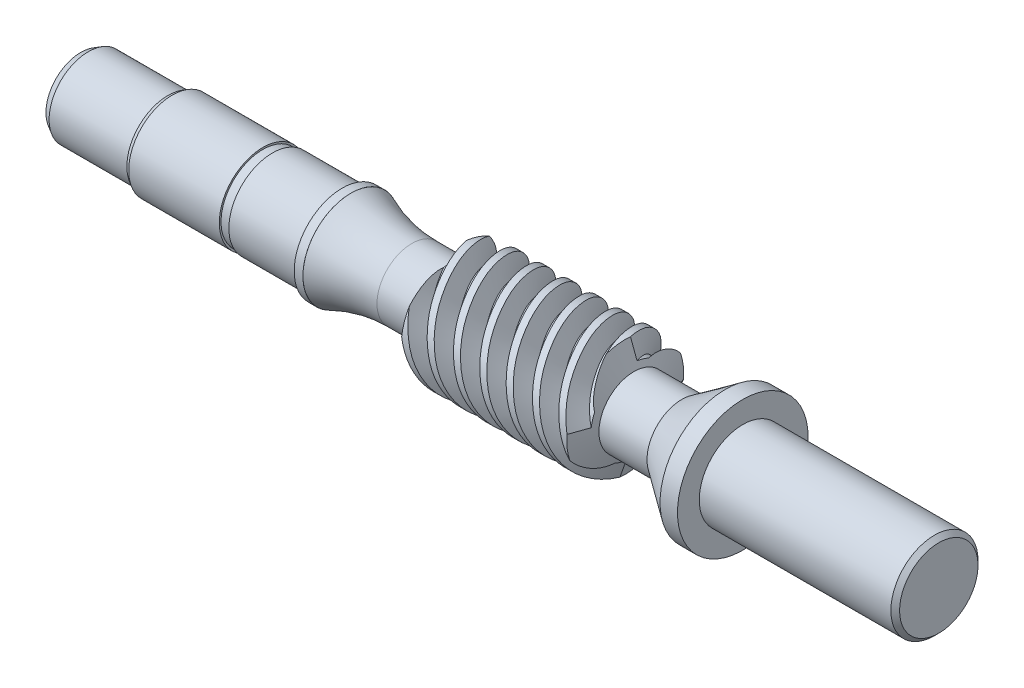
ISO-10303-21;
HEADER;
FILE_DESCRIPTION(('STEP AP214'),'2;1');
FILE_NAME('part.step','',(''),(''),'','','');
FILE_SCHEMA(('AUTOMOTIVE_DESIGN { 1 0 10303 214 1 1 1 1 }'));
ENDSEC;
DATA;
#1=APPLICATION_CONTEXT('core data for automotive mechanical design processes');
#2=APPLICATION_PROTOCOL_DEFINITION('international standard','automotive_design',2000,#1);
#3=PRODUCT_CONTEXT('',#1,'mechanical');
#4=PRODUCT('Part','Part','',(#3));
#5=PRODUCT_RELATED_PRODUCT_CATEGORY('part','',(#4));
#6=PRODUCT_DEFINITION_FORMATION('','',#4);
#7=PRODUCT_DEFINITION_CONTEXT('part definition',#1,'design');
#8=PRODUCT_DEFINITION('design','',#6,#7);
#9=PRODUCT_DEFINITION_SHAPE('','',#8);
#10=(LENGTH_UNIT() NAMED_UNIT(*) SI_UNIT(.MILLI.,.METRE.));
#11=(NAMED_UNIT(*) PLANE_ANGLE_UNIT() SI_UNIT($,.RADIAN.));
#12=(NAMED_UNIT(*) SI_UNIT($,.STERADIAN.) SOLID_ANGLE_UNIT());
#13=UNCERTAINTY_MEASURE_WITH_UNIT(LENGTH_MEASURE(1.E-05),#10,'distance_accuracy_value','');
#14=(GEOMETRIC_REPRESENTATION_CONTEXT(3) GLOBAL_UNCERTAINTY_ASSIGNED_CONTEXT((#13)) GLOBAL_UNIT_ASSIGNED_CONTEXT((#10,
#11,#12)) REPRESENTATION_CONTEXT('',''));
#15=CARTESIAN_POINT('',(0.,0.,0.));
#16=DIRECTION('',(0.,0.,1.));
#17=DIRECTION('',(1.,0.,0.));
#18=AXIS2_PLACEMENT_3D('',#15,#16,#17);
#19=CARTESIAN_POINT('',(9.50000000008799,25.07,-32.));
#20=DIRECTION('',(-1.,0.,0.));
#21=DIRECTION('',(0.,0.,1.));
#22=AXIS2_PLACEMENT_3D('',#19,#20,#21);
#23=CONICAL_SURFACE('',#22,6.70999999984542,1.22173047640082);
#24=CARTESIAN_POINT('',(10.4863593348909,25.07,-32.));
#25=DIRECTION('',(-1.,0.,0.));
#26=DIRECTION('',(0.,0.,1.));
#27=AXIS2_PLACEMENT_3D('',#24,#25,#26);
#28=CIRCLE('',#27,3.99999999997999);
#29=CARTESIAN_POINT('',(10.4863593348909,25.07,-28.00000000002));
#30=VERTEX_POINT('',#29);
#31=EDGE_CURVE('E368',#30,#30,#28,.T.);
#32=ORIENTED_EDGE('',*,*,#31,.T.);
#33=EDGE_LOOP('',(#32));
#34=FACE_BOUND('',#33,.T.);
#35=CARTESIAN_POINT('',(9.49999999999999,25.07,-32.));
#36=DIRECTION('',(1.,0.,0.));
#37=DIRECTION('',(0.,0.,-1.));
#38=AXIS2_PLACEMENT_3D('',#35,#36,#37);
#39=CIRCLE('',#38,6.71);
#40=CARTESIAN_POINT('',(9.49999999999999,18.7294258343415,-34.1957274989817));
#41=VERTEX_POINT('',#40);
#42=CARTESIAN_POINT('',(9.49999999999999,18.3872052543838,-31.3963822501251));
#43=VERTEX_POINT('',#42);
#44=EDGE_CURVE('E256',#41,#43,#39,.F.);
#45=ORIENTED_EDGE('',*,*,#44,.F.);
#46=CARTESIAN_POINT('',(9.50000000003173,18.7294258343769,-34.1957274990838));
#47=CARTESIAN_POINT('',(9.51514583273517,18.8043413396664,-34.2849024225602));
#48=CARTESIAN_POINT('',(9.53043210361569,18.8817403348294,-34.3719694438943));
#49=CARTESIAN_POINT('',(9.56126344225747,19.0412665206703,-34.54159423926));
#50=CARTESIAN_POINT('',(9.57680848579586,19.123393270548,-34.6241524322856));
#51=CARTESIAN_POINT('',(9.60813704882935,19.2921444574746,-34.7844773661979));
#52=CARTESIAN_POINT('',(9.62392055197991,19.3787685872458,-34.8622444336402));
#53=CARTESIAN_POINT('',(9.65589506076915,19.5573356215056,-35.0136307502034));
#54=CARTESIAN_POINT('',(9.67208868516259,19.6493300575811,-35.0871886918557));
#55=CARTESIAN_POINT('',(9.70466842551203,19.8373825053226,-35.2288568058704));
#56=CARTESIAN_POINT('',(9.72105453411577,19.9334403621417,-35.2969671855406));
#57=CARTESIAN_POINT('',(9.75398950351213,20.1293274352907,-35.4274978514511));
#58=CARTESIAN_POINT('',(9.7705383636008,20.2291566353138,-35.4899181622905));
#59=CARTESIAN_POINT('',(9.7973687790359,20.3931776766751,-35.5859547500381));
#60=CARTESIAN_POINT('',(9.80761214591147,20.4563045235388,-35.6214138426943));
#61=CARTESIAN_POINT('',(9.82813819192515,20.5837899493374,-35.6900446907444));
#62=CARTESIAN_POINT('',(9.83842087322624,20.6481485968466,-35.7232163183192));
#63=CARTESIAN_POINT('',(9.85901335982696,20.7780092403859,-35.7872243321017));
#64=CARTESIAN_POINT('',(9.86932316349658,20.8435111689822,-35.8180608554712));
#65=CARTESIAN_POINT('',(9.88480198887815,20.9425607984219,-35.8625262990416));
#66=CARTESIAN_POINT('',(9.88996401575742,20.9757105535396,-35.8770500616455));
#67=CARTESIAN_POINT('',(9.90028758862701,21.0422625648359,-35.9055083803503));
#68=CARTESIAN_POINT('',(9.90544913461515,21.0756648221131,-35.9194429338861));
#69=CARTESIAN_POINT('',(9.91575558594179,21.1425293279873,-35.9465914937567));
#70=CARTESIAN_POINT('',(9.92090040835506,21.1759900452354,-35.9598092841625));
#71=CARTESIAN_POINT('',(9.93126451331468,21.2432109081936,-35.9854263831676));
#72=CARTESIAN_POINT('',(9.93648379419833,21.2769710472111,-35.9978257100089));
#73=CARTESIAN_POINT('',(9.95223284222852,21.3786530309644,-36.033838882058));
#74=CARTESIAN_POINT('',(9.96285488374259,21.4469833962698,-36.0562707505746));
#75=CARTESIAN_POINT('',(9.98434558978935,21.5845547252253,-36.0978681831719));
#76=CARTESIAN_POINT('',(9.99521413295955,21.6537952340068,-36.1170353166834));
#77=CARTESIAN_POINT('',(10.0171970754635,21.7930676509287,-36.1520614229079));
#78=CARTESIAN_POINT('',(10.0283114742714,21.8630995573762,-36.1679204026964));
#79=CARTESIAN_POINT('',(10.0551100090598,22.0308899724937,-36.2017264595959));
#80=CARTESIAN_POINT('',(10.0709066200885,22.1289464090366,-36.2181281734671));
#81=CARTESIAN_POINT('',(10.1029568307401,22.3258592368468,-36.2443336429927));
#82=CARTESIAN_POINT('',(10.1192104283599,22.4247156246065,-36.2541374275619));
#83=CARTESIAN_POINT('',(10.1522860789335,22.6235207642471,-36.2670815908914));
#84=CARTESIAN_POINT('',(10.1691114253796,22.7234722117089,-36.2701726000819));
#85=CARTESIAN_POINT('',(10.2032029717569,22.9232707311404,-36.2694624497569));
#86=CARTESIAN_POINT('',(10.2204691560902,23.0231178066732,-36.2656615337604));
#87=CARTESIAN_POINT('',(10.2379496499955,23.122678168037,-36.2583733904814));
#88=B_SPLINE_CURVE_WITH_KNOTS('',3,(#46,#47,#48,#49,#50,#51,#52,#53,#54,#55,#56,#57,#58,#59,#60,
#61,#62,#63,#64,#65,#66,#67,#68,#69,#70,#71,#72,#73,#74,#75,#76,#77,#78,#79,#80,#81,#82,#83,#84,
#85,#86,#87),.UNSPECIFIED.,.F.,.F.,(4,2,2,2,2,2,2,2,2,2,2,2,2,2,2,2,2,2,2,2,4),(0.,
0.352299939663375,0.704567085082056,1.05681019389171,1.41329983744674,1.76977590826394,
2.12625043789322,2.34558441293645,2.56493063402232,2.78426396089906,2.89393338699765,
3.00360329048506,3.11262260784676,3.22163949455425,3.43965053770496,3.65755648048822,
3.87546195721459,4.17723054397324,4.47899780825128,4.78297702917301,5.08694550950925),.UNSPECIFIED.);
#89=CARTESIAN_POINT('',(10.2379496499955,23.122678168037,-36.2583733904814));
#90=VERTEX_POINT('',#89);
#91=EDGE_CURVE('E168',#41,#90,#88,.T.);
#92=ORIENTED_EDGE('',*,*,#91,.T.);
#93=CARTESIAN_POINT('',(10.2379496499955,25.07,-32.));
#94=DIRECTION('',(-1.,0.,0.));
#95=DIRECTION('',(0.,0.,1.));
#96=AXIS2_PLACEMENT_3D('',#93,#94,#95);
#97=CIRCLE('',#96,4.68250000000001);
#98=CARTESIAN_POINT('',(10.2379496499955,24.4495822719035,-36.6412162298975));
#99=VERTEX_POINT('',#98);
#100=EDGE_CURVE('E162',#90,#99,#97,.F.);
#101=ORIENTED_EDGE('',*,*,#100,.T.);
#102=CARTESIAN_POINT('',(10.2379496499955,24.4495822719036,-36.6412162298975));
#103=CARTESIAN_POINT('',(10.1694306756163,24.4429757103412,-36.8302618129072));
#104=CARTESIAN_POINT('',(10.1009482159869,24.4386287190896,-37.0193978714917));
#105=CARTESIAN_POINT('',(9.9640641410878,24.4344694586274,-37.3977491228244));
#106=CARTESIAN_POINT('',(9.89566252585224,24.4346571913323,-37.5869643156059));
#107=CARTESIAN_POINT('',(9.71808493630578,24.441055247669,-38.0784754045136));
#108=CARTESIAN_POINT('',(9.60897784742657,24.450798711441,-38.3807535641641));
#109=CARTESIAN_POINT('',(9.50000000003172,24.4663822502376,-38.6827947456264));
#110=B_SPLINE_CURVE_WITH_KNOTS('',3,(#102,#103,#104,#105,#106,#107,#108,#109),.UNSPECIFIED.,.F.,
.F.,(4,2,2,4),(0.,0.603548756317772,1.20709776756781,2.17144050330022),.UNSPECIFIED.);
#111=CARTESIAN_POINT('',(9.49999999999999,24.4663822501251,-38.6827947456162));
#112=VERTEX_POINT('',#111);
#113=EDGE_CURVE('E148',#99,#112,#110,.T.);
#114=ORIENTED_EDGE('',*,*,#113,.T.);
#115=CARTESIAN_POINT('',(9.49999999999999,27.2657274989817,-38.3405741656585));
#116=VERTEX_POINT('',#115);
#117=EDGE_CURVE('E277',#116,#112,#39,.F.);
#118=ORIENTED_EDGE('',*,*,#117,.F.);
#119=CARTESIAN_POINT('',(9.50000000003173,27.2657274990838,-38.3405741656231));
#120=CARTESIAN_POINT('',(9.51514583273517,27.3549024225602,-38.2656586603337));
#121=CARTESIAN_POINT('',(9.53043210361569,27.4419694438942,-38.1882596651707));
#122=CARTESIAN_POINT('',(9.56126344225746,27.6115942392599,-38.0287334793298));
#123=CARTESIAN_POINT('',(9.57680848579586,27.6941524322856,-37.946606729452));
#124=CARTESIAN_POINT('',(9.60813704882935,27.8544773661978,-37.7778555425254));
#125=CARTESIAN_POINT('',(9.62392055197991,27.9322444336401,-37.6912314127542));
#126=CARTESIAN_POINT('',(9.65589506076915,28.0836307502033,-37.5126643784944));
#127=CARTESIAN_POINT('',(9.67208868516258,28.1571886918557,-37.420669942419));
#128=CARTESIAN_POINT('',(9.70466842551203,28.2988568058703,-37.2326174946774));
#129=CARTESIAN_POINT('',(9.72105453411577,28.3669671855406,-37.1365596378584));
#130=CARTESIAN_POINT('',(9.75398950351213,28.497497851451,-36.9406725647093));
#131=CARTESIAN_POINT('',(9.77053836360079,28.5599181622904,-36.8408433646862));
#132=CARTESIAN_POINT('',(9.79736877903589,28.6559547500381,-36.676822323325));
#133=CARTESIAN_POINT('',(9.80761214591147,28.6914138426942,-36.6136954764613));
#134=CARTESIAN_POINT('',(9.82813819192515,28.7600446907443,-36.4862100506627));
#135=CARTESIAN_POINT('',(9.83842087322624,28.7932163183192,-36.4218514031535));
#136=CARTESIAN_POINT('',(9.85901335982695,28.8572243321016,-36.2919907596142));
#137=CARTESIAN_POINT('',(9.86932316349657,28.8880608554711,-36.2264888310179));
#138=CARTESIAN_POINT('',(9.88480198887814,28.9325262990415,-36.1274392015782));
#139=CARTESIAN_POINT('',(9.88996401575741,28.9470500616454,-36.0942894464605));
#140=CARTESIAN_POINT('',(9.90028758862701,28.9755083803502,-36.0277374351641));
#141=CARTESIAN_POINT('',(9.90544913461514,28.9894429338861,-35.9943351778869));
#142=CARTESIAN_POINT('',(9.91575558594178,29.0165914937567,-35.9274706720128));
#143=CARTESIAN_POINT('',(9.92090040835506,29.0298092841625,-35.8940099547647));
#144=CARTESIAN_POINT('',(9.93126451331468,29.0554263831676,-35.8267890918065));
#145=CARTESIAN_POINT('',(9.93648379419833,29.0678257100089,-35.793028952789));
#146=CARTESIAN_POINT('',(9.95223284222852,29.1038388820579,-35.6913469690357));
#147=CARTESIAN_POINT('',(9.96285488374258,29.1262707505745,-35.6230166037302));
#148=CARTESIAN_POINT('',(9.98434558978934,29.1678681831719,-35.4854452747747));
#149=CARTESIAN_POINT('',(9.99521413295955,29.1870353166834,-35.4162047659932));
#150=CARTESIAN_POINT('',(10.0171970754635,29.2220614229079,-35.2769323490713));
#151=CARTESIAN_POINT('',(10.0283114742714,29.2379204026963,-35.2069004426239));
#152=CARTESIAN_POINT('',(10.0551100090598,29.2717264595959,-35.0391100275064));
#153=CARTESIAN_POINT('',(10.0709066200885,29.2881281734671,-34.9410535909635));
#154=CARTESIAN_POINT('',(10.1029568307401,29.3143336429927,-34.7441407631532));
#155=CARTESIAN_POINT('',(10.1192104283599,29.3241374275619,-34.6452843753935));
#156=CARTESIAN_POINT('',(10.1522860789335,29.3370815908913,-34.446479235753));
#157=CARTESIAN_POINT('',(10.1691114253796,29.3401726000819,-34.3465277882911));
#158=CARTESIAN_POINT('',(10.2032029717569,29.3394624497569,-34.1467292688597));
#159=CARTESIAN_POINT('',(10.2204691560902,29.3356615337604,-34.0468821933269));
#160=CARTESIAN_POINT('',(10.2379496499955,29.3283733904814,-33.9473218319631));
#161=B_SPLINE_CURVE_WITH_KNOTS('',3,(#119,#120,#121,#122,#123,#124,#125,#126,#127,#128,#129,
#130,#131,#132,#133,#134,#135,#136,#137,#138,#139,#140,#141,#142,#143,#144,#145,#146,#147,#148,
#149,#150,#151,#152,#153,#154,#155,#156,#157,#158,#159,#160),.UNSPECIFIED.,.F.,.F.,(4,2,2,2,2,2,
2,2,2,2,2,2,2,2,2,2,2,2,2,2,4),(0.,0.352299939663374,0.704567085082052,1.0568101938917,
1.41329983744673,1.76977590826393,2.12625043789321,2.34558441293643,2.56493063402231,
2.78426396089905,2.89393338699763,3.00360329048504,3.11262260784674,3.22163949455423,
3.43965053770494,3.6575564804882,3.87546195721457,4.17723054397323,4.47899780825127,
4.782977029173,5.08694550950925),.UNSPECIFIED.);
#162=CARTESIAN_POINT('',(10.2379496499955,29.3283733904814,-33.9473218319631));
#163=VERTEX_POINT('',#162);
#164=EDGE_CURVE('E425',#116,#163,#161,.T.);
#165=ORIENTED_EDGE('',*,*,#164,.T.);
#166=CARTESIAN_POINT('',(10.2379496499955,25.07,-32.));
#167=DIRECTION('',(-1.,0.,0.));
#168=DIRECTION('',(0.,0.,1.));
#169=AXIS2_PLACEMENT_3D('',#166,#167,#168);
#170=CIRCLE('',#169,4.6825);
#171=CARTESIAN_POINT('',(10.2379496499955,29.7112162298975,-32.6204177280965));
#172=VERTEX_POINT('',#171);
#173=EDGE_CURVE('E510',#163,#172,#170,.F.);
#174=ORIENTED_EDGE('',*,*,#173,.T.);
#175=CARTESIAN_POINT('',(10.2379496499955,29.7112162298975,-32.6204177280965));
#176=CARTESIAN_POINT('',(10.1694306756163,29.9002618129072,-32.6270242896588));
#177=CARTESIAN_POINT('',(10.1009482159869,30.0893978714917,-32.6313712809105));
#178=CARTESIAN_POINT('',(9.96406414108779,30.4677491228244,-32.6355305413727));
#179=CARTESIAN_POINT('',(9.89566252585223,30.6569643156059,-32.6353428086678));
#180=CARTESIAN_POINT('',(9.71808493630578,31.1484754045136,-32.6289447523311));
#181=CARTESIAN_POINT('',(9.60897784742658,31.4507535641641,-32.6192012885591));
#182=CARTESIAN_POINT('',(9.50000000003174,31.7527947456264,-32.6036177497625));
#183=B_SPLINE_CURVE_WITH_KNOTS('',3,(#175,#176,#177,#178,#179,#180,#181,#182),.UNSPECIFIED.,.F.,
.F.,(4,2,2,4),(0.,0.60354875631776,1.20709776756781,2.17144050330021),.UNSPECIFIED.);
#184=CARTESIAN_POINT('',(9.49999999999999,31.7527947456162,-32.603617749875));
#185=VERTEX_POINT('',#184);
#186=EDGE_CURVE('E415',#172,#185,#183,.T.);
#187=ORIENTED_EDGE('',*,*,#186,.T.);
#188=CARTESIAN_POINT('',(9.49999999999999,31.4105741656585,-29.8042725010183));
#189=VERTEX_POINT('',#188);
#190=EDGE_CURVE('E294',#189,#185,#39,.F.);
#191=ORIENTED_EDGE('',*,*,#190,.F.);
#192=CARTESIAN_POINT('',(9.50000000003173,31.4105741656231,-29.8042725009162));
#193=CARTESIAN_POINT('',(9.51514583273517,31.3356586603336,-29.7150975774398));
#194=CARTESIAN_POINT('',(9.53043210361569,31.2582596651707,-29.6280305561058));
#195=CARTESIAN_POINT('',(9.56126344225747,31.0987334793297,-29.4584057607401));
#196=CARTESIAN_POINT('',(9.57680848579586,31.016606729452,-29.3758475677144));
#197=CARTESIAN_POINT('',(9.60813704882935,30.8478555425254,-29.2155226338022));
#198=CARTESIAN_POINT('',(9.62392055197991,30.7612314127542,-29.1377555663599));
#199=CARTESIAN_POINT('',(9.65589506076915,30.5826643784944,-28.9863692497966));
#200=CARTESIAN_POINT('',(9.67208868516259,30.490669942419,-28.9128113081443));
#201=CARTESIAN_POINT('',(9.70466842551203,30.3026174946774,-28.7711431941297));
#202=CARTESIAN_POINT('',(9.72105453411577,30.2065596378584,-28.7030328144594));
#203=CARTESIAN_POINT('',(9.75398950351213,30.0106725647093,-28.572502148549));
#204=CARTESIAN_POINT('',(9.7705383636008,29.9108433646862,-28.5100818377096));
#205=CARTESIAN_POINT('',(9.7973687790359,29.746822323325,-28.4140452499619));
#206=CARTESIAN_POINT('',(9.80761214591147,29.6836954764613,-28.3785861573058));
#207=CARTESIAN_POINT('',(9.82813819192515,29.5562100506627,-28.3099553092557));
#208=CARTESIAN_POINT('',(9.83842087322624,29.4918514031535,-28.2767836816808));
#209=CARTESIAN_POINT('',(9.85901335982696,29.3619907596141,-28.2127756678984));
#210=CARTESIAN_POINT('',(9.86932316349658,29.2964888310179,-28.1819391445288));
#211=CARTESIAN_POINT('',(9.88480198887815,29.1974392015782,-28.1374737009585));
#212=CARTESIAN_POINT('',(9.88996401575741,29.1642894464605,-28.1229499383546));
#213=CARTESIAN_POINT('',(9.90028758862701,29.0977374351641,-28.0944916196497));
#214=CARTESIAN_POINT('',(9.90544913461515,29.0643351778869,-28.0805570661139));
#215=CARTESIAN_POINT('',(9.91575558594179,28.9974706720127,-28.0534085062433));
#216=CARTESIAN_POINT('',(9.92090040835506,28.9640099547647,-28.0401907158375));
#217=CARTESIAN_POINT('',(9.93126451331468,28.8967890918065,-28.0145736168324));
#218=CARTESIAN_POINT('',(9.93648379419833,28.8630289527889,-28.0021742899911));
#219=CARTESIAN_POINT('',(9.95223284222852,28.7613469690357,-27.966161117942));
#220=CARTESIAN_POINT('',(9.96285488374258,28.6930166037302,-27.9437292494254));
#221=CARTESIAN_POINT('',(9.98434558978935,28.5554452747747,-27.9021318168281));
#222=CARTESIAN_POINT('',(9.99521413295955,28.4862047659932,-27.8829646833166));
#223=CARTESIAN_POINT('',(10.0171970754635,28.3469323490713,-27.8479385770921));
#224=CARTESIAN_POINT('',(10.0283114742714,28.2769004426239,-27.8320795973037));
#225=CARTESIAN_POINT('',(10.0551100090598,28.1091100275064,-27.7982735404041));
#226=CARTESIAN_POINT('',(10.0709066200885,28.0110535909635,-27.7818718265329));
#227=CARTESIAN_POINT('',(10.1029568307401,27.8141407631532,-27.7556663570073));
#228=CARTESIAN_POINT('',(10.1192104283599,27.7152843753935,-27.7458625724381));
#229=CARTESIAN_POINT('',(10.1522860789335,27.5164792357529,-27.7329184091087));
#230=CARTESIAN_POINT('',(10.1691114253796,27.4165277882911,-27.7298273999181));
#231=CARTESIAN_POINT('',(10.2032029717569,27.2167292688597,-27.7305375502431));
#232=CARTESIAN_POINT('',(10.2204691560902,27.1168821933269,-27.7343384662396));
#233=CARTESIAN_POINT('',(10.2379496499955,27.0173218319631,-27.7416266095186));
#234=B_SPLINE_CURVE_WITH_KNOTS('',3,(#192,#193,#194,#195,#196,#197,#198,#199,#200,#201,#202,
#203,#204,#205,#206,#207,#208,#209,#210,#211,#212,#213,#214,#215,#216,#217,#218,#219,#220,#221,
#222,#223,#224,#225,#226,#227,#228,#229,#230,#231,#232,#233),.UNSPECIFIED.,.F.,.F.,(4,2,2,2,2,2,
2,2,2,2,2,2,2,2,2,2,2,2,2,2,4),(0.,0.352299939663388,0.704567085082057,1.05681019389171,
1.41329983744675,1.76977590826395,2.12625043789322,2.34558441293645,2.56493063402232,
2.78426396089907,2.89393338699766,3.00360329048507,3.11262260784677,3.22163949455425,
3.43965053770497,3.65755648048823,3.8754619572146,4.17723054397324,4.47899780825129,
4.78297702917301,5.08694550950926),.UNSPECIFIED.);
#235=CARTESIAN_POINT('',(10.2379496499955,27.0173218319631,-27.7416266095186));
#236=VERTEX_POINT('',#235);
#237=EDGE_CURVE('E443',#189,#236,#234,.T.);
#238=ORIENTED_EDGE('',*,*,#237,.T.);
#239=CARTESIAN_POINT('',(10.2379496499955,25.07,-32.));
#240=DIRECTION('',(-1.,0.,0.));
#241=DIRECTION('',(0.,0.,1.));
#242=AXIS2_PLACEMENT_3D('',#239,#240,#241);
#243=CIRCLE('',#242,4.6825);
#244=CARTESIAN_POINT('',(10.2379496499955,25.6904177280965,-27.3587837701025));
#245=VERTEX_POINT('',#244);
#246=EDGE_CURVE('E556',#236,#245,#243,.F.);
#247=ORIENTED_EDGE('',*,*,#246,.T.);
#248=CARTESIAN_POINT('',(10.2379496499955,25.6904177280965,-27.3587837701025));
#249=CARTESIAN_POINT('',(10.1694306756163,25.6970242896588,-27.1697381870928));
#250=CARTESIAN_POINT('',(10.1009482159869,25.7013712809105,-26.9806021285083));
#251=CARTESIAN_POINT('',(9.96406414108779,25.7055305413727,-26.6022508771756));
#252=CARTESIAN_POINT('',(9.89566252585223,25.7053428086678,-26.4130356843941));
#253=CARTESIAN_POINT('',(9.71808493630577,25.6989447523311,-25.9215245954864));
#254=CARTESIAN_POINT('',(9.60897784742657,25.6892012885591,-25.6192464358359));
#255=CARTESIAN_POINT('',(9.50000000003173,25.6736177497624,-25.3172052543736));
#256=B_SPLINE_CURVE_WITH_KNOTS('',3,(#248,#249,#250,#251,#252,#253,#254,#255),.UNSPECIFIED.,.F.,
.F.,(4,2,2,4),(0.,0.603548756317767,1.2070977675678,2.17144050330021),.UNSPECIFIED.);
#257=CARTESIAN_POINT('',(9.49999999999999,25.673617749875,-25.3172052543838));
#258=VERTEX_POINT('',#257);
#259=EDGE_CURVE('E434',#245,#258,#256,.T.);
#260=ORIENTED_EDGE('',*,*,#259,.T.);
#261=CARTESIAN_POINT('',(9.49999999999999,22.8742725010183,-25.6594258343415));
#262=VERTEX_POINT('',#261);
#263=EDGE_CURVE('E278',#262,#258,#39,.F.);
#264=ORIENTED_EDGE('',*,*,#263,.F.);
#265=CARTESIAN_POINT('',(9.50000000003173,22.8742725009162,-25.6594258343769));
#266=CARTESIAN_POINT('',(9.51514583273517,22.7850975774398,-25.7343413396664));
#267=CARTESIAN_POINT('',(9.53043210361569,22.6980305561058,-25.8117403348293));
#268=CARTESIAN_POINT('',(9.56126344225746,22.5284057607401,-25.9712665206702));
#269=CARTESIAN_POINT('',(9.57680848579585,22.4458475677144,-26.053393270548));
#270=CARTESIAN_POINT('',(9.60813704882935,22.2855226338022,-26.2221444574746));
#271=CARTESIAN_POINT('',(9.62392055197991,22.2077555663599,-26.3087685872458));
#272=CARTESIAN_POINT('',(9.65589506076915,22.0563692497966,-26.4873356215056));
#273=CARTESIAN_POINT('',(9.67208868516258,21.9828113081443,-26.579330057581));
#274=CARTESIAN_POINT('',(9.70466842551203,21.8411431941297,-26.7673825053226));
#275=CARTESIAN_POINT('',(9.72105453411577,21.7730328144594,-26.8634403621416));
#276=CARTESIAN_POINT('',(9.75398950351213,21.642502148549,-27.0593274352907));
#277=CARTESIAN_POINT('',(9.77053836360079,21.5800818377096,-27.1591566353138));
#278=CARTESIAN_POINT('',(9.79736877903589,21.4840452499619,-27.323177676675));
#279=CARTESIAN_POINT('',(9.80761214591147,21.4485861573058,-27.3863045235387));
#280=CARTESIAN_POINT('',(9.82813819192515,21.3799553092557,-27.5137899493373));
#281=CARTESIAN_POINT('',(9.83842087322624,21.3467836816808,-27.5781485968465));
#282=CARTESIAN_POINT('',(9.85901335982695,21.2827756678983,-27.7080092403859));
#283=CARTESIAN_POINT('',(9.86932316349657,21.2519391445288,-27.7735111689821));
#284=CARTESIAN_POINT('',(9.88480198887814,21.2074737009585,-27.8725607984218));
#285=CARTESIAN_POINT('',(9.88996401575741,21.1929499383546,-27.9057105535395));
#286=CARTESIAN_POINT('',(9.90028758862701,21.1644916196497,-27.9722625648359));
#287=CARTESIAN_POINT('',(9.90544913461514,21.1505570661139,-28.0056648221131));
#288=CARTESIAN_POINT('',(9.91575558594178,21.1234085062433,-28.0725293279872));
#289=CARTESIAN_POINT('',(9.92090040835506,21.1101907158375,-28.1059900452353));
#290=CARTESIAN_POINT('',(9.93126451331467,21.0845736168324,-28.1732109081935));
#291=CARTESIAN_POINT('',(9.93648379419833,21.0721742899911,-28.2069710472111));
#292=CARTESIAN_POINT('',(9.95223284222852,21.036161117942,-28.3086530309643));
#293=CARTESIAN_POINT('',(9.96285488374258,21.0137292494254,-28.3769833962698));
#294=CARTESIAN_POINT('',(9.98434558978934,20.9721318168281,-28.5145547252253));
#295=CARTESIAN_POINT('',(9.99521413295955,20.9529646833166,-28.5837952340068));
#296=CARTESIAN_POINT('',(10.0171970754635,20.9179385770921,-28.7230676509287));
#297=CARTESIAN_POINT('',(10.0283114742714,20.9020795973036,-28.7930995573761));
#298=CARTESIAN_POINT('',(10.0551100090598,20.8682735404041,-28.9608899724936));
#299=CARTESIAN_POINT('',(10.0709066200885,20.8518718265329,-29.0589464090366));
#300=CARTESIAN_POINT('',(10.1029568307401,20.8256663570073,-29.2558592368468));
#301=CARTESIAN_POINT('',(10.1192104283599,20.8158625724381,-29.3547156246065));
#302=CARTESIAN_POINT('',(10.1522860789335,20.8029184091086,-29.5535207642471));
#303=CARTESIAN_POINT('',(10.1691114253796,20.7998273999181,-29.6534722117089));
#304=CARTESIAN_POINT('',(10.2032029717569,20.8005375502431,-29.8532707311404));
#305=CARTESIAN_POINT('',(10.2204691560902,20.8043384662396,-29.9531178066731));
#306=CARTESIAN_POINT('',(10.2379496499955,20.8116266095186,-30.052678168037));
#307=B_SPLINE_CURVE_WITH_KNOTS('',3,(#265,#266,#267,#268,#269,#270,#271,#272,#273,#274,#275,
#276,#277,#278,#279,#280,#281,#282,#283,#284,#285,#286,#287,#288,#289,#290,#291,#292,#293,#294,
#295,#296,#297,#298,#299,#300,#301,#302,#303,#304,#305,#306),.UNSPECIFIED.,.F.,.F.,(4,2,2,2,2,2,
2,2,2,2,2,2,2,2,2,2,2,2,2,2,4),(0.,0.352299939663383,0.704567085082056,1.05681019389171,
1.41329983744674,1.76977590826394,2.12625043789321,2.34558441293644,2.56493063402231,
2.78426396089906,2.89393338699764,3.00360329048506,3.11262260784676,3.22163949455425,
3.43965053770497,3.65755648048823,3.8754619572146,4.17723054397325,4.4789978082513,
4.78297702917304,5.08694550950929),.UNSPECIFIED.);
#308=CARTESIAN_POINT('',(10.2379496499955,20.8116266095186,-30.052678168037));
#309=VERTEX_POINT('',#308);
#310=EDGE_CURVE('E210',#262,#309,#307,.T.);
#311=ORIENTED_EDGE('',*,*,#310,.T.);
#312=CARTESIAN_POINT('',(10.2379496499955,25.07,-32.));
#313=DIRECTION('',(-1.,0.,0.));
#314=DIRECTION('',(0.,0.,1.));
#315=AXIS2_PLACEMENT_3D('',#312,#313,#314);
#316=CIRCLE('',#315,4.6825);
#317=CARTESIAN_POINT('',(10.2379496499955,20.4287837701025,-31.3795822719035));
#318=VERTEX_POINT('',#317);
#319=EDGE_CURVE('E258',#309,#318,#316,.F.);
#320=ORIENTED_EDGE('',*,*,#319,.T.);
#321=CARTESIAN_POINT('',(10.2379496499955,20.4287837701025,-31.3795822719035));
#322=CARTESIAN_POINT('',(10.1694306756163,20.2397381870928,-31.3729757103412));
#323=CARTESIAN_POINT('',(10.1009482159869,20.0506021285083,-31.3686287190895));
#324=CARTESIAN_POINT('',(9.96406414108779,19.6722508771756,-31.3644694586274));
#325=CARTESIAN_POINT('',(9.89566252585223,19.4830356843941,-31.3646571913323));
#326=CARTESIAN_POINT('',(9.71808493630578,18.9915245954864,-31.3710552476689));
#327=CARTESIAN_POINT('',(9.60897784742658,18.6892464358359,-31.3807987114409));
#328=CARTESIAN_POINT('',(9.50000000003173,18.3872052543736,-31.3963822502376));
#329=B_SPLINE_CURVE_WITH_KNOTS('',3,(#321,#322,#323,#324,#325,#326,#327,#328),.UNSPECIFIED.,.F.,
.F.,(4,2,2,4),(0.,0.603548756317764,1.2070977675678,2.17144050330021),.UNSPECIFIED.);
#330=EDGE_CURVE('E197',#318,#43,#329,.T.);
#331=ORIENTED_EDGE('',*,*,#330,.T.);
#332=EDGE_LOOP('',(#45,#92,#101,#114,#118,#165,#174,#187,#191,#238,#247,#260,#264,#311,#320,#331));
#333=FACE_BOUND('',#332,.T.);
#334=ADVANCED_FACE('F34',(#34,#333),#23,.T.);
#335=CARTESIAN_POINT('',(-9.50000000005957,25.07,-32.));
#336=DIRECTION('',(1.,0.,0.));
#337=DIRECTION('',(0.,0.,-1.));
#338=AXIS2_PLACEMENT_3D('',#335,#336,#337);
#339=CONICAL_SURFACE('',#338,6.70999999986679,1.2217304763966);
#340=CARTESIAN_POINT('',(-10.4863593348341,25.07,-32.));
#341=DIRECTION('',(1.,0.,0.));
#342=DIRECTION('',(0.,0.,-1.));
#343=AXIS2_PLACEMENT_3D('',#340,#341,#342);
#344=CIRCLE('',#343,4.00000000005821);
#345=CARTESIAN_POINT('',(-10.4863593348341,25.07,-36.0000000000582));
#346=VERTEX_POINT('',#345);
#347=EDGE_CURVE('E365',#346,#346,#344,.T.);
#348=ORIENTED_EDGE('',*,*,#347,.T.);
#349=EDGE_LOOP('',(#348));
#350=FACE_BOUND('',#349,.T.);
#351=CARTESIAN_POINT('',(-10.2379496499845,25.07,-32.));
#352=DIRECTION('',(1.,0.,0.));
#353=DIRECTION('',(0.,0.,-1.));
#354=AXIS2_PLACEMENT_3D('',#351,#352,#353);
#355=CIRCLE('',#354,4.68250000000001);
#356=CARTESIAN_POINT('',(-10.2379496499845,29.6287351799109,-30.9305422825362));
#357=VERTEX_POINT('',#356);
#358=CARTESIAN_POINT('',(-10.2379496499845,29.7387139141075,-32.359049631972));
#359=VERTEX_POINT('',#358);
#360=EDGE_CURVE('E11',#357,#359,#355,.F.);
#361=ORIENTED_EDGE('',*,*,#360,.T.);
#362=CARTESIAN_POINT('',(-10.2379496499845,29.7387139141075,-32.359049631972));
#363=CARTESIAN_POINT('',(-10.16944058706,29.9249452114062,-32.3922347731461));
#364=CARTESIAN_POINT('',(-10.1009672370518,30.1107944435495,-32.4276188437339));
#365=CARTESIAN_POINT('',(-9.96409773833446,30.4816406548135,-32.5027349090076));
#366=CARTESIAN_POINT('',(-9.89570158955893,30.6666376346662,-32.5424668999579));
#367=CARTESIAN_POINT('',(-9.71812157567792,31.1460236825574,-32.6512703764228));
#368=CARTESIAN_POINT('',(-9.60900206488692,31.439682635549,-32.7236800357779));
#369=CARTESIAN_POINT('',(-9.50000000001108,31.7319619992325,-32.8014750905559));
#370=B_SPLINE_CURVE_WITH_KNOTS('',3,(#362,#363,#364,#365,#366,#367,#368,#369),.UNSPECIFIED.,.F.,
.F.,(4,2,2,4),(0.,0.603547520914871,1.20709452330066,2.17151365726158),.UNSPECIFIED.);
#371=CARTESIAN_POINT('',(-9.50000000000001,31.7319619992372,-32.8014750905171));
#372=VERTEX_POINT('',#371);
#373=EDGE_CURVE('E157',#359,#372,#370,.T.);
#374=ORIENTED_EDGE('',*,*,#373,.T.);
#375=CARTESIAN_POINT('',(-9.50000000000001,25.07,-32.));
#376=DIRECTION('',(1.,0.,0.));
#377=DIRECTION('',(0.,0.,-1.));
#378=AXIS2_PLACEMENT_3D('',#375,#376,#377);
#379=CIRCLE('',#378,6.71);
#380=CARTESIAN_POINT('',(-9.50000000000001,30.8539725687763,-35.4014351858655));
#381=VERTEX_POINT('',#380);
#382=EDGE_CURVE('E302',#381,#372,#379,.T.);
#383=ORIENTED_EDGE('',*,*,#382,.F.);
#384=CARTESIAN_POINT('',(-9.50000000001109,30.853972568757,-35.4014351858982));
#385=CARTESIAN_POINT('',(-9.51607595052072,30.7569054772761,-35.4793663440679));
#386=CARTESIAN_POINT('',(-9.5322391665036,30.657655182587,-35.5545558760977));
#387=CARTESIAN_POINT('',(-9.56475497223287,30.4547841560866,-35.6994375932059));
#388=CARTESIAN_POINT('',(-9.58110798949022,30.3511510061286,-35.7691122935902));
#389=CARTESIAN_POINT('',(-9.61394229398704,30.1399610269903,-35.9025634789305));
#390=CARTESIAN_POINT('',(-9.63042372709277,30.0323989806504,-35.9663316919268));
#391=CARTESIAN_POINT('',(-9.65522470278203,29.86826616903,-36.0574290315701));
#392=CARTESIAN_POINT('',(-9.66352182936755,29.812974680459,-36.0870914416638));
#393=CARTESIAN_POINT('',(-9.68012580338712,29.7015639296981,-36.1448285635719));
#394=CARTESIAN_POINT('',(-9.68843265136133,29.6454446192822,-36.1729031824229));
#395=CARTESIAN_POINT('',(-9.70504712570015,29.5324687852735,-36.2274031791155));
#396=CARTESIAN_POINT('',(-9.71335474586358,29.4756129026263,-36.2538298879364));
#397=CARTESIAN_POINT('',(-9.72580302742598,29.3897940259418,-36.2922717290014));
#398=CARTESIAN_POINT('',(-9.72995015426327,29.3610993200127,-36.3048856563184));
#399=CARTESIAN_POINT('',(-9.73828702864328,29.3034860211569,-36.3295783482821));
#400=CARTESIAN_POINT('',(-9.74247677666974,29.2745674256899,-36.3416571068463));
#401=CARTESIAN_POINT('',(-9.75509998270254,29.1875398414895,-36.3770717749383));
#402=CARTESIAN_POINT('',(-9.76359430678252,29.1291112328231,-36.3996076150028));
#403=CARTESIAN_POINT('',(-9.78074434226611,29.0114806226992,-36.4424986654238));
#404=CARTESIAN_POINT('',(-9.78940007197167,28.9522785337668,-36.4628536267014));
#405=CARTESIAN_POINT('',(-9.81756386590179,28.7602828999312,-36.5249018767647));
#406=CARTESIAN_POINT('',(-9.83739004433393,28.6260901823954,-36.5622253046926));
#407=CARTESIAN_POINT('',(-9.87780936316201,28.3551483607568,-36.6255172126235));
#408=CARTESIAN_POINT('',(-9.89840269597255,28.2183986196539,-36.6514828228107));
#409=CARTESIAN_POINT('',(-9.94023441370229,27.9439174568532,-36.691649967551));
#410=CARTESIAN_POINT('',(-9.96146942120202,27.8061933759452,-36.7059047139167));
#411=CARTESIAN_POINT('',(-10.0046405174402,27.5301431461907,-36.7226147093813));
#412=CARTESIAN_POINT('',(-10.0265766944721,27.3918169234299,-36.7250684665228));
#413=CARTESIAN_POINT('',(-10.0791498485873,27.0657525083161,-36.716718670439));
#414=CARTESIAN_POINT('',(-10.1100763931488,26.8781516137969,-36.7008249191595));
#415=CARTESIAN_POINT('',(-10.1573461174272,26.5991035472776,-36.6602196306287));
#416=CARTESIAN_POINT('',(-10.1732821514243,26.5062962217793,-36.6438406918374));
#417=CARTESIAN_POINT('',(-10.2054193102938,26.3218941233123,-36.6054835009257));
#418=CARTESIAN_POINT('',(-10.2216204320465,26.2302993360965,-36.5835053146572));
#419=CARTESIAN_POINT('',(-10.2379496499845,26.1394577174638,-36.5587351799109));
#420=B_SPLINE_CURVE_WITH_KNOTS('',3,(#384,#385,#386,#387,#388,#389,#390,#391,#392,#393,#394,
#395,#396,#397,#398,#399,#400,#401,#402,#403,#404,#405,#406,#407,#408,#409,#410,#411,#412,#413,
#414,#415,#416,#417,#418,#419),.UNSPECIFIED.,.F.,.F.,(4,2,2,2,2,2,2,2,2,2,2,2,2,2,2,2,2,4),(0.,
0.376487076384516,0.75412359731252,1.13228124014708,1.32213579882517,1.51200146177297,
1.70171173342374,1.79656187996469,1.89141310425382,2.08095694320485,2.2705224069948,
2.6920671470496,3.11371833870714,3.53344286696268,3.95322045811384,4.52410567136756,
4.81069868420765,5.09728832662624),.UNSPECIFIED.);
#421=CARTESIAN_POINT('',(-10.2379496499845,26.1394577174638,-36.5587351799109));
#422=VERTEX_POINT('',#421);
#423=EDGE_CURVE('E57',#381,#422,#420,.T.);
#424=ORIENTED_EDGE('',*,*,#423,.T.);
#425=CARTESIAN_POINT('',(-10.2379496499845,25.07,-32.));
#426=DIRECTION('',(1.,0.,0.));
#427=DIRECTION('',(0.,0.,-1.));
#428=AXIS2_PLACEMENT_3D('',#425,#426,#427);
#429=CIRCLE('',#428,4.6825);
#430=CARTESIAN_POINT('',(-10.2379496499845,24.710950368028,-36.6687139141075));
#431=VERTEX_POINT('',#430);
#432=EDGE_CURVE('E263',#422,#431,#429,.F.);
#433=ORIENTED_EDGE('',*,*,#432,.T.);
#434=CARTESIAN_POINT('',(-10.2379496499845,24.710950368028,-36.6687139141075));
#435=CARTESIAN_POINT('',(-10.1694405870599,24.6777652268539,-36.8549452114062));
#436=CARTESIAN_POINT('',(-10.1009672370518,24.642381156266,-37.0407944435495));
#437=CARTESIAN_POINT('',(-9.96409773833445,24.5672650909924,-37.4116406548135));
#438=CARTESIAN_POINT('',(-9.89570158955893,24.5275331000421,-37.5966376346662));
#439=CARTESIAN_POINT('',(-9.71812157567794,24.4187296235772,-38.0760236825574));
#440=CARTESIAN_POINT('',(-9.60900206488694,24.346319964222,-38.369682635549));
#441=CARTESIAN_POINT('',(-9.50000000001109,24.2685249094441,-38.6619619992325));
#442=B_SPLINE_CURVE_WITH_KNOTS('',3,(#434,#435,#436,#437,#438,#439,#440,#441),.UNSPECIFIED.,.F.,
.F.,(4,2,2,4),(0.,0.603547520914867,1.20709452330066,2.17151365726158),.UNSPECIFIED.);
#443=CARTESIAN_POINT('',(-9.50000000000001,24.2685249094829,-38.6619619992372));
#444=VERTEX_POINT('',#443);
#445=EDGE_CURVE('E203',#431,#444,#442,.T.);
#446=ORIENTED_EDGE('',*,*,#445,.T.);
#447=CARTESIAN_POINT('',(-9.50000000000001,21.6685648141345,-37.7839725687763));
#448=VERTEX_POINT('',#447);
#449=EDGE_CURVE('E304',#448,#444,#379,.T.);
#450=ORIENTED_EDGE('',*,*,#449,.F.);
#451=CARTESIAN_POINT('',(-9.50000000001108,21.6685648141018,-37.783972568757));
#452=CARTESIAN_POINT('',(-9.51607595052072,21.5906336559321,-37.6869054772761));
#453=CARTESIAN_POINT('',(-9.5322391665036,21.5154441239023,-37.587655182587));
#454=CARTESIAN_POINT('',(-9.56475497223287,21.3705624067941,-37.3847841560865));
#455=CARTESIAN_POINT('',(-9.58110798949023,21.3008877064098,-37.2811510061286));
#456=CARTESIAN_POINT('',(-9.61394229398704,21.1674365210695,-37.0699610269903));
#457=CARTESIAN_POINT('',(-9.63042372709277,21.1036683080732,-36.9623989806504));
#458=CARTESIAN_POINT('',(-9.65522470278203,21.0125709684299,-36.79826616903));
#459=CARTESIAN_POINT('',(-9.66352182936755,20.9829085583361,-36.742974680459));
#460=CARTESIAN_POINT('',(-9.68012580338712,20.9251714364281,-36.6315639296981));
#461=CARTESIAN_POINT('',(-9.68843265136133,20.8970968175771,-36.5754446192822));
#462=CARTESIAN_POINT('',(-9.70504712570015,20.8425968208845,-36.4624687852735));
#463=CARTESIAN_POINT('',(-9.71335474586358,20.8161701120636,-36.4056129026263));
#464=CARTESIAN_POINT('',(-9.72580302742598,20.7777282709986,-36.3197940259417));
#465=CARTESIAN_POINT('',(-9.72995015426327,20.7651143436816,-36.2910993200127));
#466=CARTESIAN_POINT('',(-9.73828702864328,20.7404216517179,-36.2334860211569));
#467=CARTESIAN_POINT('',(-9.74247677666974,20.7283428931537,-36.2045674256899));
#468=CARTESIAN_POINT('',(-9.75509998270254,20.6929282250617,-36.1175398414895));
#469=CARTESIAN_POINT('',(-9.76359430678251,20.6703923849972,-36.0591112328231));
#470=CARTESIAN_POINT('',(-9.78074434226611,20.6275013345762,-35.9414806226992));
#471=CARTESIAN_POINT('',(-9.78940007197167,20.6071463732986,-35.8822785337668));
#472=CARTESIAN_POINT('',(-9.81756386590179,20.5450981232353,-35.6902828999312));
#473=CARTESIAN_POINT('',(-9.83739004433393,20.5077746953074,-35.5560901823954));
#474=CARTESIAN_POINT('',(-9.87780936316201,20.4444827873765,-35.2851483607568));
#475=CARTESIAN_POINT('',(-9.89840269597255,20.4185171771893,-35.1483986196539));
#476=CARTESIAN_POINT('',(-9.9402344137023,20.378350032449,-34.8739174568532));
#477=CARTESIAN_POINT('',(-9.96146942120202,20.3640952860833,-34.7361933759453));
#478=CARTESIAN_POINT('',(-10.0046405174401,20.3473852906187,-34.4601431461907));
#479=CARTESIAN_POINT('',(-10.026576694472,20.3449315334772,-34.32181692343));
#480=CARTESIAN_POINT('',(-10.0791498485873,20.353281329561,-33.9957525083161));
#481=CARTESIAN_POINT('',(-10.1100763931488,20.3691750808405,-33.8081516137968));
#482=CARTESIAN_POINT('',(-10.1573461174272,20.4097803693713,-33.5291035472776));
#483=CARTESIAN_POINT('',(-10.1732821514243,20.4261593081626,-33.4362962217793));
#484=CARTESIAN_POINT('',(-10.2054193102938,20.4645164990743,-33.2518941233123));
#485=CARTESIAN_POINT('',(-10.2216204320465,20.4864946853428,-33.1602993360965));
#486=CARTESIAN_POINT('',(-10.2379496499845,20.5112648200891,-33.0694577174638));
#487=B_SPLINE_CURVE_WITH_KNOTS('',3,(#451,#452,#453,#454,#455,#456,#457,#458,#459,#460,#461,
#462,#463,#464,#465,#466,#467,#468,#469,#470,#471,#472,#473,#474,#475,#476,#477,#478,#479,#480,
#481,#482,#483,#484,#485,#486),.UNSPECIFIED.,.F.,.F.,(4,2,2,2,2,2,2,2,2,2,2,2,2,2,2,2,2,4),(0.,
0.376487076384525,0.754123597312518,1.13228124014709,1.32213579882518,1.51200146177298,
1.70171173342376,1.79656187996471,1.89141310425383,2.08095694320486,2.27052240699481,
2.69206714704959,3.11371833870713,3.53344286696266,3.95322045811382,4.52410567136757,
4.81069868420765,5.09728832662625),.UNSPECIFIED.);
#488=CARTESIAN_POINT('',(-10.2379496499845,20.5112648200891,-33.0694577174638));
#489=VERTEX_POINT('',#488);
#490=EDGE_CURVE('E575',#448,#489,#487,.T.);
#491=ORIENTED_EDGE('',*,*,#490,.T.);
#492=CARTESIAN_POINT('',(-10.2379496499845,25.07,-32.));
#493=DIRECTION('',(1.,0.,0.));
#494=DIRECTION('',(0.,0.,-1.));
#495=AXIS2_PLACEMENT_3D('',#492,#493,#494);
#496=CIRCLE('',#495,4.6825);
#497=CARTESIAN_POINT('',(-10.2379496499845,20.4012860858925,-31.640950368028));
#498=VERTEX_POINT('',#497);
#499=EDGE_CURVE('E300',#489,#498,#496,.F.);
#500=ORIENTED_EDGE('',*,*,#499,.T.);
#501=CARTESIAN_POINT('',(-10.2379496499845,20.4012860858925,-31.640950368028));
#502=CARTESIAN_POINT('',(-10.16944058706,20.2150547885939,-31.6077652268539));
#503=CARTESIAN_POINT('',(-10.1009672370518,20.0292055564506,-31.572381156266));
#504=CARTESIAN_POINT('',(-9.96409773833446,19.6583593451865,-31.4972650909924));
#505=CARTESIAN_POINT('',(-9.89570158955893,19.4733623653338,-31.4575331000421));
#506=CARTESIAN_POINT('',(-9.71812157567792,18.9939763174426,-31.3487296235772));
#507=CARTESIAN_POINT('',(-9.60900206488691,18.700317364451,-31.276319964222));
#508=CARTESIAN_POINT('',(-9.50000000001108,18.4080380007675,-31.198524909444));
#509=B_SPLINE_CURVE_WITH_KNOTS('',3,(#501,#502,#503,#504,#505,#506,#507,#508),.UNSPECIFIED.,.F.,
.F.,(4,2,2,4),(0.,0.603547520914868,1.20709452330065,2.1715136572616),.UNSPECIFIED.);
#510=CARTESIAN_POINT('',(-9.50000000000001,18.4080380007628,-31.1985249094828));
#511=VERTEX_POINT('',#510);
#512=EDGE_CURVE('E574',#498,#511,#509,.T.);
#513=ORIENTED_EDGE('',*,*,#512,.T.);
#514=CARTESIAN_POINT('',(-9.50000000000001,19.2860274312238,-28.5985648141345));
#515=VERTEX_POINT('',#514);
#516=EDGE_CURVE('E358',#515,#511,#379,.T.);
#517=ORIENTED_EDGE('',*,*,#516,.F.);
#518=CARTESIAN_POINT('',(-9.50000000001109,19.286027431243,-28.5985648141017));
#519=CARTESIAN_POINT('',(-9.51607595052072,19.383094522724,-28.5206336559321));
#520=CARTESIAN_POINT('',(-9.5322391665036,19.482344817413,-28.4454441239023));
#521=CARTESIAN_POINT('',(-9.56475497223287,19.6852158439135,-28.3005624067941));
#522=CARTESIAN_POINT('',(-9.58110798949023,19.7888489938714,-28.2308877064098));
#523=CARTESIAN_POINT('',(-9.61394229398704,20.0000389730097,-28.0974365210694));
#524=CARTESIAN_POINT('',(-9.63042372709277,20.1076010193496,-28.0336683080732));
#525=CARTESIAN_POINT('',(-9.65522470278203,20.2717338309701,-27.9425709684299));
#526=CARTESIAN_POINT('',(-9.66352182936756,20.327025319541,-27.9129085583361));
#527=CARTESIAN_POINT('',(-9.68012580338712,20.4384360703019,-27.8551714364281));
#528=CARTESIAN_POINT('',(-9.68843265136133,20.4945553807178,-27.8270968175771));
#529=CARTESIAN_POINT('',(-9.70504712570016,20.6075312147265,-27.7725968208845));
#530=CARTESIAN_POINT('',(-9.71335474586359,20.6643870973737,-27.7461701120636));
#531=CARTESIAN_POINT('',(-9.72580302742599,20.7502059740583,-27.7077282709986));
#532=CARTESIAN_POINT('',(-9.72995015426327,20.7789006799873,-27.6951143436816));
#533=CARTESIAN_POINT('',(-9.73828702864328,20.8365139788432,-27.6704216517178));
#534=CARTESIAN_POINT('',(-9.74247677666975,20.8654325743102,-27.6583428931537));
#535=CARTESIAN_POINT('',(-9.75509998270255,20.9524601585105,-27.6229282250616));
#536=CARTESIAN_POINT('',(-9.76359430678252,21.010888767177,-27.6003923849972));
#537=CARTESIAN_POINT('',(-9.78074434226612,21.1285193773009,-27.5575013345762));
#538=CARTESIAN_POINT('',(-9.78940007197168,21.1877214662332,-27.5371463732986));
#539=CARTESIAN_POINT('',(-9.8175638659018,21.3797171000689,-27.4750981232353));
#540=CARTESIAN_POINT('',(-9.83739004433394,21.5139098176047,-27.4377746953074));
#541=CARTESIAN_POINT('',(-9.87780936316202,21.7848516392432,-27.3744827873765));
#542=CARTESIAN_POINT('',(-9.89840269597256,21.9216013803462,-27.3485171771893));
#543=CARTESIAN_POINT('',(-9.9402344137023,22.1960825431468,-27.308350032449));
#544=CARTESIAN_POINT('',(-9.96146942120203,22.3338066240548,-27.2940952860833));
#545=CARTESIAN_POINT('',(-10.0046405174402,22.6098568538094,-27.2773852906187));
#546=CARTESIAN_POINT('',(-10.026576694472,22.7481830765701,-27.2749315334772));
#547=CARTESIAN_POINT('',(-10.0791498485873,23.074247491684,-27.283281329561));
#548=CARTESIAN_POINT('',(-10.1100763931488,23.2618483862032,-27.2991750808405));
#549=CARTESIAN_POINT('',(-10.1573461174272,23.5408964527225,-27.3397803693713));
#550=CARTESIAN_POINT('',(-10.1732821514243,23.6337037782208,-27.3561593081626));
#551=CARTESIAN_POINT('',(-10.2054193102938,23.8181058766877,-27.3945164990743));
#552=CARTESIAN_POINT('',(-10.2216204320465,23.9097006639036,-27.4164946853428));
#553=CARTESIAN_POINT('',(-10.2379496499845,24.0005422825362,-27.4412648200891));
#554=B_SPLINE_CURVE_WITH_KNOTS('',3,(#518,#519,#520,#521,#522,#523,#524,#525,#526,#527,#528,
#529,#530,#531,#532,#533,#534,#535,#536,#537,#538,#539,#540,#541,#542,#543,#544,#545,#546,#547,
#548,#549,#550,#551,#552,#553),.UNSPECIFIED.,.F.,.F.,(4,2,2,2,2,2,2,2,2,2,2,2,2,2,2,2,2,4),(0.,
0.376487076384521,0.754123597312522,1.13228124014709,1.32213579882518,1.51200146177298,
1.70171173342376,1.79656187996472,1.89141310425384,2.08095694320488,2.27052240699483,
2.69206714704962,3.11371833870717,3.53344286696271,3.95322045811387,4.52410567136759,
4.81069868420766,5.09728832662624),.UNSPECIFIED.);
#555=CARTESIAN_POINT('',(-10.2379496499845,24.0005422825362,-27.4412648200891));
#556=VERTEX_POINT('',#555);
#557=EDGE_CURVE('E514',#515,#556,#554,.T.);
#558=ORIENTED_EDGE('',*,*,#557,.T.);
#559=CARTESIAN_POINT('',(-10.2379496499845,25.07,-32.));
#560=DIRECTION('',(1.,0.,0.));
#561=DIRECTION('',(0.,0.,-1.));
#562=AXIS2_PLACEMENT_3D('',#559,#560,#561);
#563=CIRCLE('',#562,4.6825);
#564=CARTESIAN_POINT('',(-10.2379496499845,25.429049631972,-27.3312860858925));
#565=VERTEX_POINT('',#564);
#566=EDGE_CURVE('E329',#556,#565,#563,.F.);
#567=ORIENTED_EDGE('',*,*,#566,.T.);
#568=CARTESIAN_POINT('',(-10.2379496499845,25.429049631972,-27.3312860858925));
#569=CARTESIAN_POINT('',(-10.1694405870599,25.4622347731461,-27.1450547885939));
#570=CARTESIAN_POINT('',(-10.1009672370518,25.497618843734,-26.9592055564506));
#571=CARTESIAN_POINT('',(-9.96409773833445,25.5727349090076,-26.5883593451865));
#572=CARTESIAN_POINT('',(-9.89570158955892,25.6124668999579,-26.4033623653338));
#573=CARTESIAN_POINT('',(-9.71812157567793,25.7212703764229,-25.9239763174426));
#574=CARTESIAN_POINT('',(-9.60900206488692,25.793680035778,-25.630317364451));
#575=CARTESIAN_POINT('',(-9.50000000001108,25.871475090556,-25.3380380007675));
#576=B_SPLINE_CURVE_WITH_KNOTS('',3,(#568,#569,#570,#571,#572,#573,#574,#575),.UNSPECIFIED.,.F.,
.F.,(4,2,2,4),(0.,0.60354752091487,1.20709452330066,2.17151365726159),.UNSPECIFIED.);
#577=CARTESIAN_POINT('',(-9.50000000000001,25.8714750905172,-25.3380380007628));
#578=VERTEX_POINT('',#577);
#579=EDGE_CURVE('E503',#565,#578,#576,.T.);
#580=ORIENTED_EDGE('',*,*,#579,.T.);
#581=CARTESIAN_POINT('',(-9.50000000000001,28.4714351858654,-26.2160274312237));
#582=VERTEX_POINT('',#581);
#583=EDGE_CURVE('E279',#582,#578,#379,.T.);
#584=ORIENTED_EDGE('',*,*,#583,.F.);
#585=CARTESIAN_POINT('',(-9.50000000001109,28.4714351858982,-26.216027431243));
#586=CARTESIAN_POINT('',(-9.51607595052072,28.5493663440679,-26.3130945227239));
#587=CARTESIAN_POINT('',(-9.5322391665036,28.6245558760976,-26.4123448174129));
#588=CARTESIAN_POINT('',(-9.56475497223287,28.7694375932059,-26.6152158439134));
#589=CARTESIAN_POINT('',(-9.58110798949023,28.8391122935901,-26.7188489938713));
#590=CARTESIAN_POINT('',(-9.61394229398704,28.9725634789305,-26.9300389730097));
#591=CARTESIAN_POINT('',(-9.63042372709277,29.0363316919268,-27.0376010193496));
#592=CARTESIAN_POINT('',(-9.65522470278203,29.12742903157,-27.20173383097));
#593=CARTESIAN_POINT('',(-9.66352182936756,29.1570914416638,-27.257025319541));
#594=CARTESIAN_POINT('',(-9.68012580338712,29.2148285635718,-27.3684360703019));
#595=CARTESIAN_POINT('',(-9.68843265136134,29.2429031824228,-27.4245553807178));
#596=CARTESIAN_POINT('',(-9.70504712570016,29.2974031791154,-27.5375312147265));
#597=CARTESIAN_POINT('',(-9.71335474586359,29.3238298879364,-27.5943870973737));
#598=CARTESIAN_POINT('',(-9.72580302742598,29.3622717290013,-27.6802059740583));
#599=CARTESIAN_POINT('',(-9.72995015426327,29.3748856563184,-27.7089006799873));
#600=CARTESIAN_POINT('',(-9.73828702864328,29.3995783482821,-27.7665139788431));
#601=CARTESIAN_POINT('',(-9.74247677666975,29.4116571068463,-27.7954325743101));
#602=CARTESIAN_POINT('',(-9.75509998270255,29.4470717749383,-27.8824601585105));
#603=CARTESIAN_POINT('',(-9.76359430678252,29.4696076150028,-27.9408887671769));
#604=CARTESIAN_POINT('',(-9.78074434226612,29.5124986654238,-28.0585193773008));
#605=CARTESIAN_POINT('',(-9.78940007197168,29.5328536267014,-28.1177214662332));
#606=CARTESIAN_POINT('',(-9.81756386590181,29.5949018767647,-28.3097171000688));
#607=CARTESIAN_POINT('',(-9.83739004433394,29.6322253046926,-28.4439098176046));
#608=CARTESIAN_POINT('',(-9.87780936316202,29.6955172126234,-28.7148516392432));
#609=CARTESIAN_POINT('',(-9.89840269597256,29.7214828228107,-28.8516013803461));
#610=CARTESIAN_POINT('',(-9.9402344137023,29.761649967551,-29.1260825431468));
#611=CARTESIAN_POINT('',(-9.96146942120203,29.7759047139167,-29.2638066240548));
#612=CARTESIAN_POINT('',(-10.0046405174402,29.7926147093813,-29.5398568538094));
#613=CARTESIAN_POINT('',(-10.0265766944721,29.7950684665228,-29.6781830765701));
#614=CARTESIAN_POINT('',(-10.0791498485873,29.786718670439,-30.0042474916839));
#615=CARTESIAN_POINT('',(-10.1100763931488,29.7708249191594,-30.1918483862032));
#616=CARTESIAN_POINT('',(-10.1573461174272,29.7302196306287,-30.4708964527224));
#617=CARTESIAN_POINT('',(-10.1732821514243,29.7138406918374,-30.5637037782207));
#618=CARTESIAN_POINT('',(-10.2054193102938,29.6754835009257,-30.7481058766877));
#619=CARTESIAN_POINT('',(-10.2216204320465,29.6535053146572,-30.8397006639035));
#620=CARTESIAN_POINT('',(-10.2379496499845,29.6287351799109,-30.9305422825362));
#621=B_SPLINE_CURVE_WITH_KNOTS('',3,(#585,#586,#587,#588,#589,#590,#591,#592,#593,#594,#595,
#596,#597,#598,#599,#600,#601,#602,#603,#604,#605,#606,#607,#608,#609,#610,#611,#612,#613,#614,
#615,#616,#617,#618,#619,#620),.UNSPECIFIED.,.F.,.F.,(4,2,2,2,2,2,2,2,2,2,2,2,2,2,2,2,2,4),(0.,
0.376487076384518,0.754123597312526,1.1322812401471,1.32213579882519,1.51200146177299,
1.70171173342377,1.79656187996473,1.89141310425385,2.08095694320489,2.27052240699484,
2.69206714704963,3.11371833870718,3.53344286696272,3.95322045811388,4.52410567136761,
4.81069868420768,5.09728832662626),.UNSPECIFIED.);
#622=EDGE_CURVE('E49',#582,#357,#621,.T.);
#623=ORIENTED_EDGE('',*,*,#622,.T.);
#624=EDGE_LOOP('',(#361,#374,#383,#424,#433,#446,#450,#491,#500,#513,#517,#558,#567,#580,#584,#623));
#625=FACE_BOUND('',#624,.T.);
#626=ADVANCED_FACE('F215',(#350,#625),#339,.T.);
#627=CARTESIAN_POINT('',(5.90929483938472,25.07,-32.));
#628=DIRECTION('',(1.,0.,0.));
#629=DIRECTION('',(0.,0.,-1.));
#630=AXIS2_PLACEMENT_3D('',#627,#628,#629);
#631=CYLINDRICAL_SURFACE('',#630,6.71);
#632=ORIENTED_EDGE('',*,*,#382,.T.);
#633=CARTESIAN_POINT('',(11.8843427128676,25.0700000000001,-38.71));
#634=CARTESIAN_POINT('',(11.1285927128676,22.2906269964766,-38.71));
#635=CARTESIAN_POINT('',(10.3728427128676,20.3253134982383,-36.7446865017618));
#636=CARTESIAN_POINT('',(9.61709271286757,18.36,-34.7793730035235));
#637=CARTESIAN_POINT('',(8.86134271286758,18.36,-32.0000000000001));
#638=CARTESIAN_POINT('',(8.10559271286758,18.36,-29.2206269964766));
#639=CARTESIAN_POINT('',(7.34984271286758,20.3253134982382,-27.2553134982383));
#640=CARTESIAN_POINT('',(6.59409271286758,22.2906269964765,-25.29));
#641=CARTESIAN_POINT('',(5.83834271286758,25.0699999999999,-25.29));
#642=CARTESIAN_POINT('',(5.08259271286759,27.8493730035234,-25.29));
#643=CARTESIAN_POINT('',(4.32684271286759,29.8146865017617,-27.2553134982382));
#644=CARTESIAN_POINT('',(3.57109271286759,31.78,-29.2206269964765));
#645=CARTESIAN_POINT('',(2.81534271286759,31.78,-31.9999999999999));
#646=CARTESIAN_POINT('',(2.05959271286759,31.78,-34.7793730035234));
#647=CARTESIAN_POINT('',(1.3038427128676,29.8146865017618,-36.7446865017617));
#648=CARTESIAN_POINT('',(0.548092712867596,27.8493730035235,-38.71));
#649=CARTESIAN_POINT('',(-0.207657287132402,25.0700000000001,-38.71));
#650=CARTESIAN_POINT('',(-0.963407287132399,22.2906269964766,-38.71));
#651=CARTESIAN_POINT('',(-1.7191572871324,20.3253134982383,-36.7446865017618));
#652=CARTESIAN_POINT('',(-2.4749072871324,18.36,-34.7793730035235));
#653=CARTESIAN_POINT('',(-3.23065728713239,18.36,-32.0000000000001));
#654=CARTESIAN_POINT('',(-3.98640728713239,18.36,-29.2206269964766));
#655=CARTESIAN_POINT('',(-4.74215728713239,20.3253134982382,-27.2553134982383));
#656=CARTESIAN_POINT('',(-5.49790728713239,22.2906269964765,-25.29));
#657=CARTESIAN_POINT('',(-6.25365728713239,25.0699999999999,-25.29));
#658=CARTESIAN_POINT('',(-7.00940728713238,27.8493730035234,-25.29));
#659=CARTESIAN_POINT('',(-7.76515728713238,29.8146865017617,-27.2553134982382));
#660=CARTESIAN_POINT('',(-8.52090728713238,31.78,-29.2206269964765));
#661=CARTESIAN_POINT('',(-9.27665728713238,31.78,-31.9999999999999));
#662=CARTESIAN_POINT('',(-10.0324072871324,31.78,-34.7793730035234));
#663=CARTESIAN_POINT('',(-10.7881572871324,29.8146865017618,-36.7446865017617));
#664=CARTESIAN_POINT('',(-11.5439072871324,27.8493730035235,-38.71));
#665=CARTESIAN_POINT('',(-12.2996572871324,25.0700000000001,-38.71));
#666=(BOUNDED_CURVE() B_SPLINE_CURVE(2,(#633,#634,#635,#636,#637,#638,#639,#640,#641,#642,#643,
#644,#645,#646,#647,#648,#649,#650,#651,#652,#653,#654,#655,#656,#657,#658,#659,#660,#661,#662,
#663,#664,#665),.UNSPECIFIED.,.F.,.F.) B_SPLINE_CURVE_WITH_KNOTS((3,2,2,2,2,2,2,2,2,2,2,2,2,2,2,
2,3),(0.,0.0625,0.125,0.1875,0.25,0.3125,0.375,0.4375,0.5,0.5625,0.625,0.6875,0.75,0.8125,0.875,
0.9375,1.),.UNSPECIFIED.) CURVE() GEOMETRIC_REPRESENTATION_ITEM() RATIONAL_B_SPLINE_CURVE((1.,
0.923879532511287,1.,0.923879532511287,1.,0.923879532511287,1.,0.923879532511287,1.,
0.923879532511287,1.,0.923879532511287,1.,0.923879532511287,1.,0.923879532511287,1.,
0.923879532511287,1.,0.923879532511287,1.,0.923879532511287,1.,0.923879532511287,1.,
0.923879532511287,1.,0.923879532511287,1.,0.923879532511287,1.,0.923879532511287,1.)) REPRESENTATION_ITEM(''));
#667=EDGE_CURVE('E42',#372,#41,#666,.F.);
#668=ORIENTED_EDGE('',*,*,#667,.T.);
#669=ORIENTED_EDGE('',*,*,#44,.T.);
#670=CARTESIAN_POINT('',(9.66719616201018,18.36,-32.0000000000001));
#671=CARTESIAN_POINT('',(8.91144616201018,18.36,-29.2206269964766));
#672=CARTESIAN_POINT('',(8.15569616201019,20.3253134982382,-27.2553134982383));
#673=CARTESIAN_POINT('',(7.39994616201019,22.2906269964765,-25.29));
#674=CARTESIAN_POINT('',(6.64419616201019,25.07,-25.29));
#675=CARTESIAN_POINT('',(5.88844616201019,27.8493730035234,-25.29));
#676=CARTESIAN_POINT('',(5.13269616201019,29.8146865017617,-27.2553134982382));
#677=CARTESIAN_POINT('',(4.3769461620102,31.78,-29.2206269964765));
#678=CARTESIAN_POINT('',(3.6211961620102,31.78,-32.));
#679=CARTESIAN_POINT('',(2.8654461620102,31.78,-34.7793730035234));
#680=CARTESIAN_POINT('',(2.1096961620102,29.8146865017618,-36.7446865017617));
#681=CARTESIAN_POINT('',(1.3539461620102,27.8493730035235,-38.71));
#682=CARTESIAN_POINT('',(0.598196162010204,25.07,-38.71));
#683=CARTESIAN_POINT('',(-0.157553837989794,22.2906269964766,-38.71));
#684=CARTESIAN_POINT('',(-0.913303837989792,20.3253134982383,-36.7446865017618));
#685=CARTESIAN_POINT('',(-1.66905383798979,18.36,-34.7793730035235));
#686=CARTESIAN_POINT('',(-2.42480383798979,18.36,-32.0000000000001));
#687=CARTESIAN_POINT('',(-3.18055383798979,18.36,-29.2206269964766));
#688=CARTESIAN_POINT('',(-3.93630383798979,20.3253134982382,-27.2553134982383));
#689=CARTESIAN_POINT('',(-4.69205383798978,22.2906269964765,-25.29));
#690=CARTESIAN_POINT('',(-5.44780383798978,25.07,-25.29));
#691=CARTESIAN_POINT('',(-6.20355383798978,27.8493730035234,-25.29));
#692=CARTESIAN_POINT('',(-6.95930383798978,29.8146865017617,-27.2553134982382));
#693=CARTESIAN_POINT('',(-7.71505383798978,31.78,-29.2206269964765));
#694=CARTESIAN_POINT('',(-8.47080383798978,31.78,-32.));
#695=CARTESIAN_POINT('',(-9.22655383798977,31.78,-34.7793730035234));
#696=CARTESIAN_POINT('',(-9.98230383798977,29.8146865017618,-36.7446865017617));
#697=CARTESIAN_POINT('',(-10.7380538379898,27.8493730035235,-38.71));
#698=CARTESIAN_POINT('',(-11.4938038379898,25.07,-38.71));
#699=CARTESIAN_POINT('',(-12.2495538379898,22.2906269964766,-38.71));
#700=CARTESIAN_POINT('',(-13.0053038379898,20.3253134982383,-36.7446865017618));
#701=CARTESIAN_POINT('',(-13.7610538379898,18.36,-34.7793730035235));
#702=CARTESIAN_POINT('',(-14.5168038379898,18.36,-32.0000000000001));
#703=(BOUNDED_CURVE() B_SPLINE_CURVE(2,(#670,#671,#672,#673,#674,#675,#676,#677,#678,#679,#680,
#681,#682,#683,#684,#685,#686,#687,#688,#689,#690,#691,#692,#693,#694,#695,#696,#697,#698,#699,
#700,#701,#702),.UNSPECIFIED.,.F.,.F.) B_SPLINE_CURVE_WITH_KNOTS((3,2,2,2,2,2,2,2,2,2,2,2,2,2,2,
2,3),(0.,0.0625,0.125,0.1875,0.25,0.3125,0.375,0.4375,0.5,0.5625,0.625,0.6875,0.75,0.8125,0.875,
0.9375,1.),.UNSPECIFIED.) CURVE() GEOMETRIC_REPRESENTATION_ITEM() RATIONAL_B_SPLINE_CURVE((1.,
0.923879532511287,1.,0.923879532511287,1.,0.923879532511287,1.,0.923879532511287,1.,
0.923879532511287,1.,0.923879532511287,1.,0.923879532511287,1.,0.923879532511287,1.,
0.923879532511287,1.,0.923879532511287,1.,0.923879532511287,1.,0.923879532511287,1.,
0.923879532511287,1.,0.923879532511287,1.,0.923879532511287,1.,0.923879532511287,1.)) REPRESENTATION_ITEM(''));
#704=EDGE_CURVE('E260',#43,#381,#703,.T.);
#705=ORIENTED_EDGE('',*,*,#704,.T.);
#706=EDGE_LOOP('',(#632,#668,#669,#705));
#707=FACE_BOUND('',#706,.T.);
#708=ADVANCED_FACE('F489',(#707),#631,.T.);
#709=ORIENTED_EDGE('',*,*,#117,.T.);
#710=CARTESIAN_POINT('',(9.66719616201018,25.0700000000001,-38.71));
#711=CARTESIAN_POINT('',(8.91144616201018,22.2906269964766,-38.71));
#712=CARTESIAN_POINT('',(8.15569616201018,20.3253134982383,-36.7446865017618));
#713=CARTESIAN_POINT('',(7.39994616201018,18.36,-34.7793730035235));
#714=CARTESIAN_POINT('',(6.64419616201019,18.36,-32.0000000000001));
#715=CARTESIAN_POINT('',(5.88844616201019,18.36,-29.2206269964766));
#716=CARTESIAN_POINT('',(5.13269616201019,20.3253134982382,-27.2553134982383));
#717=CARTESIAN_POINT('',(4.37694616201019,22.2906269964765,-25.29));
#718=CARTESIAN_POINT('',(3.62119616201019,25.0699999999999,-25.29));
#719=CARTESIAN_POINT('',(2.8654461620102,27.8493730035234,-25.29));
#720=CARTESIAN_POINT('',(2.1096961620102,29.8146865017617,-27.2553134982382));
#721=CARTESIAN_POINT('',(1.3539461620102,31.78,-29.2206269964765));
#722=CARTESIAN_POINT('',(0.598196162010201,31.78,-31.9999999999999));
#723=CARTESIAN_POINT('',(-0.157553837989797,31.78,-34.7793730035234));
#724=CARTESIAN_POINT('',(-0.913303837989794,29.8146865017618,-36.7446865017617));
#725=CARTESIAN_POINT('',(-1.66905383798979,27.8493730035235,-38.71));
#726=CARTESIAN_POINT('',(-2.42480383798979,25.0700000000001,-38.71));
#727=CARTESIAN_POINT('',(-3.18055383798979,22.2906269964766,-38.71));
#728=CARTESIAN_POINT('',(-3.93630383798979,20.3253134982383,-36.7446865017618));
#729=CARTESIAN_POINT('',(-4.69205383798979,18.36,-34.7793730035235));
#730=CARTESIAN_POINT('',(-5.44780383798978,18.36,-32.0000000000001));
#731=CARTESIAN_POINT('',(-6.20355383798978,18.36,-29.2206269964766));
#732=CARTESIAN_POINT('',(-6.95930383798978,20.3253134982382,-27.2553134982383));
#733=CARTESIAN_POINT('',(-7.71505383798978,22.2906269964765,-25.29));
#734=CARTESIAN_POINT('',(-8.47080383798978,25.0699999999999,-25.29));
#735=CARTESIAN_POINT('',(-9.22655383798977,27.8493730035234,-25.29));
#736=CARTESIAN_POINT('',(-9.98230383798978,29.8146865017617,-27.2553134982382));
#737=CARTESIAN_POINT('',(-10.7380538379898,31.78,-29.2206269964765));
#738=CARTESIAN_POINT('',(-11.4938038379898,31.78,-31.9999999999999));
#739=CARTESIAN_POINT('',(-12.2495538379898,31.78,-34.7793730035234));
#740=CARTESIAN_POINT('',(-13.0053038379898,29.8146865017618,-36.7446865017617));
#741=CARTESIAN_POINT('',(-13.7610538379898,27.8493730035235,-38.71));
#742=CARTESIAN_POINT('',(-14.5168038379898,25.0700000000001,-38.71));
#743=(BOUNDED_CURVE() B_SPLINE_CURVE(2,(#710,#711,#712,#713,#714,#715,#716,#717,#718,#719,#720,
#721,#722,#723,#724,#725,#726,#727,#728,#729,#730,#731,#732,#733,#734,#735,#736,#737,#738,#739,
#740,#741,#742),.UNSPECIFIED.,.F.,.F.) B_SPLINE_CURVE_WITH_KNOTS((3,2,2,2,2,2,2,2,2,2,2,2,2,2,2,
2,3),(0.,0.0625,0.125,0.1875,0.25,0.3125,0.375,0.4375,0.5,0.5625,0.625,0.6875,0.75,0.8125,0.875,
0.9375,1.),.UNSPECIFIED.) CURVE() GEOMETRIC_REPRESENTATION_ITEM() RATIONAL_B_SPLINE_CURVE((1.,
0.923879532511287,1.,0.923879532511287,1.,0.923879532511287,1.,0.923879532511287,1.,
0.923879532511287,1.,0.923879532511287,1.,0.923879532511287,1.,0.923879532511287,1.,
0.923879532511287,1.,0.923879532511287,1.,0.923879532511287,1.,0.923879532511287,1.,
0.923879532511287,1.,0.923879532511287,1.,0.923879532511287,1.,0.923879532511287,1.)) REPRESENTATION_ITEM(''));
#744=EDGE_CURVE('E152',#112,#582,#743,.T.);
#745=ORIENTED_EDGE('',*,*,#744,.T.);
#746=ORIENTED_EDGE('',*,*,#583,.T.);
#747=CARTESIAN_POINT('',(11.8843427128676,31.78,-32.));
#748=CARTESIAN_POINT('',(11.1285927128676,31.78,-34.7793730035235));
#749=CARTESIAN_POINT('',(10.3728427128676,29.8146865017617,-36.7446865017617));
#750=CARTESIAN_POINT('',(9.61709271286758,27.8493730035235,-38.71));
#751=CARTESIAN_POINT('',(8.86134271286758,25.07,-38.71));
#752=CARTESIAN_POINT('',(8.10559271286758,22.2906269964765,-38.71));
#753=CARTESIAN_POINT('',(7.34984271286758,20.3253134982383,-36.7446865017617));
#754=CARTESIAN_POINT('',(6.59409271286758,18.36,-34.7793730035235));
#755=CARTESIAN_POINT('',(5.83834271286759,18.36,-32.));
#756=CARTESIAN_POINT('',(5.08259271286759,18.36,-29.2206269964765));
#757=CARTESIAN_POINT('',(4.32684271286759,20.3253134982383,-27.2553134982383));
#758=CARTESIAN_POINT('',(3.57109271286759,22.2906269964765,-25.29));
#759=CARTESIAN_POINT('',(2.81534271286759,25.07,-25.29));
#760=CARTESIAN_POINT('',(2.05959271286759,27.8493730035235,-25.29));
#761=CARTESIAN_POINT('',(1.3038427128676,29.8146865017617,-27.2553134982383));
#762=CARTESIAN_POINT('',(0.548092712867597,31.78,-29.2206269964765));
#763=CARTESIAN_POINT('',(-0.207657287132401,31.78,-32.));
#764=CARTESIAN_POINT('',(-0.963407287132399,31.78,-34.7793730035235));
#765=CARTESIAN_POINT('',(-1.7191572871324,29.8146865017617,-36.7446865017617));
#766=CARTESIAN_POINT('',(-2.4749072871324,27.8493730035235,-38.71));
#767=CARTESIAN_POINT('',(-3.23065728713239,25.07,-38.71));
#768=CARTESIAN_POINT('',(-3.98640728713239,22.2906269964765,-38.71));
#769=CARTESIAN_POINT('',(-4.74215728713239,20.3253134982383,-36.7446865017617));
#770=CARTESIAN_POINT('',(-5.49790728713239,18.36,-34.7793730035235));
#771=CARTESIAN_POINT('',(-6.25365728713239,18.36,-32.));
#772=CARTESIAN_POINT('',(-7.00940728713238,18.36,-29.2206269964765));
#773=CARTESIAN_POINT('',(-7.76515728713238,20.3253134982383,-27.2553134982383));
#774=CARTESIAN_POINT('',(-8.52090728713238,22.2906269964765,-25.29));
#775=CARTESIAN_POINT('',(-9.27665728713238,25.07,-25.29));
#776=CARTESIAN_POINT('',(-10.0324072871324,27.8493730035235,-25.29));
#777=CARTESIAN_POINT('',(-10.7881572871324,29.8146865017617,-27.2553134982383));
#778=CARTESIAN_POINT('',(-11.5439072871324,31.78,-29.2206269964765));
#779=CARTESIAN_POINT('',(-12.2996572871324,31.78,-32.));
#780=(BOUNDED_CURVE() B_SPLINE_CURVE(2,(#747,#748,#749,#750,#751,#752,#753,#754,#755,#756,#757,
#758,#759,#760,#761,#762,#763,#764,#765,#766,#767,#768,#769,#770,#771,#772,#773,#774,#775,#776,
#777,#778,#779),.UNSPECIFIED.,.F.,.F.) B_SPLINE_CURVE_WITH_KNOTS((3,2,2,2,2,2,2,2,2,2,2,2,2,2,2,
2,3),(0.,0.0625,0.125,0.1875,0.25,0.3125,0.375,0.4375,0.5,0.5625,0.625,0.6875,0.75,0.8125,0.875,
0.9375,1.),.UNSPECIFIED.) CURVE() GEOMETRIC_REPRESENTATION_ITEM() RATIONAL_B_SPLINE_CURVE((1.,
0.923879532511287,1.,0.923879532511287,1.,0.923879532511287,1.,0.923879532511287,1.,
0.923879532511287,1.,0.923879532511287,1.,0.923879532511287,1.,0.923879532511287,1.,
0.923879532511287,1.,0.923879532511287,1.,0.923879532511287,1.,0.923879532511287,1.,
0.923879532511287,1.,0.923879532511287,1.,0.923879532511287,1.,0.923879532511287,1.)) REPRESENTATION_ITEM(''));
#781=EDGE_CURVE('E348',#578,#116,#780,.F.);
#782=ORIENTED_EDGE('',*,*,#781,.T.);
#783=EDGE_LOOP('',(#709,#745,#746,#782));
#784=FACE_BOUND('',#783,.T.);
#785=ADVANCED_FACE('F506',(#784),#631,.T.);
#786=ORIENTED_EDGE('',*,*,#449,.T.);
#787=CARTESIAN_POINT('',(11.8843427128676,18.36,-32.0000000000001));
#788=CARTESIAN_POINT('',(11.1285927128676,18.36,-29.2206269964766));
#789=CARTESIAN_POINT('',(10.3728427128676,20.3253134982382,-27.2553134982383));
#790=CARTESIAN_POINT('',(9.61709271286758,22.2906269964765,-25.29));
#791=CARTESIAN_POINT('',(8.86134271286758,25.07,-25.29));
#792=CARTESIAN_POINT('',(8.10559271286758,27.8493730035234,-25.29));
#793=CARTESIAN_POINT('',(7.34984271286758,29.8146865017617,-27.2553134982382));
#794=CARTESIAN_POINT('',(6.59409271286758,31.78,-29.2206269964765));
#795=CARTESIAN_POINT('',(5.83834271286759,31.78,-32.));
#796=CARTESIAN_POINT('',(5.08259271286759,31.78,-34.7793730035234));
#797=CARTESIAN_POINT('',(4.32684271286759,29.8146865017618,-36.7446865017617));
#798=CARTESIAN_POINT('',(3.57109271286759,27.8493730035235,-38.71));
#799=CARTESIAN_POINT('',(2.81534271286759,25.0700000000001,-38.71));
#800=CARTESIAN_POINT('',(2.05959271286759,22.2906269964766,-38.71));
#801=CARTESIAN_POINT('',(1.3038427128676,20.3253134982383,-36.7446865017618));
#802=CARTESIAN_POINT('',(0.548092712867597,18.36,-34.7793730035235));
#803=CARTESIAN_POINT('',(-0.207657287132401,18.36,-32.0000000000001));
#804=CARTESIAN_POINT('',(-0.963407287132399,18.36,-29.2206269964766));
#805=CARTESIAN_POINT('',(-1.7191572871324,20.3253134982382,-27.2553134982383));
#806=CARTESIAN_POINT('',(-2.4749072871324,22.2906269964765,-25.29));
#807=CARTESIAN_POINT('',(-3.23065728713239,25.07,-25.29));
#808=CARTESIAN_POINT('',(-3.98640728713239,27.8493730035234,-25.29));
#809=CARTESIAN_POINT('',(-4.74215728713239,29.8146865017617,-27.2553134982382));
#810=CARTESIAN_POINT('',(-5.49790728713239,31.78,-29.2206269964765));
#811=CARTESIAN_POINT('',(-6.25365728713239,31.78,-32.));
#812=CARTESIAN_POINT('',(-7.00940728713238,31.78,-34.7793730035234));
#813=CARTESIAN_POINT('',(-7.76515728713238,29.8146865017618,-36.7446865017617));
#814=CARTESIAN_POINT('',(-8.52090728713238,27.8493730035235,-38.71));
#815=CARTESIAN_POINT('',(-9.27665728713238,25.0700000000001,-38.71));
#816=CARTESIAN_POINT('',(-10.0324072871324,22.2906269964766,-38.71));
#817=CARTESIAN_POINT('',(-10.7881572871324,20.3253134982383,-36.7446865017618));
#818=CARTESIAN_POINT('',(-11.5439072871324,18.36,-34.7793730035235));
#819=CARTESIAN_POINT('',(-12.2996572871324,18.36,-32.0000000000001));
#820=(BOUNDED_CURVE() B_SPLINE_CURVE(2,(#787,#788,#789,#790,#791,#792,#793,#794,#795,#796,#797,
#798,#799,#800,#801,#802,#803,#804,#805,#806,#807,#808,#809,#810,#811,#812,#813,#814,#815,#816,
#817,#818,#819),.UNSPECIFIED.,.F.,.F.) B_SPLINE_CURVE_WITH_KNOTS((3,2,2,2,2,2,2,2,2,2,2,2,2,2,2,
2,3),(0.,0.0625,0.125,0.1875,0.25,0.3125,0.375,0.4375,0.5,0.5625,0.625,0.6875,0.75,0.8125,0.875,
0.9375,1.),.UNSPECIFIED.) CURVE() GEOMETRIC_REPRESENTATION_ITEM() RATIONAL_B_SPLINE_CURVE((1.,
0.923879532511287,1.,0.923879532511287,1.,0.923879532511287,1.,0.923879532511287,1.,
0.923879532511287,1.,0.923879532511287,1.,0.923879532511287,1.,0.923879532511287,1.,
0.923879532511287,1.,0.923879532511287,1.,0.923879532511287,1.,0.923879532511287,1.,
0.923879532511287,1.,0.923879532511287,1.,0.923879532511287,1.,0.923879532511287,1.)) REPRESENTATION_ITEM(''));
#821=EDGE_CURVE('E264',#444,#262,#820,.F.);
#822=ORIENTED_EDGE('',*,*,#821,.T.);
#823=ORIENTED_EDGE('',*,*,#263,.T.);
#824=CARTESIAN_POINT('',(9.66719616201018,25.07,-25.29));
#825=CARTESIAN_POINT('',(8.91144616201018,27.8493730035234,-25.29));
#826=CARTESIAN_POINT('',(8.15569616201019,29.8146865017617,-27.2553134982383));
#827=CARTESIAN_POINT('',(7.39994616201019,31.78,-29.2206269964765));
#828=CARTESIAN_POINT('',(6.64419616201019,31.78,-32.));
#829=CARTESIAN_POINT('',(5.88844616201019,31.78,-34.7793730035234));
#830=CARTESIAN_POINT('',(5.13269616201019,29.8146865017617,-36.7446865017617));
#831=CARTESIAN_POINT('',(4.3769461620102,27.8493730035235,-38.71));
#832=CARTESIAN_POINT('',(3.6211961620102,25.07,-38.71));
#833=CARTESIAN_POINT('',(2.8654461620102,22.2906269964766,-38.71));
#834=CARTESIAN_POINT('',(2.1096961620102,20.3253134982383,-36.7446865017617));
#835=CARTESIAN_POINT('',(1.3539461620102,18.36,-34.7793730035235));
#836=CARTESIAN_POINT('',(0.598196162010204,18.36,-32.));
#837=CARTESIAN_POINT('',(-0.157553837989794,18.36,-29.2206269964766));
#838=CARTESIAN_POINT('',(-0.913303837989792,20.3253134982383,-27.2553134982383));
#839=CARTESIAN_POINT('',(-1.66905383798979,22.2906269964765,-25.29));
#840=CARTESIAN_POINT('',(-2.42480383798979,25.07,-25.29));
#841=CARTESIAN_POINT('',(-3.18055383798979,27.8493730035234,-25.29));
#842=CARTESIAN_POINT('',(-3.93630383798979,29.8146865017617,-27.2553134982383));
#843=CARTESIAN_POINT('',(-4.69205383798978,31.78,-29.2206269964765));
#844=CARTESIAN_POINT('',(-5.44780383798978,31.78,-32.));
#845=CARTESIAN_POINT('',(-6.20355383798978,31.78,-34.7793730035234));
#846=CARTESIAN_POINT('',(-6.95930383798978,29.8146865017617,-36.7446865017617));
#847=CARTESIAN_POINT('',(-7.71505383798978,27.8493730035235,-38.71));
#848=CARTESIAN_POINT('',(-8.47080383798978,25.07,-38.71));
#849=CARTESIAN_POINT('',(-9.22655383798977,22.2906269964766,-38.71));
#850=CARTESIAN_POINT('',(-9.98230383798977,20.3253134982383,-36.7446865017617));
#851=CARTESIAN_POINT('',(-10.7380538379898,18.36,-34.7793730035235));
#852=CARTESIAN_POINT('',(-11.4938038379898,18.36,-32.));
#853=CARTESIAN_POINT('',(-12.2495538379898,18.36,-29.2206269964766));
#854=CARTESIAN_POINT('',(-13.0053038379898,20.3253134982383,-27.2553134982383));
#855=CARTESIAN_POINT('',(-13.7610538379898,22.2906269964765,-25.29));
#856=CARTESIAN_POINT('',(-14.5168038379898,25.07,-25.29));
#857=(BOUNDED_CURVE() B_SPLINE_CURVE(2,(#824,#825,#826,#827,#828,#829,#830,#831,#832,#833,#834,
#835,#836,#837,#838,#839,#840,#841,#842,#843,#844,#845,#846,#847,#848,#849,#850,#851,#852,#853,
#854,#855,#856),.UNSPECIFIED.,.F.,.F.) B_SPLINE_CURVE_WITH_KNOTS((3,2,2,2,2,2,2,2,2,2,2,2,2,2,2,
2,3),(0.,0.0625,0.125,0.1875,0.25,0.3125,0.375,0.4375,0.5,0.5625,0.625,0.6875,0.75,0.8125,0.875,
0.9375,1.),.UNSPECIFIED.) CURVE() GEOMETRIC_REPRESENTATION_ITEM() RATIONAL_B_SPLINE_CURVE((1.,
0.923879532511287,1.,0.923879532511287,1.,0.923879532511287,1.,0.923879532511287,1.,
0.923879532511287,1.,0.923879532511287,1.,0.923879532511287,1.,0.923879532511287,1.,
0.923879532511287,1.,0.923879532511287,1.,0.923879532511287,1.,0.923879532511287,1.,
0.923879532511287,1.,0.923879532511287,1.,0.923879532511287,1.,0.923879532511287,1.)) REPRESENTATION_ITEM(''));
#858=EDGE_CURVE('E321',#258,#448,#857,.T.);
#859=ORIENTED_EDGE('',*,*,#858,.T.);
#860=EDGE_LOOP('',(#786,#822,#823,#859));
#861=FACE_BOUND('',#860,.T.);
#862=ADVANCED_FACE('F629',(#861),#631,.T.);
#863=ORIENTED_EDGE('',*,*,#516,.T.);
#864=CARTESIAN_POINT('',(11.8843427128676,25.07,-25.29));
#865=CARTESIAN_POINT('',(11.1285927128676,27.8493730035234,-25.29));
#866=CARTESIAN_POINT('',(10.3728427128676,29.8146865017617,-27.2553134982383));
#867=CARTESIAN_POINT('',(9.61709271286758,31.78,-29.2206269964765));
#868=CARTESIAN_POINT('',(8.86134271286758,31.78,-32.));
#869=CARTESIAN_POINT('',(8.10559271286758,31.78,-34.7793730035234));
#870=CARTESIAN_POINT('',(7.34984271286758,29.8146865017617,-36.7446865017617));
#871=CARTESIAN_POINT('',(6.59409271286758,27.8493730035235,-38.71));
#872=CARTESIAN_POINT('',(5.83834271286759,25.07,-38.71));
#873=CARTESIAN_POINT('',(5.08259271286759,22.2906269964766,-38.71));
#874=CARTESIAN_POINT('',(4.32684271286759,20.3253134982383,-36.7446865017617));
#875=CARTESIAN_POINT('',(3.57109271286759,18.36,-34.7793730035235));
#876=CARTESIAN_POINT('',(2.81534271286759,18.36,-32.));
#877=CARTESIAN_POINT('',(2.05959271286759,18.36,-29.2206269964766));
#878=CARTESIAN_POINT('',(1.3038427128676,20.3253134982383,-27.2553134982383));
#879=CARTESIAN_POINT('',(0.548092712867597,22.2906269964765,-25.29));
#880=CARTESIAN_POINT('',(-0.2076572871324,25.07,-25.29));
#881=CARTESIAN_POINT('',(-0.963407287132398,27.8493730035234,-25.29));
#882=CARTESIAN_POINT('',(-1.7191572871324,29.8146865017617,-27.2553134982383));
#883=CARTESIAN_POINT('',(-2.4749072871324,31.78,-29.2206269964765));
#884=CARTESIAN_POINT('',(-3.23065728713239,31.78,-32.));
#885=CARTESIAN_POINT('',(-3.98640728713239,31.78,-34.7793730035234));
#886=CARTESIAN_POINT('',(-4.74215728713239,29.8146865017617,-36.7446865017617));
#887=CARTESIAN_POINT('',(-5.49790728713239,27.8493730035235,-38.71));
#888=CARTESIAN_POINT('',(-6.25365728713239,25.07,-38.71));
#889=CARTESIAN_POINT('',(-7.00940728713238,22.2906269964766,-38.71));
#890=CARTESIAN_POINT('',(-7.76515728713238,20.3253134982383,-36.7446865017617));
#891=CARTESIAN_POINT('',(-8.52090728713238,18.36,-34.7793730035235));
#892=CARTESIAN_POINT('',(-9.27665728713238,18.36,-32.));
#893=CARTESIAN_POINT('',(-10.0324072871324,18.36,-29.2206269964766));
#894=CARTESIAN_POINT('',(-10.7881572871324,20.3253134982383,-27.2553134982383));
#895=CARTESIAN_POINT('',(-11.5439072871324,22.2906269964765,-25.29));
#896=CARTESIAN_POINT('',(-12.2996572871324,25.07,-25.29));
#897=(BOUNDED_CURVE() B_SPLINE_CURVE(2,(#864,#865,#866,#867,#868,#869,#870,#871,#872,#873,#874,
#875,#876,#877,#878,#879,#880,#881,#882,#883,#884,#885,#886,#887,#888,#889,#890,#891,#892,#893,
#894,#895,#896),.UNSPECIFIED.,.F.,.F.) B_SPLINE_CURVE_WITH_KNOTS((3,2,2,2,2,2,2,2,2,2,2,2,2,2,2,
2,3),(0.,0.0625,0.125,0.1875,0.25,0.3125,0.375,0.4375,0.5,0.5625,0.625,0.6875,0.75,0.8125,0.875,
0.9375,1.),.UNSPECIFIED.) CURVE() GEOMETRIC_REPRESENTATION_ITEM() RATIONAL_B_SPLINE_CURVE((1.,
0.923879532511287,1.,0.923879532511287,1.,0.923879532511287,1.,0.923879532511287,1.,
0.923879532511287,1.,0.923879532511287,1.,0.923879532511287,1.,0.923879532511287,1.,
0.923879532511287,1.,0.923879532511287,1.,0.923879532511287,1.,0.923879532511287,1.,
0.923879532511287,1.,0.923879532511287,1.,0.923879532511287,1.,0.923879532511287,1.)) REPRESENTATION_ITEM(''));
#898=EDGE_CURVE('E316',#511,#189,#897,.F.);
#899=ORIENTED_EDGE('',*,*,#898,.T.);
#900=ORIENTED_EDGE('',*,*,#190,.T.);
#901=CARTESIAN_POINT('',(9.66719616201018,31.78,-32.));
#902=CARTESIAN_POINT('',(8.91144616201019,31.78,-34.7793730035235));
#903=CARTESIAN_POINT('',(8.15569616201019,29.8146865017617,-36.7446865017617));
#904=CARTESIAN_POINT('',(7.39994616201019,27.8493730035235,-38.71));
#905=CARTESIAN_POINT('',(6.64419616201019,25.07,-38.71));
#906=CARTESIAN_POINT('',(5.88844616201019,22.2906269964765,-38.71));
#907=CARTESIAN_POINT('',(5.13269616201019,20.3253134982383,-36.7446865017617));
#908=CARTESIAN_POINT('',(4.3769461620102,18.36,-34.7793730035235));
#909=CARTESIAN_POINT('',(3.6211961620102,18.36,-32.));
#910=CARTESIAN_POINT('',(2.8654461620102,18.36,-29.2206269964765));
#911=CARTESIAN_POINT('',(2.1096961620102,20.3253134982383,-27.2553134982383));
#912=CARTESIAN_POINT('',(1.3539461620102,22.2906269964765,-25.29));
#913=CARTESIAN_POINT('',(0.598196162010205,25.07,-25.29));
#914=CARTESIAN_POINT('',(-0.157553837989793,27.8493730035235,-25.29));
#915=CARTESIAN_POINT('',(-0.913303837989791,29.8146865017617,-27.2553134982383));
#916=CARTESIAN_POINT('',(-1.66905383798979,31.78,-29.2206269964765));
#917=CARTESIAN_POINT('',(-2.42480383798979,31.78,-32.));
#918=CARTESIAN_POINT('',(-3.18055383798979,31.78,-34.7793730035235));
#919=CARTESIAN_POINT('',(-3.93630383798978,29.8146865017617,-36.7446865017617));
#920=CARTESIAN_POINT('',(-4.69205383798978,27.8493730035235,-38.71));
#921=CARTESIAN_POINT('',(-5.44780383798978,25.07,-38.71));
#922=CARTESIAN_POINT('',(-6.20355383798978,22.2906269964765,-38.71));
#923=CARTESIAN_POINT('',(-6.95930383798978,20.3253134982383,-36.7446865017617));
#924=CARTESIAN_POINT('',(-7.71505383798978,18.36,-34.7793730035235));
#925=CARTESIAN_POINT('',(-8.47080383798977,18.36,-32.));
#926=CARTESIAN_POINT('',(-9.22655383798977,18.36,-29.2206269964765));
#927=CARTESIAN_POINT('',(-9.98230383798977,20.3253134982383,-27.2553134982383));
#928=CARTESIAN_POINT('',(-10.7380538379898,22.2906269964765,-25.29));
#929=CARTESIAN_POINT('',(-11.4938038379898,25.07,-25.29));
#930=CARTESIAN_POINT('',(-12.2495538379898,27.8493730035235,-25.29));
#931=CARTESIAN_POINT('',(-13.0053038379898,29.8146865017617,-27.2553134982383));
#932=CARTESIAN_POINT('',(-13.7610538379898,31.78,-29.2206269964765));
#933=CARTESIAN_POINT('',(-14.5168038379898,31.78,-32.));
#934=(BOUNDED_CURVE() B_SPLINE_CURVE(2,(#901,#902,#903,#904,#905,#906,#907,#908,#909,#910,#911,
#912,#913,#914,#915,#916,#917,#918,#919,#920,#921,#922,#923,#924,#925,#926,#927,#928,#929,#930,
#931,#932,#933),.UNSPECIFIED.,.F.,.F.) B_SPLINE_CURVE_WITH_KNOTS((3,2,2,2,2,2,2,2,2,2,2,2,2,2,2,
2,3),(0.,0.0625,0.125,0.1875,0.25,0.3125,0.375,0.4375,0.5,0.5625,0.625,0.6875,0.75,0.8125,0.875,
0.9375,1.),.UNSPECIFIED.) CURVE() GEOMETRIC_REPRESENTATION_ITEM() RATIONAL_B_SPLINE_CURVE((1.,
0.923879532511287,1.,0.923879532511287,1.,0.923879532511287,1.,0.923879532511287,1.,
0.923879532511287,1.,0.923879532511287,1.,0.923879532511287,1.,0.923879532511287,1.,
0.923879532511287,1.,0.923879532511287,1.,0.923879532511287,1.,0.923879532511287,1.,
0.923879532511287,1.,0.923879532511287,1.,0.923879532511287,1.,0.923879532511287,1.)) REPRESENTATION_ITEM(''));
#935=EDGE_CURVE('E354',#185,#515,#934,.T.);
#936=ORIENTED_EDGE('',*,*,#935,.T.);
#937=EDGE_LOOP('',(#863,#899,#900,#936));
#938=FACE_BOUND('',#937,.T.);
#939=ADVANCED_FACE('F36',(#938),#631,.T.);
#940=CARTESIAN_POINT('',(-53.,25.07,-32.));
#941=DIRECTION('',(-1.,0.,0.));
#942=DIRECTION('',(0.,0.,1.));
#943=AXIS2_PLACEMENT_3D('',#940,#941,#942);
#944=PLANE('',#943);
#945=CARTESIAN_POINT('',(-52.9999999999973,25.07,-32.));
#946=DIRECTION('',(1.,0.,0.));
#947=DIRECTION('',(0.,0.,-1.));
#948=AXIS2_PLACEMENT_3D('',#945,#946,#947);
#949=CIRCLE('',#948,3.99999999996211);
#950=CARTESIAN_POINT('',(-52.9999999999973,25.07,-35.9999999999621));
#951=VERTEX_POINT('',#950);
#952=EDGE_CURVE('E513',#951,#951,#949,.T.);
#953=ORIENTED_EDGE('',*,*,#952,.F.);
#954=EDGE_LOOP('',(#953));
#955=FACE_BOUND('',#954,.T.);
#956=ADVANCED_FACE('F540',(#955),#944,.T.);
#957=CARTESIAN_POINT('',(-52.1339745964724,25.07,-32.));
#958=DIRECTION('',(1.,0.,0.));
#959=DIRECTION('',(0.,0.,-1.));
#960=AXIS2_PLACEMENT_3D('',#957,#958,#959);
#961=CONICAL_SURFACE('',#960,4.49999999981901,0.523598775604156);
#962=ORIENTED_EDGE('',*,*,#952,.T.);
#963=EDGE_LOOP('',(#962));
#964=FACE_BOUND('',#963,.T.);
#965=CARTESIAN_POINT('',(-52.1339745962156,25.07,-32.));
#966=DIRECTION('',(1.,0.,0.));
#967=DIRECTION('',(0.,0.,-1.));
#968=AXIS2_PLACEMENT_3D('',#965,#966,#967);
#969=CIRCLE('',#968,4.5);
#970=CARTESIAN_POINT('',(-52.1339745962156,25.07,-36.5));
#971=VERTEX_POINT('',#970);
#972=EDGE_CURVE('E719',#971,#971,#969,.T.);
#973=ORIENTED_EDGE('',*,*,#972,.F.);
#974=EDGE_LOOP('',(#973));
#975=FACE_BOUND('',#974,.T.);
#976=ADVANCED_FACE('F866',(#964,#975),#961,.T.);
#977=CARTESIAN_POINT('',(5.90929483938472,25.07,-32.));
#978=DIRECTION('',(1.,0.,0.));
#979=DIRECTION('',(0.,0.,-1.));
#980=AXIS2_PLACEMENT_3D('',#977,#978,#979);
#981=CYLINDRICAL_SURFACE('',#980,4.5);
#982=CARTESIAN_POINT('',(-43.,25.07,-32.));
#983=DIRECTION('',(1.,0.,0.));
#984=DIRECTION('',(0.,0.,-1.));
#985=AXIS2_PLACEMENT_3D('',#982,#983,#984);
#986=CIRCLE('',#985,4.5);
#987=CARTESIAN_POINT('',(-43.,25.07,-36.5));
#988=VERTEX_POINT('',#987);
#989=EDGE_CURVE('E717',#988,#988,#986,.T.);
#990=ORIENTED_EDGE('',*,*,#989,.F.);
#991=EDGE_LOOP('',(#990));
#992=FACE_BOUND('',#991,.T.);
#993=ORIENTED_EDGE('',*,*,#972,.T.);
#994=EDGE_LOOP('',(#993));
#995=FACE_BOUND('',#994,.T.);
#996=ADVANCED_FACE('F875',(#992,#995),#981,.T.);
#997=CARTESIAN_POINT('',(-43.,29.57,-32.));
#998=DIRECTION('',(-1.,0.,0.));
#999=DIRECTION('',(0.,0.,1.));
#1000=AXIS2_PLACEMENT_3D('',#997,#998,#999);
#1001=PLANE('',#1000);
#1002=ORIENTED_EDGE('',*,*,#989,.T.);
#1003=EDGE_LOOP('',(#1002));
#1004=FACE_BOUND('',#1003,.T.);
#1005=CARTESIAN_POINT('',(-43.0000000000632,25.07,-32.));
#1006=DIRECTION('',(1.,0.,0.));
#1007=DIRECTION('',(0.,0.,-1.));
#1008=AXIS2_PLACEMENT_3D('',#1005,#1006,#1007);
#1009=CIRCLE('',#1008,4.71132486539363);
#1010=CARTESIAN_POINT('',(-43.0000000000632,25.07,-36.7113248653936));
#1011=VERTEX_POINT('',#1010);
#1012=EDGE_CURVE('E711',#1011,#1011,#1009,.T.);
#1013=ORIENTED_EDGE('',*,*,#1012,.F.);
#1014=EDGE_LOOP('',(#1013));
#1015=FACE_BOUND('',#1014,.T.);
#1016=ADVANCED_FACE('F882',(#1004,#1015),#1001,.T.);
#1017=CARTESIAN_POINT('',(-42.4999999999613,25.07,-32.));
#1018=DIRECTION('',(1.,0.,0.));
#1019=DIRECTION('',(0.,0.,-1.));
#1020=AXIS2_PLACEMENT_3D('',#1017,#1018,#1019);
#1021=CONICAL_SURFACE('',#1020,5.00000000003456,0.523598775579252);
#1022=ORIENTED_EDGE('',*,*,#1012,.T.);
#1023=EDGE_LOOP('',(#1022));
#1024=FACE_BOUND('',#1023,.T.);
#1025=CARTESIAN_POINT('',(-42.5,25.07,-32.));
#1026=DIRECTION('',(1.,0.,0.));
#1027=DIRECTION('',(0.,0.,-1.));
#1028=AXIS2_PLACEMENT_3D('',#1025,#1026,#1027);
#1029=CIRCLE('',#1028,5.);
#1030=CARTESIAN_POINT('',(-42.5,25.07,-37.));
#1031=VERTEX_POINT('',#1030);
#1032=EDGE_CURVE('E702',#1031,#1031,#1029,.T.);
#1033=ORIENTED_EDGE('',*,*,#1032,.F.);
#1034=EDGE_LOOP('',(#1033));
#1035=FACE_BOUND('',#1034,.T.);
#1036=ADVANCED_FACE('F891',(#1024,#1035),#1021,.T.);
#1037=CARTESIAN_POINT('',(5.90929483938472,25.07,-32.));
#1038=DIRECTION('',(1.,0.,0.));
#1039=DIRECTION('',(0.,0.,-1.));
#1040=AXIS2_PLACEMENT_3D('',#1037,#1038,#1039);
#1041=CYLINDRICAL_SURFACE('',#1040,5.);
#1042=CARTESIAN_POINT('',(-32.1,25.07,-32.));
#1043=DIRECTION('',(1.,0.,0.));
#1044=DIRECTION('',(0.,0.,-1.));
#1045=AXIS2_PLACEMENT_3D('',#1042,#1043,#1044);
#1046=CIRCLE('',#1045,5.);
#1047=CARTESIAN_POINT('',(-32.1,25.07,-37.));
#1048=VERTEX_POINT('',#1047);
#1049=EDGE_CURVE('E698',#1048,#1048,#1046,.T.);
#1050=ORIENTED_EDGE('',*,*,#1049,.F.);
#1051=EDGE_LOOP('',(#1050));
#1052=FACE_BOUND('',#1051,.T.);
#1053=ORIENTED_EDGE('',*,*,#1032,.T.);
#1054=EDGE_LOOP('',(#1053));
#1055=FACE_BOUND('',#1054,.T.);
#1056=ADVANCED_FACE('F786',(#1052,#1055),#1041,.T.);
#1057=CARTESIAN_POINT('',(-32.1,25.07,-32.));
#1058=DIRECTION('',(1.,0.,0.));
#1059=DIRECTION('',(0.,0.,-1.));
#1060=AXIS2_PLACEMENT_3D('',#1057,#1058,#1059);
#1061=PLANE('',#1060);
#1062=CARTESIAN_POINT('',(-32.1,25.07,-32.));
#1063=DIRECTION('',(1.,0.,0.));
#1064=DIRECTION('',(0.,0.,-1.));
#1065=AXIS2_PLACEMENT_3D('',#1062,#1063,#1064);
#1066=CIRCLE('',#1065,4.8);
#1067=CARTESIAN_POINT('',(-32.1,25.07,-36.8));
#1068=VERTEX_POINT('',#1067);
#1069=EDGE_CURVE('E701',#1068,#1068,#1066,.T.);
#1070=ORIENTED_EDGE('',*,*,#1069,.F.);
#1071=EDGE_LOOP('',(#1070));
#1072=FACE_BOUND('',#1071,.T.);
#1073=ORIENTED_EDGE('',*,*,#1049,.T.);
#1074=EDGE_LOOP('',(#1073));
#1075=FACE_BOUND('',#1074,.T.);
#1076=ADVANCED_FACE('F778',(#1072,#1075),#1061,.T.);
#1077=CARTESIAN_POINT('',(45.5,30.0700000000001,-32.));
#1078=DIRECTION('',(1.,0.,0.));
#1079=DIRECTION('',(0.,0.,-1.));
#1080=AXIS2_PLACEMENT_3D('',#1077,#1078,#1079);
#1081=PLANE('',#1080);
#1082=CARTESIAN_POINT('',(45.5000000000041,25.07,-32.));
#1083=DIRECTION('',(-1.,0.,0.));
#1084=DIRECTION('',(0.,0.,1.));
#1085=AXIS2_PLACEMENT_3D('',#1082,#1083,#1084);
#1086=CIRCLE('',#1085,4.50000000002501);
#1087=CARTESIAN_POINT('',(45.5000000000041,25.07,-27.499999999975));
#1088=VERTEX_POINT('',#1087);
#1089=EDGE_CURVE('E708',#1088,#1088,#1086,.T.);
#1090=ORIENTED_EDGE('',*,*,#1089,.F.);
#1091=EDGE_LOOP('',(#1090));
#1092=FACE_BOUND('',#1091,.T.);
#1093=ADVANCED_FACE('F775',(#1092),#1081,.T.);
#1094=CARTESIAN_POINT('',(-31.,25.07,-32.));
#1095=DIRECTION('',(1.,0.,0.));
#1096=DIRECTION('',(0.,0.,-1.));
#1097=AXIS2_PLACEMENT_3D('',#1094,#1095,#1096);
#1098=CYLINDRICAL_SURFACE('',#1097,4.8);
#1099=ORIENTED_EDGE('',*,*,#1069,.T.);
#1100=EDGE_LOOP('',(#1099));
#1101=FACE_BOUND('',#1100,.T.);
#1102=CARTESIAN_POINT('',(-31.,25.07,-32.));
#1103=DIRECTION('',(1.,0.,0.));
#1104=DIRECTION('',(0.,0.,-1.));
#1105=AXIS2_PLACEMENT_3D('',#1102,#1103,#1104);
#1106=CIRCLE('',#1105,4.8);
#1107=CARTESIAN_POINT('',(-31.,25.07,-36.8));
#1108=VERTEX_POINT('',#1107);
#1109=EDGE_CURVE('E736',#1108,#1108,#1106,.F.);
#1110=ORIENTED_EDGE('',*,*,#1109,.T.);
#1111=EDGE_LOOP('',(#1110));
#1112=FACE_BOUND('',#1111,.T.);
#1113=ADVANCED_FACE('F777',(#1101,#1112),#1098,.T.);
#1114=CARTESIAN_POINT('',(45.0000000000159,25.07,-32.));
#1115=DIRECTION('',(-1.,0.,0.));
#1116=DIRECTION('',(0.,0.,1.));
#1117=AXIS2_PLACEMENT_3D('',#1114,#1115,#1116);
#1118=CONICAL_SURFACE('',#1117,5.00000000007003,0.785398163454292);
#1119=CARTESIAN_POINT('',(45.,25.07,-32.));
#1120=DIRECTION('',(1.,0.,0.));
#1121=DIRECTION('',(0.,0.,-1.));
#1122=AXIS2_PLACEMENT_3D('',#1119,#1120,#1121);
#1123=CIRCLE('',#1122,5.00000000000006);
#1124=CARTESIAN_POINT('',(45.,25.07,-37.0000000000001));
#1125=VERTEX_POINT('',#1124);
#1126=EDGE_CURVE('E732',#1125,#1125,#1123,.F.);
#1127=ORIENTED_EDGE('',*,*,#1126,.F.);
#1128=EDGE_LOOP('',(#1127));
#1129=FACE_BOUND('',#1128,.T.);
#1130=ORIENTED_EDGE('',*,*,#1089,.T.);
#1131=EDGE_LOOP('',(#1130));
#1132=FACE_BOUND('',#1131,.T.);
#1133=ADVANCED_FACE('F773',(#1129,#1132),#1118,.T.);
#1134=CARTESIAN_POINT('',(-31.,25.07,-32.));
#1135=DIRECTION('',(1.,0.,0.));
#1136=DIRECTION('',(0.,0.,-1.));
#1137=AXIS2_PLACEMENT_3D('',#1134,#1135,#1136);
#1138=PLANE('',#1137);
#1139=ORIENTED_EDGE('',*,*,#1109,.F.);
#1140=EDGE_LOOP('',(#1139));
#1141=FACE_BOUND('',#1140,.T.);
#1142=CARTESIAN_POINT('',(-31.,25.07,-32.));
#1143=DIRECTION('',(1.,0.,0.));
#1144=DIRECTION('',(0.,0.,-1.));
#1145=AXIS2_PLACEMENT_3D('',#1142,#1143,#1144);
#1146=CIRCLE('',#1145,5.);
#1147=CARTESIAN_POINT('',(-31.,25.07,-37.));
#1148=VERTEX_POINT('',#1147);
#1149=EDGE_CURVE('E735',#1148,#1148,#1146,.T.);
#1150=ORIENTED_EDGE('',*,*,#1149,.F.);
#1151=EDGE_LOOP('',(#1150));
#1152=FACE_BOUND('',#1151,.T.);
#1153=ADVANCED_FACE('F793',(#1141,#1152),#1138,.F.);
#1154=CARTESIAN_POINT('',(5.90929483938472,25.07,-32.));
#1155=DIRECTION('',(1.,0.,0.));
#1156=DIRECTION('',(0.,0.,-1.));
#1157=AXIS2_PLACEMENT_3D('',#1154,#1155,#1156);
#1158=CYLINDRICAL_SURFACE('',#1157,5.);
#1159=CARTESIAN_POINT('',(-23.,25.07,-32.));
#1160=DIRECTION('',(1.,0.,0.));
#1161=DIRECTION('',(0.,0.,-1.));
#1162=AXIS2_PLACEMENT_3D('',#1159,#1160,#1161);
#1163=CIRCLE('',#1162,5.);
#1164=CARTESIAN_POINT('',(-23.,25.07,-37.));
#1165=VERTEX_POINT('',#1164);
#1166=EDGE_CURVE('E762',#1165,#1165,#1163,.T.);
#1167=ORIENTED_EDGE('',*,*,#1166,.F.);
#1168=EDGE_LOOP('',(#1167));
#1169=FACE_BOUND('',#1168,.T.);
#1170=ORIENTED_EDGE('',*,*,#1149,.T.);
#1171=EDGE_LOOP('',(#1170));
#1172=FACE_BOUND('',#1171,.T.);
#1173=ADVANCED_FACE('F797',(#1169,#1172),#1158,.T.);
#1174=CARTESIAN_POINT('',(5.90929483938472,25.07,-32.));
#1175=DIRECTION('',(1.,0.,0.));
#1176=DIRECTION('',(0.,0.,-1.));
#1177=AXIS2_PLACEMENT_3D('',#1174,#1175,#1176);
#1178=CYLINDRICAL_SURFACE('',#1177,5.00000000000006);
#1179=CARTESIAN_POINT('',(23.,25.07,-32.));
#1180=DIRECTION('',(1.,0.,0.));
#1181=DIRECTION('',(0.,0.,-1.));
#1182=AXIS2_PLACEMENT_3D('',#1179,#1180,#1181);
#1183=CIRCLE('',#1182,5.00000000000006);
#1184=CARTESIAN_POINT('',(23.,25.07,-37.0000000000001));
#1185=VERTEX_POINT('',#1184);
#1186=EDGE_CURVE('E758',#1185,#1185,#1183,.F.);
#1187=ORIENTED_EDGE('',*,*,#1186,.F.);
#1188=EDGE_LOOP('',(#1187));
#1189=FACE_BOUND('',#1188,.T.);
#1190=ORIENTED_EDGE('',*,*,#1126,.T.);
#1191=EDGE_LOOP('',(#1190));
#1192=FACE_BOUND('',#1191,.T.);
#1193=ADVANCED_FACE('F801',(#1189,#1192),#1178,.T.);
#1194=CARTESIAN_POINT('',(-23.,30.07,-32.));
#1195=DIRECTION('',(-1.,0.,0.));
#1196=DIRECTION('',(0.,0.,1.));
#1197=AXIS2_PLACEMENT_3D('',#1194,#1195,#1196);
#1198=PLANE('',#1197);
#1199=ORIENTED_EDGE('',*,*,#1166,.T.);
#1200=EDGE_LOOP('',(#1199));
#1201=FACE_BOUND('',#1200,.T.);
#1202=CARTESIAN_POINT('',(-23.,25.07,-32.));
#1203=DIRECTION('',(1.,0.,0.));
#1204=DIRECTION('',(0.,0.,-1.));
#1205=AXIS2_PLACEMENT_3D('',#1202,#1203,#1204);
#1206=CIRCLE('',#1205,5.5);
#1207=CARTESIAN_POINT('',(-23.,25.07,-37.5));
#1208=VERTEX_POINT('',#1207);
#1209=EDGE_CURVE('E756',#1208,#1208,#1206,.T.);
#1210=ORIENTED_EDGE('',*,*,#1209,.F.);
#1211=EDGE_LOOP('',(#1210));
#1212=FACE_BOUND('',#1211,.T.);
#1213=ADVANCED_FACE('F805',(#1201,#1212),#1198,.T.);
#1214=CARTESIAN_POINT('',(23.,32.57,-32.));
#1215=DIRECTION('',(1.,0.,0.));
#1216=DIRECTION('',(0.,0.,-1.));
#1217=AXIS2_PLACEMENT_3D('',#1214,#1215,#1216);
#1218=PLANE('',#1217);
#1219=CARTESIAN_POINT('',(23.,25.07,-32.));
#1220=DIRECTION('',(1.,0.,0.));
#1221=DIRECTION('',(0.,0.,-1.));
#1222=AXIS2_PLACEMENT_3D('',#1219,#1220,#1221);
#1223=CIRCLE('',#1222,7.5);
#1224=CARTESIAN_POINT('',(23.,25.07,-39.5));
#1225=VERTEX_POINT('',#1224);
#1226=EDGE_CURVE('E285',#1225,#1225,#1223,.F.);
#1227=ORIENTED_EDGE('',*,*,#1226,.F.);
#1228=EDGE_LOOP('',(#1227));
#1229=FACE_BOUND('',#1228,.T.);
#1230=ORIENTED_EDGE('',*,*,#1186,.T.);
#1231=EDGE_LOOP('',(#1230));
#1232=FACE_BOUND('',#1231,.T.);
#1233=ADVANCED_FACE('F809',(#1229,#1232),#1218,.T.);
#1234=CARTESIAN_POINT('',(5.90929483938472,25.07,-32.));
#1235=DIRECTION('',(1.,0.,0.));
#1236=DIRECTION('',(0.,0.,-1.));
#1237=AXIS2_PLACEMENT_3D('',#1234,#1235,#1236);
#1238=CYLINDRICAL_SURFACE('',#1237,5.5);
#1239=ORIENTED_EDGE('',*,*,#1209,.T.);
#1240=EDGE_LOOP('',(#1239));
#1241=FACE_BOUND('',#1240,.T.);
#1242=CARTESIAN_POINT('',(-21.9999999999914,25.07,-32.));
#1243=DIRECTION('',(1.,0.,0.));
#1244=DIRECTION('',(0.,0.,-1.));
#1245=AXIS2_PLACEMENT_3D('',#1242,#1243,#1244);
#1246=CIRCLE('',#1245,5.50000000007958);
#1247=CARTESIAN_POINT('',(-21.9999999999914,25.07,-37.5000000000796));
#1248=VERTEX_POINT('',#1247);
#1249=EDGE_CURVE('E739',#1248,#1248,#1246,.F.);
#1250=ORIENTED_EDGE('',*,*,#1249,.T.);
#1251=EDGE_LOOP('',(#1250));
#1252=FACE_BOUND('',#1251,.T.);
#1253=ADVANCED_FACE('F751',(#1241,#1252),#1238,.T.);
#1254=CARTESIAN_POINT('',(5.90929483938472,25.07,-32.));
#1255=DIRECTION('',(1.,0.,0.));
#1256=DIRECTION('',(0.,0.,-1.));
#1257=AXIS2_PLACEMENT_3D('',#1254,#1255,#1256);
#1258=CYLINDRICAL_SURFACE('',#1257,7.5);
#1259=CARTESIAN_POINT('',(20.9999999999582,25.07,-32.));
#1260=DIRECTION('',(1.,0.,0.));
#1261=DIRECTION('',(0.,0.,-1.));
#1262=AXIS2_PLACEMENT_3D('',#1259,#1260,#1261);
#1263=CIRCLE('',#1262,7.50000000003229);
#1264=CARTESIAN_POINT('',(20.9999999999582,25.07,-39.5000000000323));
#1265=VERTEX_POINT('',#1264);
#1266=EDGE_CURVE('E388',#1265,#1265,#1263,.F.);
#1267=ORIENTED_EDGE('',*,*,#1266,.F.);
#1268=EDGE_LOOP('',(#1267));
#1269=FACE_BOUND('',#1268,.T.);
#1270=ORIENTED_EDGE('',*,*,#1226,.T.);
#1271=EDGE_LOOP('',(#1270));
#1272=FACE_BOUND('',#1271,.T.);
#1273=ADVANCED_FACE('F747',(#1269,#1272),#1258,.T.);
#1274=CARTESIAN_POINT('',(-22.0000000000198,25.07,-32.));
#1275=DIRECTION('',(1.,0.,0.));
#1276=DIRECTION('',(0.,0.,-1.));
#1277=AXIS2_PLACEMENT_3D('',#1274,#1275,#1276);
#1278=CONICAL_SURFACE('',#1277,5.49999999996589,1.15139066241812);
#1279=ORIENTED_EDGE('',*,*,#1249,.F.);
#1280=EDGE_LOOP('',(#1279));
#1281=FACE_BOUND('',#1280,.T.);
#1282=CARTESIAN_POINT('',(-22.0041444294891,25.07,-32.));
#1283=DIRECTION('',(-1.,0.,0.));
#1284=DIRECTION('',(0.,0.,1.));
#1285=AXIS2_PLACEMENT_3D('',#1282,#1283,#1284);
#1286=CIRCLE('',#1285,5.49070463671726);
#1287=CARTESIAN_POINT('',(-22.0041444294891,25.07,-26.5092953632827));
#1288=VERTEX_POINT('',#1287);
#1289=EDGE_CURVE('E383',#1288,#1288,#1286,.T.);
#1290=ORIENTED_EDGE('',*,*,#1289,.T.);
#1291=EDGE_LOOP('',(#1290));
#1292=FACE_BOUND('',#1291,.T.);
#1293=ADVANCED_FACE('F750',(#1281,#1292),#1278,.F.);
#1294=CARTESIAN_POINT('',(20.9999999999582,25.07,-32.));
#1295=DIRECTION('',(1.,0.,0.));
#1296=DIRECTION('',(0.,0.,-1.));
#1297=AXIS2_PLACEMENT_3D('',#1294,#1295,#1296);
#1298=CONICAL_SURFACE('',#1297,7.50000000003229,0.610865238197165);
#1299=CARTESIAN_POINT('',(16.0014819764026,25.07,-32.));
#1300=DIRECTION('',(1.,0.,0.));
#1301=DIRECTION('',(0.,0.,-1.));
#1302=AXIS2_PLACEMENT_3D('',#1299,#1300,#1301);
#1303=CIRCLE('',#1302,4.);
#1304=CARTESIAN_POINT('',(16.0014819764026,25.07,-36.));
#1305=VERTEX_POINT('',#1304);
#1306=EDGE_CURVE('E378',#1305,#1305,#1303,.F.);
#1307=ORIENTED_EDGE('',*,*,#1306,.F.);
#1308=EDGE_LOOP('',(#1307));
#1309=FACE_BOUND('',#1308,.T.);
#1310=ORIENTED_EDGE('',*,*,#1266,.T.);
#1311=EDGE_LOOP('',(#1310));
#1312=FACE_BOUND('',#1311,.T.);
#1313=ADVANCED_FACE('F399',(#1309,#1312),#1298,.T.);
#1314=CARTESIAN_POINT('',(-15.,25.07,-32.));
#1315=DIRECTION('',(-1.,0.,0.));
#1316=DIRECTION('',(0.,0.,1.));
#1317=AXIS2_PLACEMENT_3D('',#1314,#1315,#1316);
#1318=TOROIDAL_SURFACE('',#1317,21.2,17.2);
#1319=ORIENTED_EDGE('',*,*,#1289,.F.);
#1320=EDGE_LOOP('',(#1319));
#1321=FACE_BOUND('',#1320,.T.);
#1322=CARTESIAN_POINT('',(-15.,25.07,-32.));
#1323=DIRECTION('',(1.,0.,0.));
#1324=DIRECTION('',(0.,0.,-1.));
#1325=AXIS2_PLACEMENT_3D('',#1322,#1323,#1324);
#1326=CIRCLE('',#1325,4.);
#1327=CARTESIAN_POINT('',(-15.,25.07,-36.));
#1328=VERTEX_POINT('',#1327);
#1329=EDGE_CURVE('E373',#1328,#1328,#1326,.T.);
#1330=ORIENTED_EDGE('',*,*,#1329,.F.);
#1331=EDGE_LOOP('',(#1330));
#1332=FACE_BOUND('',#1331,.T.);
#1333=ADVANCED_FACE('F394',(#1321,#1332),#1318,.F.);
#1334=CARTESIAN_POINT('',(5.90929483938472,25.07,-32.));
#1335=DIRECTION('',(1.,0.,0.));
#1336=DIRECTION('',(0.,0.,-1.));
#1337=AXIS2_PLACEMENT_3D('',#1334,#1335,#1336);
#1338=CYLINDRICAL_SURFACE('',#1337,4.);
#1339=ORIENTED_EDGE('',*,*,#31,.F.);
#1340=EDGE_LOOP('',(#1339));
#1341=FACE_BOUND('',#1340,.T.);
#1342=ORIENTED_EDGE('',*,*,#1306,.T.);
#1343=EDGE_LOOP('',(#1342));
#1344=FACE_BOUND('',#1343,.T.);
#1345=ADVANCED_FACE('F398',(#1341,#1344),#1338,.T.);
#1346=CARTESIAN_POINT('',(5.90929483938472,25.07,-32.));
#1347=DIRECTION('',(1.,0.,0.));
#1348=DIRECTION('',(0.,0.,-1.));
#1349=AXIS2_PLACEMENT_3D('',#1346,#1347,#1348);
#1350=CYLINDRICAL_SURFACE('',#1349,4.);
#1351=ORIENTED_EDGE('',*,*,#1329,.T.);
#1352=EDGE_LOOP('',(#1351));
#1353=FACE_BOUND('',#1352,.T.);
#1354=ORIENTED_EDGE('',*,*,#347,.F.);
#1355=EDGE_LOOP('',(#1354));
#1356=FACE_BOUND('',#1355,.T.);
#1357=ADVANCED_FACE('F404',(#1353,#1356),#1350,.T.);
#1358=CARTESIAN_POINT('',(10.7757694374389,25.07,-32.));
#1359=DIRECTION('',(-1.,0.,0.));
#1360=DIRECTION('',(0.,0.,1.));
#1361=AXIS2_PLACEMENT_3D('',#1358,#1359,#1360);
#1362=CYLINDRICAL_SURFACE('',#1361,4.6825);
#1363=CARTESIAN_POINT('',(11.0651795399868,29.7525,-32.));
#1364=CARTESIAN_POINT('',(10.3094295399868,29.7525,-33.939555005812));
#1365=CARTESIAN_POINT('',(9.55367953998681,28.381027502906,-35.311027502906));
#1366=CARTESIAN_POINT('',(8.79792953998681,27.009555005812,-36.6825));
#1367=CARTESIAN_POINT('',(8.04217953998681,25.07,-36.6825));
#1368=CARTESIAN_POINT('',(7.28642953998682,23.130444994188,-36.6825));
#1369=CARTESIAN_POINT('',(6.53067953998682,21.758972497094,-35.311027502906));
#1370=CARTESIAN_POINT('',(5.77492953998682,20.3875,-33.939555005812));
#1371=CARTESIAN_POINT('',(5.01917953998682,20.3875,-32.));
#1372=CARTESIAN_POINT('',(4.26342953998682,20.3875,-30.060444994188));
#1373=CARTESIAN_POINT('',(3.50767953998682,21.758972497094,-28.688972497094));
#1374=CARTESIAN_POINT('',(2.75192953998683,23.130444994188,-27.3175));
#1375=CARTESIAN_POINT('',(1.99617953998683,25.07,-27.3175));
#1376=CARTESIAN_POINT('',(1.24042953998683,27.009555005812,-27.3175));
#1377=CARTESIAN_POINT('',(0.484679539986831,28.381027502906,-28.688972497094));
#1378=CARTESIAN_POINT('',(-0.271070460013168,29.7525,-30.060444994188));
#1379=CARTESIAN_POINT('',(-1.02682046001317,29.7525,-32.));
#1380=CARTESIAN_POINT('',(-1.78257046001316,29.7525,-33.939555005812));
#1381=CARTESIAN_POINT('',(-2.53832046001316,28.381027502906,-35.311027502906));
#1382=CARTESIAN_POINT('',(-3.29407046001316,27.009555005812,-36.6825));
#1383=CARTESIAN_POINT('',(-4.04982046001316,25.07,-36.6825));
#1384=CARTESIAN_POINT('',(-4.80557046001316,23.130444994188,-36.6825));
#1385=CARTESIAN_POINT('',(-5.56132046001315,21.758972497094,-35.311027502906));
#1386=CARTESIAN_POINT('',(-6.31707046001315,20.3875,-33.939555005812));
#1387=CARTESIAN_POINT('',(-7.07282046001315,20.3875,-32.));
#1388=CARTESIAN_POINT('',(-7.82857046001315,20.3875,-30.060444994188));
#1389=CARTESIAN_POINT('',(-8.58432046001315,21.758972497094,-28.688972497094));
#1390=CARTESIAN_POINT('',(-9.34007046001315,23.130444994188,-27.3175));
#1391=CARTESIAN_POINT('',(-10.0958204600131,25.07,-27.3175));
#1392=CARTESIAN_POINT('',(-10.8515704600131,27.009555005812,-27.3175));
#1393=CARTESIAN_POINT('',(-11.6073204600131,28.381027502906,-28.688972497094));
#1394=CARTESIAN_POINT('',(-12.3630704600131,29.7525,-30.060444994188));
#1395=CARTESIAN_POINT('',(-13.1188204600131,29.7525,-32.));
#1396=(BOUNDED_CURVE() B_SPLINE_CURVE(2,(#1363,#1364,#1365,#1366,#1367,#1368,#1369,#1370,#1371,
#1372,#1373,#1374,#1375,#1376,#1377,#1378,#1379,#1380,#1381,#1382,#1383,#1384,#1385,#1386,#1387,
#1388,#1389,#1390,#1391,#1392,#1393,#1394,#1395),.UNSPECIFIED.,.F.,
.F.) B_SPLINE_CURVE_WITH_KNOTS((3,2,2,2,2,2,2,2,2,2,2,2,2,2,2,2,3),(0.,0.0625,0.125,0.1875,0.25,
0.3125,0.375,0.4375,0.5,0.5625,0.625,0.6875,0.75,0.8125,0.875,0.9375,1.),
.UNSPECIFIED.) CURVE() GEOMETRIC_REPRESENTATION_ITEM() RATIONAL_B_SPLINE_CURVE((1.,
0.923879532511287,1.,0.923879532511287,1.,0.923879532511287,1.,0.923879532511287,1.,
0.923879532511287,1.,0.923879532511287,1.,0.923879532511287,1.,0.923879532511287,1.,
0.923879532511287,1.,0.923879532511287,1.,0.923879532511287,1.,0.923879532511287,1.,
0.923879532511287,1.,0.923879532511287,1.,0.923879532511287,1.,0.923879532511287,1.)) REPRESENTATION_ITEM(''));
#1397=EDGE_CURVE('E518',#163,#565,#1396,.T.);
#1398=ORIENTED_EDGE('',*,*,#1397,.T.);
#1399=ORIENTED_EDGE('',*,*,#566,.F.);
#1400=CARTESIAN_POINT('',(10.4863593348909,29.7525,-32.));
#1401=CARTESIAN_POINT('',(9.73060933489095,29.7525,-33.939555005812));
#1402=CARTESIAN_POINT('',(8.97485933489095,28.381027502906,-35.311027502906));
#1403=CARTESIAN_POINT('',(8.21910933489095,27.009555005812,-36.6825));
#1404=CARTESIAN_POINT('',(7.46335933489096,25.07,-36.6825));
#1405=CARTESIAN_POINT('',(6.70760933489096,23.130444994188,-36.6825));
#1406=CARTESIAN_POINT('',(5.95185933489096,21.758972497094,-35.311027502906));
#1407=CARTESIAN_POINT('',(5.19610933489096,20.3875,-33.939555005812));
#1408=CARTESIAN_POINT('',(4.44035933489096,20.3875,-32.));
#1409=CARTESIAN_POINT('',(3.68460933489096,20.3875,-30.060444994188));
#1410=CARTESIAN_POINT('',(2.92885933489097,21.758972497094,-28.688972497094));
#1411=CARTESIAN_POINT('',(2.17310933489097,23.130444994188,-27.3175));
#1412=CARTESIAN_POINT('',(1.41735933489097,25.07,-27.3175));
#1413=CARTESIAN_POINT('',(0.661609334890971,27.009555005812,-27.3175));
#1414=CARTESIAN_POINT('',(-0.0941406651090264,28.381027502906,-28.688972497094));
#1415=CARTESIAN_POINT('',(-0.849890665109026,29.7525,-30.060444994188));
#1416=CARTESIAN_POINT('',(-1.60564066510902,29.7525,-32.));
#1417=CARTESIAN_POINT('',(-2.36139066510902,29.7525,-33.939555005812));
#1418=CARTESIAN_POINT('',(-3.11714066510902,28.381027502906,-35.311027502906));
#1419=CARTESIAN_POINT('',(-3.87289066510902,27.009555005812,-36.6825));
#1420=CARTESIAN_POINT('',(-4.62864066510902,25.07,-36.6825));
#1421=CARTESIAN_POINT('',(-5.38439066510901,23.130444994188,-36.6825));
#1422=CARTESIAN_POINT('',(-6.14014066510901,21.758972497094,-35.311027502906));
#1423=CARTESIAN_POINT('',(-6.89589066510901,20.3875,-33.939555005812));
#1424=CARTESIAN_POINT('',(-7.65164066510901,20.3875,-32.));
#1425=CARTESIAN_POINT('',(-8.40739066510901,20.3875,-30.060444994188));
#1426=CARTESIAN_POINT('',(-9.16314066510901,21.758972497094,-28.688972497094));
#1427=CARTESIAN_POINT('',(-9.91889066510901,23.130444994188,-27.3175));
#1428=CARTESIAN_POINT('',(-10.674640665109,25.07,-27.3175));
#1429=CARTESIAN_POINT('',(-11.430390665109,27.009555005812,-27.3175));
#1430=CARTESIAN_POINT('',(-12.186140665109,28.381027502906,-28.688972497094));
#1431=CARTESIAN_POINT('',(-12.941890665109,29.7525,-30.060444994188));
#1432=CARTESIAN_POINT('',(-13.697640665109,29.7525,-32.));
#1433=(BOUNDED_CURVE() B_SPLINE_CURVE(2,(#1400,#1401,#1402,#1403,#1404,#1405,#1406,#1407,#1408,
#1409,#1410,#1411,#1412,#1413,#1414,#1415,#1416,#1417,#1418,#1419,#1420,#1421,#1422,#1423,#1424,
#1425,#1426,#1427,#1428,#1429,#1430,#1431,#1432),.UNSPECIFIED.,.F.,
.F.) B_SPLINE_CURVE_WITH_KNOTS((3,2,2,2,2,2,2,2,2,2,2,2,2,2,2,2,3),(0.,0.0625,0.125,0.1875,0.25,
0.3125,0.375,0.4375,0.5,0.5625,0.625,0.6875,0.75,0.8125,0.875,0.9375,1.),
.UNSPECIFIED.) CURVE() GEOMETRIC_REPRESENTATION_ITEM() RATIONAL_B_SPLINE_CURVE((1.,
0.923879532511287,1.,0.923879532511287,1.,0.923879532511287,1.,0.923879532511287,1.,
0.923879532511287,1.,0.923879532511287,1.,0.923879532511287,1.,0.923879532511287,1.,
0.923879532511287,1.,0.923879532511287,1.,0.923879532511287,1.,0.923879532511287,1.,
0.923879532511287,1.,0.923879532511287,1.,0.923879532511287,1.,0.923879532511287,1.)) REPRESENTATION_ITEM(''));
#1434=EDGE_CURVE('E553',#172,#556,#1433,.T.);
#1435=ORIENTED_EDGE('',*,*,#1434,.F.);
#1436=ORIENTED_EDGE('',*,*,#173,.F.);
#1437=EDGE_LOOP('',(#1398,#1399,#1435,#1436));
#1438=FACE_BOUND('',#1437,.T.);
#1439=ADVANCED_FACE('F407',(#1438),#1362,.T.);
#1440=CARTESIAN_POINT('',(11.0651795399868,29.7525,-32.));
#1441=CARTESIAN_POINT('',(10.3094295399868,29.7525,-33.939555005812));
#1442=CARTESIAN_POINT('',(9.55367953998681,28.381027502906,-35.311027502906));
#1443=CARTESIAN_POINT('',(8.79792953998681,27.009555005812,-36.6825));
#1444=CARTESIAN_POINT('',(8.04217953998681,25.07,-36.6825));
#1445=CARTESIAN_POINT('',(7.28642953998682,23.130444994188,-36.6825));
#1446=CARTESIAN_POINT('',(6.53067953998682,21.758972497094,-35.311027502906));
#1447=CARTESIAN_POINT('',(5.77492953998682,20.3875,-33.939555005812));
#1448=CARTESIAN_POINT('',(5.01917953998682,20.3875,-32.));
#1449=CARTESIAN_POINT('',(4.26342953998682,20.3875,-30.060444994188));
#1450=CARTESIAN_POINT('',(3.50767953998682,21.758972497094,-28.688972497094));
#1451=CARTESIAN_POINT('',(2.75192953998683,23.130444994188,-27.3175));
#1452=CARTESIAN_POINT('',(1.99617953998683,25.07,-27.3175));
#1453=CARTESIAN_POINT('',(1.24042953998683,27.009555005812,-27.3175));
#1454=CARTESIAN_POINT('',(0.484679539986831,28.381027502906,-28.688972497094));
#1455=CARTESIAN_POINT('',(-0.271070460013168,29.7525,-30.060444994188));
#1456=CARTESIAN_POINT('',(-1.02682046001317,29.7525,-32.));
#1457=CARTESIAN_POINT('',(-1.78257046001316,29.7525,-33.939555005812));
#1458=CARTESIAN_POINT('',(-2.53832046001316,28.381027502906,-35.311027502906));
#1459=CARTESIAN_POINT('',(-3.29407046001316,27.009555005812,-36.6825));
#1460=CARTESIAN_POINT('',(-4.04982046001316,25.07,-36.6825));
#1461=CARTESIAN_POINT('',(-4.80557046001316,23.130444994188,-36.6825));
#1462=CARTESIAN_POINT('',(-5.56132046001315,21.758972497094,-35.311027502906));
#1463=CARTESIAN_POINT('',(-6.31707046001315,20.3875,-33.939555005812));
#1464=CARTESIAN_POINT('',(-7.07282046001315,20.3875,-32.));
#1465=CARTESIAN_POINT('',(-7.82857046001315,20.3875,-30.060444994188));
#1466=CARTESIAN_POINT('',(-8.58432046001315,21.758972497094,-28.688972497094));
#1467=CARTESIAN_POINT('',(-9.34007046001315,23.130444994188,-27.3175));
#1468=CARTESIAN_POINT('',(-10.0958204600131,25.07,-27.3175));
#1469=CARTESIAN_POINT('',(-10.8515704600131,27.009555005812,-27.3175));
#1470=CARTESIAN_POINT('',(-11.6073204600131,28.381027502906,-28.688972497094));
#1471=CARTESIAN_POINT('',(-12.3630704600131,29.7525,-30.060444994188));
#1472=CARTESIAN_POINT('',(-13.1188204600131,29.7525,-32.));
#1473=CARTESIAN_POINT('',(11.929795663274,31.8925,-32.));
#1474=CARTESIAN_POINT('',(11.174045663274,31.8925,-34.8259720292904));
#1475=CARTESIAN_POINT('',(10.418295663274,29.8942360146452,-36.8242360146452));
#1476=CARTESIAN_POINT('',(9.66254566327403,27.8959720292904,-38.8225));
#1477=CARTESIAN_POINT('',(8.90679566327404,25.07,-38.8225));
#1478=CARTESIAN_POINT('',(8.15104566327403,22.2440279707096,-38.8225));
#1479=CARTESIAN_POINT('',(7.39529566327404,20.2457639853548,-36.8242360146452));
#1480=CARTESIAN_POINT('',(6.63954566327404,18.2475,-34.8259720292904));
#1481=CARTESIAN_POINT('',(5.88379566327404,18.2475,-32.));
#1482=CARTESIAN_POINT('',(5.12804566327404,18.2475,-29.1740279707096));
#1483=CARTESIAN_POINT('',(4.37229566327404,20.2457639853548,-27.1757639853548));
#1484=CARTESIAN_POINT('',(3.61654566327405,22.2440279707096,-25.1775));
#1485=CARTESIAN_POINT('',(2.86079566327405,25.07,-25.1775));
#1486=CARTESIAN_POINT('',(2.10504566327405,27.8959720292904,-25.1775));
#1487=CARTESIAN_POINT('',(1.34929566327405,29.8942360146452,-27.1757639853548));
#1488=CARTESIAN_POINT('',(0.593545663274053,31.8925,-29.1740279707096));
#1489=CARTESIAN_POINT('',(-0.162204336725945,31.8925,-32.));
#1490=CARTESIAN_POINT('',(-0.917954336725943,31.8925,-34.8259720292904));
#1491=CARTESIAN_POINT('',(-1.67370433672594,29.8942360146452,-36.8242360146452));
#1492=CARTESIAN_POINT('',(-2.42945433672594,27.8959720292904,-38.8225));
#1493=CARTESIAN_POINT('',(-3.18520433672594,25.07,-38.8225));
#1494=CARTESIAN_POINT('',(-3.94095433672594,22.2440279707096,-38.8225));
#1495=CARTESIAN_POINT('',(-4.69670433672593,20.2457639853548,-36.8242360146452));
#1496=CARTESIAN_POINT('',(-5.45245433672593,18.2475,-34.8259720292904));
#1497=CARTESIAN_POINT('',(-6.20820433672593,18.2475,-32.));
#1498=CARTESIAN_POINT('',(-6.96395433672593,18.2475,-29.1740279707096));
#1499=CARTESIAN_POINT('',(-7.71970433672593,20.2457639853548,-27.1757639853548));
#1500=CARTESIAN_POINT('',(-8.47545433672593,22.2440279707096,-25.1775));
#1501=CARTESIAN_POINT('',(-9.23120433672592,25.07,-25.1775));
#1502=CARTESIAN_POINT('',(-9.98695433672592,27.8959720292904,-25.1775));
#1503=CARTESIAN_POINT('',(-10.7427043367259,29.8942360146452,-27.1757639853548));
#1504=CARTESIAN_POINT('',(-11.4984543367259,31.8925,-29.1740279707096));
#1505=CARTESIAN_POINT('',(-12.2542043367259,31.8925,-32.));
#1506=(BOUNDED_SURFACE() B_SPLINE_SURFACE(1,2,((#1440,#1441,#1442,#1443,#1444,#1445,#1446,#1447,
#1448,#1449,#1450,#1451,#1452,#1453,#1454,#1455,#1456,#1457,#1458,#1459,#1460,#1461,#1462,#1463,
#1464,#1465,#1466,#1467,#1468,#1469,#1470,#1471,#1472),(#1473,#1474,#1475,#1476,#1477,#1478,
#1479,#1480,#1481,#1482,#1483,#1484,#1485,#1486,#1487,#1488,#1489,#1490,#1491,#1492,#1493,#1494,
#1495,#1496,#1497,#1498,#1499,#1500,#1501,#1502,#1503,#1504,#1505)),.UNSPECIFIED.,.F.,.F.,
.F.) B_SPLINE_SURFACE_WITH_KNOTS((2,2),(3,2,2,2,2,2,2,2,2,2,2,2,2,2,2,2,3),(0.,1.),(0.,0.0625,
0.125,0.1875,0.25,0.3125,0.375,0.4375,0.5,0.5625,0.625,0.6875,0.75,0.8125,0.875,0.9375,1.),
.UNSPECIFIED.) GEOMETRIC_REPRESENTATION_ITEM() RATIONAL_B_SPLINE_SURFACE(((1.,0.923879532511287,
1.,0.923879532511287,1.,0.923879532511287,1.,0.923879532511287,1.,0.923879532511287,1.,
0.923879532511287,1.,0.923879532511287,1.,0.923879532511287,1.,0.923879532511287,1.,
0.923879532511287,1.,0.923879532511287,1.,0.923879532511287,1.,0.923879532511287,1.,
0.923879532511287,1.,0.923879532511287,1.,0.923879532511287,1.),(1.,0.923879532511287,1.,
0.923879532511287,1.,0.923879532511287,1.,0.923879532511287,1.,0.923879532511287,1.,
0.923879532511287,1.,0.923879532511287,1.,0.923879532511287,1.,0.923879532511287,1.,
0.923879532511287,1.,0.923879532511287,1.,0.923879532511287,1.,0.923879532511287,1.,
0.923879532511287,1.,0.923879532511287,1.,0.923879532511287,1.))) REPRESENTATION_ITEM('') SURFACE());
#1507=ORIENTED_EDGE('',*,*,#781,.F.);
#1508=ORIENTED_EDGE('',*,*,#579,.F.);
#1509=ORIENTED_EDGE('',*,*,#1397,.F.);
#1510=ORIENTED_EDGE('',*,*,#164,.F.);
#1511=EDGE_LOOP('',(#1507,#1508,#1509,#1510));
#1512=FACE_BOUND('',#1511,.T.);
#1513=ADVANCED_FACE('F520',(#1512),#1506,.T.);
#1514=CARTESIAN_POINT('',(9.62174321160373,31.8925,-32.));
#1515=CARTESIAN_POINT('',(8.86599321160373,31.8925,-34.8259720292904));
#1516=CARTESIAN_POINT('',(8.11024321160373,29.8942360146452,-36.8242360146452));
#1517=CARTESIAN_POINT('',(7.35449321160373,27.8959720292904,-38.8225));
#1518=CARTESIAN_POINT('',(6.59874321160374,25.07,-38.8225));
#1519=CARTESIAN_POINT('',(5.84299321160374,22.2440279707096,-38.8225));
#1520=CARTESIAN_POINT('',(5.08724321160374,20.2457639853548,-36.8242360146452));
#1521=CARTESIAN_POINT('',(4.33149321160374,18.2475,-34.8259720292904));
#1522=CARTESIAN_POINT('',(3.57574321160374,18.2475,-32.));
#1523=CARTESIAN_POINT('',(2.81999321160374,18.2475,-29.1740279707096));
#1524=CARTESIAN_POINT('',(2.06424321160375,20.2457639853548,-27.1757639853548));
#1525=CARTESIAN_POINT('',(1.30849321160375,22.2440279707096,-25.1775));
#1526=CARTESIAN_POINT('',(0.552743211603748,25.07,-25.1775));
#1527=CARTESIAN_POINT('',(-0.20300678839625,27.8959720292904,-25.1775));
#1528=CARTESIAN_POINT('',(-0.958756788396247,29.8942360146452,-27.1757639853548));
#1529=CARTESIAN_POINT('',(-1.71450678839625,31.8925,-29.1740279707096));
#1530=CARTESIAN_POINT('',(-2.47025678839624,31.8925,-32.));
#1531=CARTESIAN_POINT('',(-3.22600678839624,31.8925,-34.8259720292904));
#1532=CARTESIAN_POINT('',(-3.98175678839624,29.8942360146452,-36.8242360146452));
#1533=CARTESIAN_POINT('',(-4.73750678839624,27.8959720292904,-38.8225));
#1534=CARTESIAN_POINT('',(-5.49325678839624,25.07,-38.8225));
#1535=CARTESIAN_POINT('',(-6.24900678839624,22.2440279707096,-38.8225));
#1536=CARTESIAN_POINT('',(-7.00475678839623,20.2457639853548,-36.8242360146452));
#1537=CARTESIAN_POINT('',(-7.76050678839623,18.2475,-34.8259720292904));
#1538=CARTESIAN_POINT('',(-8.51625678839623,18.2475,-32.));
#1539=CARTESIAN_POINT('',(-9.27200678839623,18.2475,-29.1740279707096));
#1540=CARTESIAN_POINT('',(-10.0277567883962,20.2457639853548,-27.1757639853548));
#1541=CARTESIAN_POINT('',(-10.7835067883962,22.2440279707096,-25.1775));
#1542=CARTESIAN_POINT('',(-11.5392567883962,25.07,-25.1775));
#1543=CARTESIAN_POINT('',(-12.2950067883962,27.8959720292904,-25.1775));
#1544=CARTESIAN_POINT('',(-13.0507567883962,29.8942360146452,-27.1757639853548));
#1545=CARTESIAN_POINT('',(-13.8065067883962,31.8925,-29.1740279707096));
#1546=CARTESIAN_POINT('',(-14.5622567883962,31.8925,-32.));
#1547=CARTESIAN_POINT('',(10.4863593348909,29.7525,-32.));
#1548=CARTESIAN_POINT('',(9.73060933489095,29.7525,-33.939555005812));
#1549=CARTESIAN_POINT('',(8.97485933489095,28.381027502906,-35.311027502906));
#1550=CARTESIAN_POINT('',(8.21910933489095,27.009555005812,-36.6825));
#1551=CARTESIAN_POINT('',(7.46335933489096,25.07,-36.6825));
#1552=CARTESIAN_POINT('',(6.70760933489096,23.130444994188,-36.6825));
#1553=CARTESIAN_POINT('',(5.95185933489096,21.758972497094,-35.311027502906));
#1554=CARTESIAN_POINT('',(5.19610933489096,20.3875,-33.939555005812));
#1555=CARTESIAN_POINT('',(4.44035933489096,20.3875,-32.));
#1556=CARTESIAN_POINT('',(3.68460933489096,20.3875,-30.060444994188));
#1557=CARTESIAN_POINT('',(2.92885933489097,21.758972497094,-28.688972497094));
#1558=CARTESIAN_POINT('',(2.17310933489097,23.130444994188,-27.3175));
#1559=CARTESIAN_POINT('',(1.41735933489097,25.07,-27.3175));
#1560=CARTESIAN_POINT('',(0.661609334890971,27.009555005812,-27.3175));
#1561=CARTESIAN_POINT('',(-0.0941406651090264,28.381027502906,-28.688972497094));
#1562=CARTESIAN_POINT('',(-0.849890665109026,29.7525,-30.060444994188));
#1563=CARTESIAN_POINT('',(-1.60564066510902,29.7525,-32.));
#1564=CARTESIAN_POINT('',(-2.36139066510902,29.7525,-33.939555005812));
#1565=CARTESIAN_POINT('',(-3.11714066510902,28.381027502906,-35.311027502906));
#1566=CARTESIAN_POINT('',(-3.87289066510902,27.009555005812,-36.6825));
#1567=CARTESIAN_POINT('',(-4.62864066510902,25.07,-36.6825));
#1568=CARTESIAN_POINT('',(-5.38439066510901,23.130444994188,-36.6825));
#1569=CARTESIAN_POINT('',(-6.14014066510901,21.758972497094,-35.311027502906));
#1570=CARTESIAN_POINT('',(-6.89589066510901,20.3875,-33.939555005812));
#1571=CARTESIAN_POINT('',(-7.65164066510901,20.3875,-32.));
#1572=CARTESIAN_POINT('',(-8.40739066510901,20.3875,-30.060444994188));
#1573=CARTESIAN_POINT('',(-9.16314066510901,21.758972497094,-28.688972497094));
#1574=CARTESIAN_POINT('',(-9.91889066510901,23.130444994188,-27.3175));
#1575=CARTESIAN_POINT('',(-10.674640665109,25.07,-27.3175));
#1576=CARTESIAN_POINT('',(-11.430390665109,27.009555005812,-27.3175));
#1577=CARTESIAN_POINT('',(-12.186140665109,28.381027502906,-28.688972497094));
#1578=CARTESIAN_POINT('',(-12.941890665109,29.7525,-30.060444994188));
#1579=CARTESIAN_POINT('',(-13.697640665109,29.7525,-32.));
#1580=(BOUNDED_SURFACE() B_SPLINE_SURFACE(1,2,((#1514,#1515,#1516,#1517,#1518,#1519,#1520,#1521,
#1522,#1523,#1524,#1525,#1526,#1527,#1528,#1529,#1530,#1531,#1532,#1533,#1534,#1535,#1536,#1537,
#1538,#1539,#1540,#1541,#1542,#1543,#1544,#1545,#1546),(#1547,#1548,#1549,#1550,#1551,#1552,
#1553,#1554,#1555,#1556,#1557,#1558,#1559,#1560,#1561,#1562,#1563,#1564,#1565,#1566,#1567,#1568,
#1569,#1570,#1571,#1572,#1573,#1574,#1575,#1576,#1577,#1578,#1579)),.UNSPECIFIED.,.F.,.F.,
.F.) B_SPLINE_SURFACE_WITH_KNOTS((2,2),(3,2,2,2,2,2,2,2,2,2,2,2,2,2,2,2,3),(0.,1.),(0.,0.0625,
0.125,0.1875,0.25,0.3125,0.375,0.4375,0.5,0.5625,0.625,0.6875,0.75,0.8125,0.875,0.9375,1.),
.UNSPECIFIED.) GEOMETRIC_REPRESENTATION_ITEM() RATIONAL_B_SPLINE_SURFACE(((1.,0.923879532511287,
1.,0.923879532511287,1.,0.923879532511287,1.,0.923879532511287,1.,0.923879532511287,1.,
0.923879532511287,1.,0.923879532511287,1.,0.923879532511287,1.,0.923879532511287,1.,
0.923879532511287,1.,0.923879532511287,1.,0.923879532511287,1.,0.923879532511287,1.,
0.923879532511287,1.,0.923879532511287,1.,0.923879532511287,1.),(1.,0.923879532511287,1.,
0.923879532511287,1.,0.923879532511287,1.,0.923879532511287,1.,0.923879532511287,1.,
0.923879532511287,1.,0.923879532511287,1.,0.923879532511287,1.,0.923879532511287,1.,
0.923879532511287,1.,0.923879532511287,1.,0.923879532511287,1.,0.923879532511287,1.,
0.923879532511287,1.,0.923879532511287,1.,0.923879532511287,1.))) REPRESENTATION_ITEM('') SURFACE());
#1581=ORIENTED_EDGE('',*,*,#1434,.T.);
#1582=ORIENTED_EDGE('',*,*,#557,.F.);
#1583=ORIENTED_EDGE('',*,*,#935,.F.);
#1584=ORIENTED_EDGE('',*,*,#186,.F.);
#1585=EDGE_LOOP('',(#1581,#1582,#1583,#1584));
#1586=FACE_BOUND('',#1585,.T.);
#1587=ADVANCED_FACE('F526',(#1586),#1580,.T.);
#1588=CARTESIAN_POINT('',(10.7757694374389,25.07,-32.));
#1589=DIRECTION('',(-1.,0.,0.));
#1590=DIRECTION('',(0.,0.,1.));
#1591=AXIS2_PLACEMENT_3D('',#1588,#1589,#1590);
#1592=CYLINDRICAL_SURFACE('',#1591,4.6825);
#1593=CARTESIAN_POINT('',(11.0651795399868,25.07,-27.3175));
#1594=CARTESIAN_POINT('',(10.3094295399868,27.009555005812,-27.3175));
#1595=CARTESIAN_POINT('',(9.55367953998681,28.381027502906,-28.688972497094));
#1596=CARTESIAN_POINT('',(8.79792953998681,29.7525,-30.060444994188));
#1597=CARTESIAN_POINT('',(8.04217953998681,29.7525,-32.));
#1598=CARTESIAN_POINT('',(7.28642953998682,29.7525,-33.939555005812));
#1599=CARTESIAN_POINT('',(6.53067953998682,28.381027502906,-35.311027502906));
#1600=CARTESIAN_POINT('',(5.77492953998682,27.009555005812,-36.6825));
#1601=CARTESIAN_POINT('',(5.01917953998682,25.07,-36.6825));
#1602=CARTESIAN_POINT('',(4.26342953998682,23.130444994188,-36.6825));
#1603=CARTESIAN_POINT('',(3.50767953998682,21.758972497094,-35.311027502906));
#1604=CARTESIAN_POINT('',(2.75192953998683,20.3875,-33.939555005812));
#1605=CARTESIAN_POINT('',(1.99617953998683,20.3875,-32.));
#1606=CARTESIAN_POINT('',(1.24042953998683,20.3875,-30.060444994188));
#1607=CARTESIAN_POINT('',(0.484679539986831,21.758972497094,-28.688972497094));
#1608=CARTESIAN_POINT('',(-0.271070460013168,23.130444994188,-27.3175));
#1609=CARTESIAN_POINT('',(-1.02682046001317,25.07,-27.3175));
#1610=CARTESIAN_POINT('',(-1.78257046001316,27.009555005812,-27.3175));
#1611=CARTESIAN_POINT('',(-2.53832046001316,28.381027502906,-28.688972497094));
#1612=CARTESIAN_POINT('',(-3.29407046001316,29.7525,-30.060444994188));
#1613=CARTESIAN_POINT('',(-4.04982046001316,29.7525,-32.));
#1614=CARTESIAN_POINT('',(-4.80557046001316,29.7525,-33.939555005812));
#1615=CARTESIAN_POINT('',(-5.56132046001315,28.381027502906,-35.311027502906));
#1616=CARTESIAN_POINT('',(-6.31707046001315,27.009555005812,-36.6825));
#1617=CARTESIAN_POINT('',(-7.07282046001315,25.07,-36.6825));
#1618=CARTESIAN_POINT('',(-7.82857046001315,23.130444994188,-36.6825));
#1619=CARTESIAN_POINT('',(-8.58432046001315,21.758972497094,-35.311027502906));
#1620=CARTESIAN_POINT('',(-9.34007046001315,20.3875,-33.939555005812));
#1621=CARTESIAN_POINT('',(-10.0958204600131,20.3875,-32.));
#1622=CARTESIAN_POINT('',(-10.8515704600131,20.3875,-30.060444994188));
#1623=CARTESIAN_POINT('',(-11.6073204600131,21.758972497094,-28.688972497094));
#1624=CARTESIAN_POINT('',(-12.3630704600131,23.130444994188,-27.3175));
#1625=CARTESIAN_POINT('',(-13.1188204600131,25.07,-27.3175));
#1626=(BOUNDED_CURVE() B_SPLINE_CURVE(2,(#1593,#1594,#1595,#1596,#1597,#1598,#1599,#1600,#1601,
#1602,#1603,#1604,#1605,#1606,#1607,#1608,#1609,#1610,#1611,#1612,#1613,#1614,#1615,#1616,#1617,
#1618,#1619,#1620,#1621,#1622,#1623,#1624,#1625),.UNSPECIFIED.,.F.,
.F.) B_SPLINE_CURVE_WITH_KNOTS((3,2,2,2,2,2,2,2,2,2,2,2,2,2,2,2,3),(0.,0.0625,0.125,0.1875,0.25,
0.3125,0.375,0.4375,0.5,0.5625,0.625,0.6875,0.75,0.8125,0.875,0.9375,1.),
.UNSPECIFIED.) CURVE() GEOMETRIC_REPRESENTATION_ITEM() RATIONAL_B_SPLINE_CURVE((1.,
0.923879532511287,1.,0.923879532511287,1.,0.923879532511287,1.,0.923879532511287,1.,
0.923879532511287,1.,0.923879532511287,1.,0.923879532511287,1.,0.923879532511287,1.,
0.923879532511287,1.,0.923879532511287,1.,0.923879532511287,1.,0.923879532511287,1.,
0.923879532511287,1.,0.923879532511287,1.,0.923879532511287,1.,0.923879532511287,1.)) REPRESENTATION_ITEM(''));
#1627=EDGE_CURVE('E579',#236,#498,#1626,.T.);
#1628=ORIENTED_EDGE('',*,*,#1627,.T.);
#1629=ORIENTED_EDGE('',*,*,#499,.F.);
#1630=CARTESIAN_POINT('',(10.4863593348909,25.07,-27.3175));
#1631=CARTESIAN_POINT('',(9.73060933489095,27.009555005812,-27.3175));
#1632=CARTESIAN_POINT('',(8.97485933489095,28.381027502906,-28.688972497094));
#1633=CARTESIAN_POINT('',(8.21910933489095,29.7525,-30.060444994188));
#1634=CARTESIAN_POINT('',(7.46335933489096,29.7525,-32.));
#1635=CARTESIAN_POINT('',(6.70760933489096,29.7525,-33.939555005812));
#1636=CARTESIAN_POINT('',(5.95185933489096,28.381027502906,-35.311027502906));
#1637=CARTESIAN_POINT('',(5.19610933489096,27.009555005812,-36.6825));
#1638=CARTESIAN_POINT('',(4.44035933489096,25.07,-36.6825));
#1639=CARTESIAN_POINT('',(3.68460933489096,23.130444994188,-36.6825));
#1640=CARTESIAN_POINT('',(2.92885933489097,21.758972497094,-35.311027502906));
#1641=CARTESIAN_POINT('',(2.17310933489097,20.3875,-33.939555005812));
#1642=CARTESIAN_POINT('',(1.41735933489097,20.3875,-32.));
#1643=CARTESIAN_POINT('',(0.661609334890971,20.3875,-30.060444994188));
#1644=CARTESIAN_POINT('',(-0.0941406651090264,21.758972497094,-28.688972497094));
#1645=CARTESIAN_POINT('',(-0.849890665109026,23.130444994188,-27.3175));
#1646=CARTESIAN_POINT('',(-1.60564066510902,25.07,-27.3175));
#1647=CARTESIAN_POINT('',(-2.36139066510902,27.009555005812,-27.3175));
#1648=CARTESIAN_POINT('',(-3.11714066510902,28.381027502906,-28.688972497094));
#1649=CARTESIAN_POINT('',(-3.87289066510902,29.7525,-30.060444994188));
#1650=CARTESIAN_POINT('',(-4.62864066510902,29.7525,-32.));
#1651=CARTESIAN_POINT('',(-5.38439066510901,29.7525,-33.939555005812));
#1652=CARTESIAN_POINT('',(-6.14014066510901,28.381027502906,-35.311027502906));
#1653=CARTESIAN_POINT('',(-6.89589066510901,27.009555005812,-36.6825));
#1654=CARTESIAN_POINT('',(-7.65164066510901,25.07,-36.6825));
#1655=CARTESIAN_POINT('',(-8.40739066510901,23.130444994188,-36.6825));
#1656=CARTESIAN_POINT('',(-9.16314066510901,21.758972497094,-35.311027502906));
#1657=CARTESIAN_POINT('',(-9.91889066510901,20.3875,-33.939555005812));
#1658=CARTESIAN_POINT('',(-10.674640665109,20.3875,-32.));
#1659=CARTESIAN_POINT('',(-11.430390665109,20.3875,-30.060444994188));
#1660=CARTESIAN_POINT('',(-12.186140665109,21.758972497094,-28.688972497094));
#1661=CARTESIAN_POINT('',(-12.941890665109,23.130444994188,-27.3175));
#1662=CARTESIAN_POINT('',(-13.697640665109,25.07,-27.3175));
#1663=(BOUNDED_CURVE() B_SPLINE_CURVE(2,(#1630,#1631,#1632,#1633,#1634,#1635,#1636,#1637,#1638,
#1639,#1640,#1641,#1642,#1643,#1644,#1645,#1646,#1647,#1648,#1649,#1650,#1651,#1652,#1653,#1654,
#1655,#1656,#1657,#1658,#1659,#1660,#1661,#1662),.UNSPECIFIED.,.F.,
.F.) B_SPLINE_CURVE_WITH_KNOTS((3,2,2,2,2,2,2,2,2,2,2,2,2,2,2,2,3),(0.,0.0625,0.125,0.1875,0.25,
0.3125,0.375,0.4375,0.5,0.5625,0.625,0.6875,0.75,0.8125,0.875,0.9375,1.),
.UNSPECIFIED.) CURVE() GEOMETRIC_REPRESENTATION_ITEM() RATIONAL_B_SPLINE_CURVE((1.,
0.923879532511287,1.,0.923879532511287,1.,0.923879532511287,1.,0.923879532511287,1.,
0.923879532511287,1.,0.923879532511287,1.,0.923879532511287,1.,0.923879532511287,1.,
0.923879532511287,1.,0.923879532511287,1.,0.923879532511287,1.,0.923879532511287,1.,
0.923879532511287,1.,0.923879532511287,1.,0.923879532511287,1.,0.923879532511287,1.)) REPRESENTATION_ITEM(''));
#1664=EDGE_CURVE('E611',#245,#489,#1663,.T.);
#1665=ORIENTED_EDGE('',*,*,#1664,.F.);
#1666=ORIENTED_EDGE('',*,*,#246,.F.);
#1667=EDGE_LOOP('',(#1628,#1629,#1665,#1666));
#1668=FACE_BOUND('',#1667,.T.);
#1669=ADVANCED_FACE('F239',(#1668),#1592,.T.);
#1670=CARTESIAN_POINT('',(11.0651795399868,25.07,-27.3175));
#1671=CARTESIAN_POINT('',(10.3094295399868,27.009555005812,-27.3175));
#1672=CARTESIAN_POINT('',(9.55367953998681,28.381027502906,-28.688972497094));
#1673=CARTESIAN_POINT('',(8.79792953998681,29.7525,-30.060444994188));
#1674=CARTESIAN_POINT('',(8.04217953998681,29.7525,-32.));
#1675=CARTESIAN_POINT('',(7.28642953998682,29.7525,-33.939555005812));
#1676=CARTESIAN_POINT('',(6.53067953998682,28.381027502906,-35.311027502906));
#1677=CARTESIAN_POINT('',(5.77492953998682,27.009555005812,-36.6825));
#1678=CARTESIAN_POINT('',(5.01917953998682,25.07,-36.6825));
#1679=CARTESIAN_POINT('',(4.26342953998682,23.130444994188,-36.6825));
#1680=CARTESIAN_POINT('',(3.50767953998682,21.758972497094,-35.311027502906));
#1681=CARTESIAN_POINT('',(2.75192953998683,20.3875,-33.939555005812));
#1682=CARTESIAN_POINT('',(1.99617953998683,20.3875,-32.));
#1683=CARTESIAN_POINT('',(1.24042953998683,20.3875,-30.060444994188));
#1684=CARTESIAN_POINT('',(0.484679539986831,21.758972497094,-28.688972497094));
#1685=CARTESIAN_POINT('',(-0.271070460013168,23.130444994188,-27.3175));
#1686=CARTESIAN_POINT('',(-1.02682046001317,25.07,-27.3175));
#1687=CARTESIAN_POINT('',(-1.78257046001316,27.009555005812,-27.3175));
#1688=CARTESIAN_POINT('',(-2.53832046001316,28.381027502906,-28.688972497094));
#1689=CARTESIAN_POINT('',(-3.29407046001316,29.7525,-30.060444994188));
#1690=CARTESIAN_POINT('',(-4.04982046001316,29.7525,-32.));
#1691=CARTESIAN_POINT('',(-4.80557046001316,29.7525,-33.939555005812));
#1692=CARTESIAN_POINT('',(-5.56132046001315,28.381027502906,-35.311027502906));
#1693=CARTESIAN_POINT('',(-6.31707046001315,27.009555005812,-36.6825));
#1694=CARTESIAN_POINT('',(-7.07282046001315,25.07,-36.6825));
#1695=CARTESIAN_POINT('',(-7.82857046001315,23.130444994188,-36.6825));
#1696=CARTESIAN_POINT('',(-8.58432046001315,21.758972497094,-35.311027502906));
#1697=CARTESIAN_POINT('',(-9.34007046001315,20.3875,-33.939555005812));
#1698=CARTESIAN_POINT('',(-10.0958204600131,20.3875,-32.));
#1699=CARTESIAN_POINT('',(-10.8515704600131,20.3875,-30.060444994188));
#1700=CARTESIAN_POINT('',(-11.6073204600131,21.758972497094,-28.688972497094));
#1701=CARTESIAN_POINT('',(-12.3630704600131,23.130444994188,-27.3175));
#1702=CARTESIAN_POINT('',(-13.1188204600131,25.07,-27.3175));
#1703=CARTESIAN_POINT('',(11.929795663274,25.07,-25.1775));
#1704=CARTESIAN_POINT('',(11.174045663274,27.8959720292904,-25.1775));
#1705=CARTESIAN_POINT('',(10.418295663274,29.8942360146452,-27.1757639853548));
#1706=CARTESIAN_POINT('',(9.66254566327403,31.8925,-29.1740279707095));
#1707=CARTESIAN_POINT('',(8.90679566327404,31.8925,-32.));
#1708=CARTESIAN_POINT('',(8.15104566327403,31.8925,-34.8259720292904));
#1709=CARTESIAN_POINT('',(7.39529566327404,29.8942360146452,-36.8242360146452));
#1710=CARTESIAN_POINT('',(6.63954566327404,27.8959720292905,-38.8225));
#1711=CARTESIAN_POINT('',(5.88379566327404,25.07,-38.8225));
#1712=CARTESIAN_POINT('',(5.12804566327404,22.2440279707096,-38.8225));
#1713=CARTESIAN_POINT('',(4.37229566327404,20.2457639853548,-36.8242360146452));
#1714=CARTESIAN_POINT('',(3.61654566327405,18.2475,-34.8259720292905));
#1715=CARTESIAN_POINT('',(2.86079566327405,18.2475,-32.));
#1716=CARTESIAN_POINT('',(2.10504566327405,18.2475,-29.1740279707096));
#1717=CARTESIAN_POINT('',(1.34929566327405,20.2457639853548,-27.1757639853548));
#1718=CARTESIAN_POINT('',(0.593545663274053,22.2440279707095,-25.1775));
#1719=CARTESIAN_POINT('',(-0.162204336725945,25.07,-25.1775));
#1720=CARTESIAN_POINT('',(-0.917954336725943,27.8959720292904,-25.1775));
#1721=CARTESIAN_POINT('',(-1.67370433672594,29.8942360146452,-27.1757639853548));
#1722=CARTESIAN_POINT('',(-2.42945433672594,31.8925,-29.1740279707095));
#1723=CARTESIAN_POINT('',(-3.18520433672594,31.8925,-32.));
#1724=CARTESIAN_POINT('',(-3.94095433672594,31.8925,-34.8259720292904));
#1725=CARTESIAN_POINT('',(-4.69670433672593,29.8942360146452,-36.8242360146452));
#1726=CARTESIAN_POINT('',(-5.45245433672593,27.8959720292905,-38.8225));
#1727=CARTESIAN_POINT('',(-6.20820433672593,25.07,-38.8225));
#1728=CARTESIAN_POINT('',(-6.96395433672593,22.2440279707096,-38.8225));
#1729=CARTESIAN_POINT('',(-7.71970433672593,20.2457639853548,-36.8242360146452));
#1730=CARTESIAN_POINT('',(-8.47545433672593,18.2475,-34.8259720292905));
#1731=CARTESIAN_POINT('',(-9.23120433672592,18.2475,-32.));
#1732=CARTESIAN_POINT('',(-9.98695433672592,18.2475,-29.1740279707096));
#1733=CARTESIAN_POINT('',(-10.7427043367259,20.2457639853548,-27.1757639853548));
#1734=CARTESIAN_POINT('',(-11.4984543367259,22.2440279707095,-25.1775));
#1735=CARTESIAN_POINT('',(-12.2542043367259,25.07,-25.1775));
#1736=(BOUNDED_SURFACE() B_SPLINE_SURFACE(1,2,((#1670,#1671,#1672,#1673,#1674,#1675,#1676,#1677,
#1678,#1679,#1680,#1681,#1682,#1683,#1684,#1685,#1686,#1687,#1688,#1689,#1690,#1691,#1692,#1693,
#1694,#1695,#1696,#1697,#1698,#1699,#1700,#1701,#1702),(#1703,#1704,#1705,#1706,#1707,#1708,
#1709,#1710,#1711,#1712,#1713,#1714,#1715,#1716,#1717,#1718,#1719,#1720,#1721,#1722,#1723,#1724,
#1725,#1726,#1727,#1728,#1729,#1730,#1731,#1732,#1733,#1734,#1735)),.UNSPECIFIED.,.F.,.F.,
.F.) B_SPLINE_SURFACE_WITH_KNOTS((2,2),(3,2,2,2,2,2,2,2,2,2,2,2,2,2,2,2,3),(0.,1.),(0.,0.0625,
0.125,0.1875,0.25,0.3125,0.375,0.4375,0.5,0.5625,0.625,0.6875,0.75,0.8125,0.875,0.9375,1.),
.UNSPECIFIED.) GEOMETRIC_REPRESENTATION_ITEM() RATIONAL_B_SPLINE_SURFACE(((1.,0.923879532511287,
1.,0.923879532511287,1.,0.923879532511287,1.,0.923879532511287,1.,0.923879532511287,1.,
0.923879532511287,1.,0.923879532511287,1.,0.923879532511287,1.,0.923879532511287,1.,
0.923879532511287,1.,0.923879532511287,1.,0.923879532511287,1.,0.923879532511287,1.,
0.923879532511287,1.,0.923879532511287,1.,0.923879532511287,1.),(1.,0.923879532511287,1.,
0.923879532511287,1.,0.923879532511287,1.,0.923879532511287,1.,0.923879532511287,1.,
0.923879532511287,1.,0.923879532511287,1.,0.923879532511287,1.,0.923879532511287,1.,
0.923879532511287,1.,0.923879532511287,1.,0.923879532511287,1.,0.923879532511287,1.,
0.923879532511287,1.,0.923879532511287,1.,0.923879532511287,1.))) REPRESENTATION_ITEM('') SURFACE());
#1737=ORIENTED_EDGE('',*,*,#898,.F.);
#1738=ORIENTED_EDGE('',*,*,#512,.F.);
#1739=ORIENTED_EDGE('',*,*,#1627,.F.);
#1740=ORIENTED_EDGE('',*,*,#237,.F.);
#1741=EDGE_LOOP('',(#1737,#1738,#1739,#1740));
#1742=FACE_BOUND('',#1741,.T.);
#1743=ADVANCED_FACE('F581',(#1742),#1736,.T.);
#1744=CARTESIAN_POINT('',(9.62174321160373,25.07,-25.1775));
#1745=CARTESIAN_POINT('',(8.86599321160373,27.8959720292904,-25.1775));
#1746=CARTESIAN_POINT('',(8.11024321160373,29.8942360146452,-27.1757639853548));
#1747=CARTESIAN_POINT('',(7.35449321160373,31.8925,-29.1740279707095));
#1748=CARTESIAN_POINT('',(6.59874321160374,31.8925,-32.));
#1749=CARTESIAN_POINT('',(5.84299321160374,31.8925,-34.8259720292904));
#1750=CARTESIAN_POINT('',(5.08724321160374,29.8942360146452,-36.8242360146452));
#1751=CARTESIAN_POINT('',(4.33149321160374,27.8959720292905,-38.8225));
#1752=CARTESIAN_POINT('',(3.57574321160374,25.07,-38.8225));
#1753=CARTESIAN_POINT('',(2.81999321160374,22.2440279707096,-38.8225));
#1754=CARTESIAN_POINT('',(2.06424321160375,20.2457639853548,-36.8242360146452));
#1755=CARTESIAN_POINT('',(1.30849321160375,18.2475,-34.8259720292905));
#1756=CARTESIAN_POINT('',(0.552743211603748,18.2475,-32.));
#1757=CARTESIAN_POINT('',(-0.20300678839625,18.2475,-29.1740279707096));
#1758=CARTESIAN_POINT('',(-0.958756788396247,20.2457639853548,-27.1757639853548));
#1759=CARTESIAN_POINT('',(-1.71450678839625,22.2440279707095,-25.1775));
#1760=CARTESIAN_POINT('',(-2.47025678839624,25.07,-25.1775));
#1761=CARTESIAN_POINT('',(-3.22600678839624,27.8959720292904,-25.1775));
#1762=CARTESIAN_POINT('',(-3.98175678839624,29.8942360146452,-27.1757639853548));
#1763=CARTESIAN_POINT('',(-4.73750678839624,31.8925,-29.1740279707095));
#1764=CARTESIAN_POINT('',(-5.49325678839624,31.8925,-32.));
#1765=CARTESIAN_POINT('',(-6.24900678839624,31.8925,-34.8259720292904));
#1766=CARTESIAN_POINT('',(-7.00475678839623,29.8942360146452,-36.8242360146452));
#1767=CARTESIAN_POINT('',(-7.76050678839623,27.8959720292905,-38.8225));
#1768=CARTESIAN_POINT('',(-8.51625678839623,25.07,-38.8225));
#1769=CARTESIAN_POINT('',(-9.27200678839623,22.2440279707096,-38.8225));
#1770=CARTESIAN_POINT('',(-10.0277567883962,20.2457639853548,-36.8242360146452));
#1771=CARTESIAN_POINT('',(-10.7835067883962,18.2475,-34.8259720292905));
#1772=CARTESIAN_POINT('',(-11.5392567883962,18.2475,-32.));
#1773=CARTESIAN_POINT('',(-12.2950067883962,18.2475,-29.1740279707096));
#1774=CARTESIAN_POINT('',(-13.0507567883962,20.2457639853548,-27.1757639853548));
#1775=CARTESIAN_POINT('',(-13.8065067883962,22.2440279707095,-25.1775));
#1776=CARTESIAN_POINT('',(-14.5622567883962,25.07,-25.1775));
#1777=CARTESIAN_POINT('',(10.4863593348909,25.07,-27.3175));
#1778=CARTESIAN_POINT('',(9.73060933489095,27.009555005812,-27.3175));
#1779=CARTESIAN_POINT('',(8.97485933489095,28.381027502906,-28.688972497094));
#1780=CARTESIAN_POINT('',(8.21910933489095,29.7525,-30.060444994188));
#1781=CARTESIAN_POINT('',(7.46335933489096,29.7525,-32.));
#1782=CARTESIAN_POINT('',(6.70760933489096,29.7525,-33.939555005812));
#1783=CARTESIAN_POINT('',(5.95185933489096,28.381027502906,-35.311027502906));
#1784=CARTESIAN_POINT('',(5.19610933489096,27.009555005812,-36.6825));
#1785=CARTESIAN_POINT('',(4.44035933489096,25.07,-36.6825));
#1786=CARTESIAN_POINT('',(3.68460933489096,23.130444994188,-36.6825));
#1787=CARTESIAN_POINT('',(2.92885933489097,21.758972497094,-35.311027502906));
#1788=CARTESIAN_POINT('',(2.17310933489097,20.3875,-33.939555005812));
#1789=CARTESIAN_POINT('',(1.41735933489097,20.3875,-32.));
#1790=CARTESIAN_POINT('',(0.661609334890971,20.3875,-30.060444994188));
#1791=CARTESIAN_POINT('',(-0.0941406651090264,21.758972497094,-28.688972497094));
#1792=CARTESIAN_POINT('',(-0.849890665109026,23.130444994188,-27.3175));
#1793=CARTESIAN_POINT('',(-1.60564066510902,25.07,-27.3175));
#1794=CARTESIAN_POINT('',(-2.36139066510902,27.009555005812,-27.3175));
#1795=CARTESIAN_POINT('',(-3.11714066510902,28.381027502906,-28.688972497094));
#1796=CARTESIAN_POINT('',(-3.87289066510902,29.7525,-30.060444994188));
#1797=CARTESIAN_POINT('',(-4.62864066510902,29.7525,-32.));
#1798=CARTESIAN_POINT('',(-5.38439066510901,29.7525,-33.939555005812));
#1799=CARTESIAN_POINT('',(-6.14014066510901,28.381027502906,-35.311027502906));
#1800=CARTESIAN_POINT('',(-6.89589066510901,27.009555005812,-36.6825));
#1801=CARTESIAN_POINT('',(-7.65164066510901,25.07,-36.6825));
#1802=CARTESIAN_POINT('',(-8.40739066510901,23.130444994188,-36.6825));
#1803=CARTESIAN_POINT('',(-9.16314066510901,21.758972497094,-35.311027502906));
#1804=CARTESIAN_POINT('',(-9.91889066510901,20.3875,-33.939555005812));
#1805=CARTESIAN_POINT('',(-10.674640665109,20.3875,-32.));
#1806=CARTESIAN_POINT('',(-11.430390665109,20.3875,-30.060444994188));
#1807=CARTESIAN_POINT('',(-12.186140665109,21.758972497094,-28.688972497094));
#1808=CARTESIAN_POINT('',(-12.941890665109,23.130444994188,-27.3175));
#1809=CARTESIAN_POINT('',(-13.697640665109,25.07,-27.3175));
#1810=(BOUNDED_SURFACE() B_SPLINE_SURFACE(1,2,((#1744,#1745,#1746,#1747,#1748,#1749,#1750,#1751,
#1752,#1753,#1754,#1755,#1756,#1757,#1758,#1759,#1760,#1761,#1762,#1763,#1764,#1765,#1766,#1767,
#1768,#1769,#1770,#1771,#1772,#1773,#1774,#1775,#1776),(#1777,#1778,#1779,#1780,#1781,#1782,
#1783,#1784,#1785,#1786,#1787,#1788,#1789,#1790,#1791,#1792,#1793,#1794,#1795,#1796,#1797,#1798,
#1799,#1800,#1801,#1802,#1803,#1804,#1805,#1806,#1807,#1808,#1809)),.UNSPECIFIED.,.F.,.F.,
.F.) B_SPLINE_SURFACE_WITH_KNOTS((2,2),(3,2,2,2,2,2,2,2,2,2,2,2,2,2,2,2,3),(0.,1.),(0.,0.0625,
0.125,0.1875,0.25,0.3125,0.375,0.4375,0.5,0.5625,0.625,0.6875,0.75,0.8125,0.875,0.9375,1.),
.UNSPECIFIED.) GEOMETRIC_REPRESENTATION_ITEM() RATIONAL_B_SPLINE_SURFACE(((1.,0.923879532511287,
1.,0.923879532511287,1.,0.923879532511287,1.,0.923879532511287,1.,0.923879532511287,1.,
0.923879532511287,1.,0.923879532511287,1.,0.923879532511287,1.,0.923879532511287,1.,
0.923879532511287,1.,0.923879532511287,1.,0.923879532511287,1.,0.923879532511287,1.,
0.923879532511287,1.,0.923879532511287,1.,0.923879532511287,1.),(1.,0.923879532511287,1.,
0.923879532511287,1.,0.923879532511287,1.,0.923879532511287,1.,0.923879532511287,1.,
0.923879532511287,1.,0.923879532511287,1.,0.923879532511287,1.,0.923879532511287,1.,
0.923879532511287,1.,0.923879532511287,1.,0.923879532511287,1.,0.923879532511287,1.,
0.923879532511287,1.,0.923879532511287,1.,0.923879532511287,1.))) REPRESENTATION_ITEM('') SURFACE());
#1811=ORIENTED_EDGE('',*,*,#1664,.T.);
#1812=ORIENTED_EDGE('',*,*,#490,.F.);
#1813=ORIENTED_EDGE('',*,*,#858,.F.);
#1814=ORIENTED_EDGE('',*,*,#259,.F.);
#1815=EDGE_LOOP('',(#1811,#1812,#1813,#1814));
#1816=FACE_BOUND('',#1815,.T.);
#1817=ADVANCED_FACE('F586',(#1816),#1810,.T.);
#1818=CARTESIAN_POINT('',(10.7757694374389,25.07,-32.));
#1819=DIRECTION('',(-1.,0.,0.));
#1820=DIRECTION('',(0.,0.,1.));
#1821=AXIS2_PLACEMENT_3D('',#1818,#1819,#1820);
#1822=CYLINDRICAL_SURFACE('',#1821,4.6825);
#1823=CARTESIAN_POINT('',(11.0651795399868,20.3875,-32.));
#1824=CARTESIAN_POINT('',(10.3094295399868,20.3875,-30.060444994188));
#1825=CARTESIAN_POINT('',(9.55367953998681,21.758972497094,-28.688972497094));
#1826=CARTESIAN_POINT('',(8.79792953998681,23.1304449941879,-27.3175));
#1827=CARTESIAN_POINT('',(8.04217953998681,25.07,-27.3175));
#1828=CARTESIAN_POINT('',(7.28642953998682,27.009555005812,-27.3175));
#1829=CARTESIAN_POINT('',(6.53067953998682,28.381027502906,-28.688972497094));
#1830=CARTESIAN_POINT('',(5.77492953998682,29.7525,-30.060444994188));
#1831=CARTESIAN_POINT('',(5.01917953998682,29.7525,-32.));
#1832=CARTESIAN_POINT('',(4.26342953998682,29.7525,-33.939555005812));
#1833=CARTESIAN_POINT('',(3.50767953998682,28.381027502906,-35.311027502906));
#1834=CARTESIAN_POINT('',(2.75192953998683,27.0095550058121,-36.6825));
#1835=CARTESIAN_POINT('',(1.99617953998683,25.07,-36.6825));
#1836=CARTESIAN_POINT('',(1.24042953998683,23.130444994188,-36.6825));
#1837=CARTESIAN_POINT('',(0.484679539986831,21.758972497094,-35.311027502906));
#1838=CARTESIAN_POINT('',(-0.271070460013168,20.3875,-33.9395550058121));
#1839=CARTESIAN_POINT('',(-1.02682046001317,20.3875,-32.));
#1840=CARTESIAN_POINT('',(-1.78257046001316,20.3875,-30.060444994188));
#1841=CARTESIAN_POINT('',(-2.53832046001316,21.758972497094,-28.688972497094));
#1842=CARTESIAN_POINT('',(-3.29407046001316,23.1304449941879,-27.3175));
#1843=CARTESIAN_POINT('',(-4.04982046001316,25.07,-27.3175));
#1844=CARTESIAN_POINT('',(-4.80557046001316,27.009555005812,-27.3175));
#1845=CARTESIAN_POINT('',(-5.56132046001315,28.381027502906,-28.688972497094));
#1846=CARTESIAN_POINT('',(-6.31707046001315,29.7525,-30.060444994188));
#1847=CARTESIAN_POINT('',(-7.07282046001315,29.7525,-32.));
#1848=CARTESIAN_POINT('',(-7.82857046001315,29.7525,-33.939555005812));
#1849=CARTESIAN_POINT('',(-8.58432046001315,28.381027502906,-35.311027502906));
#1850=CARTESIAN_POINT('',(-9.34007046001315,27.0095550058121,-36.6825));
#1851=CARTESIAN_POINT('',(-10.0958204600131,25.07,-36.6825));
#1852=CARTESIAN_POINT('',(-10.8515704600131,23.130444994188,-36.6825));
#1853=CARTESIAN_POINT('',(-11.6073204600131,21.758972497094,-35.3110275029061));
#1854=CARTESIAN_POINT('',(-12.3630704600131,20.3875,-33.9395550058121));
#1855=CARTESIAN_POINT('',(-13.1188204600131,20.3875,-32.));
#1856=(BOUNDED_CURVE() B_SPLINE_CURVE(2,(#1823,#1824,#1825,#1826,#1827,#1828,#1829,#1830,#1831,
#1832,#1833,#1834,#1835,#1836,#1837,#1838,#1839,#1840,#1841,#1842,#1843,#1844,#1845,#1846,#1847,
#1848,#1849,#1850,#1851,#1852,#1853,#1854,#1855),.UNSPECIFIED.,.F.,
.F.) B_SPLINE_CURVE_WITH_KNOTS((3,2,2,2,2,2,2,2,2,2,2,2,2,2,2,2,3),(0.,0.0625,0.125,0.1875,0.25,
0.3125,0.375,0.4375,0.5,0.5625,0.625,0.6875,0.75,0.8125,0.875,0.9375,1.),
.UNSPECIFIED.) CURVE() GEOMETRIC_REPRESENTATION_ITEM() RATIONAL_B_SPLINE_CURVE((1.,
0.923879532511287,1.,0.923879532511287,1.,0.923879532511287,1.,0.923879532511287,1.,
0.923879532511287,1.,0.923879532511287,1.,0.923879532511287,1.,0.923879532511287,1.,
0.923879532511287,1.,0.923879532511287,1.,0.923879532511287,1.,0.923879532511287,1.,
0.923879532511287,1.,0.923879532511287,1.,0.923879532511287,1.,0.923879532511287,1.)) REPRESENTATION_ITEM(''));
#1857=EDGE_CURVE('E172',#309,#431,#1856,.T.);
#1858=ORIENTED_EDGE('',*,*,#1857,.T.);
#1859=ORIENTED_EDGE('',*,*,#432,.F.);
#1860=CARTESIAN_POINT('',(10.4863593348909,20.3875,-32.));
#1861=CARTESIAN_POINT('',(9.73060933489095,20.3875,-30.060444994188));
#1862=CARTESIAN_POINT('',(8.97485933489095,21.758972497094,-28.688972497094));
#1863=CARTESIAN_POINT('',(8.21910933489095,23.1304449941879,-27.3175));
#1864=CARTESIAN_POINT('',(7.46335933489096,25.07,-27.3175));
#1865=CARTESIAN_POINT('',(6.70760933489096,27.009555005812,-27.3175));
#1866=CARTESIAN_POINT('',(5.95185933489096,28.381027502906,-28.688972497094));
#1867=CARTESIAN_POINT('',(5.19610933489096,29.7525,-30.060444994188));
#1868=CARTESIAN_POINT('',(4.44035933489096,29.7525,-32.));
#1869=CARTESIAN_POINT('',(3.68460933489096,29.7525,-33.939555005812));
#1870=CARTESIAN_POINT('',(2.92885933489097,28.381027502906,-35.311027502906));
#1871=CARTESIAN_POINT('',(2.17310933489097,27.0095550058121,-36.6825));
#1872=CARTESIAN_POINT('',(1.41735933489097,25.07,-36.6825));
#1873=CARTESIAN_POINT('',(0.661609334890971,23.130444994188,-36.6825));
#1874=CARTESIAN_POINT('',(-0.0941406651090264,21.758972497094,-35.311027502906));
#1875=CARTESIAN_POINT('',(-0.849890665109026,20.3875,-33.9395550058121));
#1876=CARTESIAN_POINT('',(-1.60564066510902,20.3875,-32.));
#1877=CARTESIAN_POINT('',(-2.36139066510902,20.3875,-30.060444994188));
#1878=CARTESIAN_POINT('',(-3.11714066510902,21.758972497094,-28.688972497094));
#1879=CARTESIAN_POINT('',(-3.87289066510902,23.1304449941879,-27.3175));
#1880=CARTESIAN_POINT('',(-4.62864066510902,25.07,-27.3175));
#1881=CARTESIAN_POINT('',(-5.38439066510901,27.009555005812,-27.3175));
#1882=CARTESIAN_POINT('',(-6.14014066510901,28.381027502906,-28.688972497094));
#1883=CARTESIAN_POINT('',(-6.89589066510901,29.7525,-30.060444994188));
#1884=CARTESIAN_POINT('',(-7.65164066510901,29.7525,-32.));
#1885=CARTESIAN_POINT('',(-8.40739066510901,29.7525,-33.939555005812));
#1886=CARTESIAN_POINT('',(-9.16314066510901,28.381027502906,-35.311027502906));
#1887=CARTESIAN_POINT('',(-9.91889066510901,27.0095550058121,-36.6825));
#1888=CARTESIAN_POINT('',(-10.674640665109,25.07,-36.6825));
#1889=CARTESIAN_POINT('',(-11.430390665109,23.130444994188,-36.6825));
#1890=CARTESIAN_POINT('',(-12.186140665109,21.758972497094,-35.3110275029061));
#1891=CARTESIAN_POINT('',(-12.941890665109,20.3875,-33.9395550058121));
#1892=CARTESIAN_POINT('',(-13.697640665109,20.3875,-32.));
#1893=(BOUNDED_CURVE() B_SPLINE_CURVE(2,(#1860,#1861,#1862,#1863,#1864,#1865,#1866,#1867,#1868,
#1869,#1870,#1871,#1872,#1873,#1874,#1875,#1876,#1877,#1878,#1879,#1880,#1881,#1882,#1883,#1884,
#1885,#1886,#1887,#1888,#1889,#1890,#1891,#1892),.UNSPECIFIED.,.F.,
.F.) B_SPLINE_CURVE_WITH_KNOTS((3,2,2,2,2,2,2,2,2,2,2,2,2,2,2,2,3),(0.,0.0625,0.125,0.1875,0.25,
0.3125,0.375,0.4375,0.5,0.5625,0.625,0.6875,0.75,0.8125,0.875,0.9375,1.),
.UNSPECIFIED.) CURVE() GEOMETRIC_REPRESENTATION_ITEM() RATIONAL_B_SPLINE_CURVE((1.,
0.923879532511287,1.,0.923879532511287,1.,0.923879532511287,1.,0.923879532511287,1.,
0.923879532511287,1.,0.923879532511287,1.,0.923879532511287,1.,0.923879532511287,1.,
0.923879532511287,1.,0.923879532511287,1.,0.923879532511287,1.,0.923879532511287,1.,
0.923879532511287,1.,0.923879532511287,1.,0.923879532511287,1.,0.923879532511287,1.)) REPRESENTATION_ITEM(''));
#1894=EDGE_CURVE('E169',#318,#422,#1893,.T.);
#1895=ORIENTED_EDGE('',*,*,#1894,.F.);
#1896=ORIENTED_EDGE('',*,*,#319,.F.);
#1897=EDGE_LOOP('',(#1858,#1859,#1895,#1896));
#1898=FACE_BOUND('',#1897,.T.);
#1899=ADVANCED_FACE('F224',(#1898),#1822,.T.);
#1900=CARTESIAN_POINT('',(11.0651795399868,20.3875,-32.));
#1901=CARTESIAN_POINT('',(10.3094295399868,20.3875,-30.060444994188));
#1902=CARTESIAN_POINT('',(9.55367953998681,21.758972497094,-28.688972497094));
#1903=CARTESIAN_POINT('',(8.79792953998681,23.1304449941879,-27.3175));
#1904=CARTESIAN_POINT('',(8.04217953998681,25.07,-27.3175));
#1905=CARTESIAN_POINT('',(7.28642953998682,27.009555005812,-27.3175));
#1906=CARTESIAN_POINT('',(6.53067953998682,28.381027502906,-28.688972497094));
#1907=CARTESIAN_POINT('',(5.77492953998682,29.7525,-30.060444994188));
#1908=CARTESIAN_POINT('',(5.01917953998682,29.7525,-32.));
#1909=CARTESIAN_POINT('',(4.26342953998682,29.7525,-33.939555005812));
#1910=CARTESIAN_POINT('',(3.50767953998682,28.381027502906,-35.311027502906));
#1911=CARTESIAN_POINT('',(2.75192953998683,27.0095550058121,-36.6825));
#1912=CARTESIAN_POINT('',(1.99617953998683,25.07,-36.6825));
#1913=CARTESIAN_POINT('',(1.24042953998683,23.130444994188,-36.6825));
#1914=CARTESIAN_POINT('',(0.484679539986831,21.758972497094,-35.311027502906));
#1915=CARTESIAN_POINT('',(-0.271070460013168,20.3875,-33.9395550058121));
#1916=CARTESIAN_POINT('',(-1.02682046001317,20.3875,-32.));
#1917=CARTESIAN_POINT('',(-1.78257046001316,20.3875,-30.060444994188));
#1918=CARTESIAN_POINT('',(-2.53832046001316,21.758972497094,-28.688972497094));
#1919=CARTESIAN_POINT('',(-3.29407046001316,23.1304449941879,-27.3175));
#1920=CARTESIAN_POINT('',(-4.04982046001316,25.07,-27.3175));
#1921=CARTESIAN_POINT('',(-4.80557046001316,27.009555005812,-27.3175));
#1922=CARTESIAN_POINT('',(-5.56132046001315,28.381027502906,-28.688972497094));
#1923=CARTESIAN_POINT('',(-6.31707046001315,29.7525,-30.060444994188));
#1924=CARTESIAN_POINT('',(-7.07282046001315,29.7525,-32.));
#1925=CARTESIAN_POINT('',(-7.82857046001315,29.7525,-33.939555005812));
#1926=CARTESIAN_POINT('',(-8.58432046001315,28.381027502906,-35.311027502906));
#1927=CARTESIAN_POINT('',(-9.34007046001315,27.0095550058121,-36.6825));
#1928=CARTESIAN_POINT('',(-10.0958204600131,25.07,-36.6825));
#1929=CARTESIAN_POINT('',(-10.8515704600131,23.130444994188,-36.6825));
#1930=CARTESIAN_POINT('',(-11.6073204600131,21.758972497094,-35.311027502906));
#1931=CARTESIAN_POINT('',(-12.3630704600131,20.3875,-33.9395550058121));
#1932=CARTESIAN_POINT('',(-13.1188204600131,20.3875,-32.));
#1933=CARTESIAN_POINT('',(11.929795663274,18.2475,-32.0000000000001));
#1934=CARTESIAN_POINT('',(11.174045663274,18.2475,-29.1740279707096));
#1935=CARTESIAN_POINT('',(10.418295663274,20.2457639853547,-27.1757639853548));
#1936=CARTESIAN_POINT('',(9.66254566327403,22.2440279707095,-25.1775));
#1937=CARTESIAN_POINT('',(8.90679566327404,25.07,-25.1775));
#1938=CARTESIAN_POINT('',(8.15104566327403,27.8959720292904,-25.1775));
#1939=CARTESIAN_POINT('',(7.39529566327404,29.8942360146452,-27.1757639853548));
#1940=CARTESIAN_POINT('',(6.63954566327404,31.8925,-29.1740279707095));
#1941=CARTESIAN_POINT('',(5.88379566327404,31.8925,-32.));
#1942=CARTESIAN_POINT('',(5.12804566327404,31.8925,-34.8259720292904));
#1943=CARTESIAN_POINT('',(4.37229566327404,29.8942360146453,-36.8242360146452));
#1944=CARTESIAN_POINT('',(3.61654566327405,27.8959720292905,-38.8225));
#1945=CARTESIAN_POINT('',(2.86079566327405,25.0700000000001,-38.8225));
#1946=CARTESIAN_POINT('',(2.10504566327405,22.2440279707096,-38.8225));
#1947=CARTESIAN_POINT('',(1.34929566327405,20.2457639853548,-36.8242360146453));
#1948=CARTESIAN_POINT('',(0.593545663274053,18.2475,-34.8259720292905));
#1949=CARTESIAN_POINT('',(-0.162204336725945,18.2475,-32.0000000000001));
#1950=CARTESIAN_POINT('',(-0.917954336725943,18.2475,-29.1740279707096));
#1951=CARTESIAN_POINT('',(-1.67370433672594,20.2457639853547,-27.1757639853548));
#1952=CARTESIAN_POINT('',(-2.42945433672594,22.2440279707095,-25.1775));
#1953=CARTESIAN_POINT('',(-3.18520433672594,25.07,-25.1775));
#1954=CARTESIAN_POINT('',(-3.94095433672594,27.8959720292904,-25.1775));
#1955=CARTESIAN_POINT('',(-4.69670433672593,29.8942360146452,-27.1757639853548));
#1956=CARTESIAN_POINT('',(-5.45245433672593,31.8925,-29.1740279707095));
#1957=CARTESIAN_POINT('',(-6.20820433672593,31.8925,-32.));
#1958=CARTESIAN_POINT('',(-6.96395433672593,31.8925,-34.8259720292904));
#1959=CARTESIAN_POINT('',(-7.71970433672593,29.8942360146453,-36.8242360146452));
#1960=CARTESIAN_POINT('',(-8.47545433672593,27.8959720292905,-38.8225));
#1961=CARTESIAN_POINT('',(-9.23120433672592,25.0700000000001,-38.8225));
#1962=CARTESIAN_POINT('',(-9.98695433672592,22.2440279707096,-38.8225));
#1963=CARTESIAN_POINT('',(-10.7427043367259,20.2457639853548,-36.8242360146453));
#1964=CARTESIAN_POINT('',(-11.4984543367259,18.2475,-34.8259720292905));
#1965=CARTESIAN_POINT('',(-12.2542043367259,18.2475,-32.0000000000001));
#1966=(BOUNDED_SURFACE() B_SPLINE_SURFACE(1,2,((#1900,#1901,#1902,#1903,#1904,#1905,#1906,#1907,
#1908,#1909,#1910,#1911,#1912,#1913,#1914,#1915,#1916,#1917,#1918,#1919,#1920,#1921,#1922,#1923,
#1924,#1925,#1926,#1927,#1928,#1929,#1930,#1931,#1932),(#1933,#1934,#1935,#1936,#1937,#1938,
#1939,#1940,#1941,#1942,#1943,#1944,#1945,#1946,#1947,#1948,#1949,#1950,#1951,#1952,#1953,#1954,
#1955,#1956,#1957,#1958,#1959,#1960,#1961,#1962,#1963,#1964,#1965)),.UNSPECIFIED.,.F.,.F.,
.F.) B_SPLINE_SURFACE_WITH_KNOTS((2,2),(3,2,2,2,2,2,2,2,2,2,2,2,2,2,2,2,3),(0.,1.),(0.,0.0625,
0.125,0.1875,0.25,0.3125,0.375,0.4375,0.5,0.5625,0.625,0.6875,0.75,0.8125,0.875,0.9375,1.),
.UNSPECIFIED.) GEOMETRIC_REPRESENTATION_ITEM() RATIONAL_B_SPLINE_SURFACE(((1.,0.923879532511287,
1.,0.923879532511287,1.,0.923879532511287,1.,0.923879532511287,1.,0.923879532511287,1.,
0.923879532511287,1.,0.923879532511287,1.,0.923879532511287,1.,0.923879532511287,1.,
0.923879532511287,1.,0.923879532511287,1.,0.923879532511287,1.,0.923879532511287,1.,
0.923879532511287,1.,0.923879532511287,1.,0.923879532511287,1.),(1.,0.923879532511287,1.,
0.923879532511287,1.,0.923879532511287,1.,0.923879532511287,1.,0.923879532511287,1.,
0.923879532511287,1.,0.923879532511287,1.,0.923879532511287,1.,0.923879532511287,1.,
0.923879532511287,1.,0.923879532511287,1.,0.923879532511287,1.,0.923879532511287,1.,
0.923879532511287,1.,0.923879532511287,1.,0.923879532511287,1.))) REPRESENTATION_ITEM('') SURFACE());
#1967=ORIENTED_EDGE('',*,*,#821,.F.);
#1968=ORIENTED_EDGE('',*,*,#445,.F.);
#1969=ORIENTED_EDGE('',*,*,#1857,.F.);
#1970=ORIENTED_EDGE('',*,*,#310,.F.);
#1971=EDGE_LOOP('',(#1967,#1968,#1969,#1970));
#1972=FACE_BOUND('',#1971,.T.);
#1973=ADVANCED_FACE('F217',(#1972),#1966,.T.);
#1974=CARTESIAN_POINT('',(9.62174321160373,18.2475,-32.0000000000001));
#1975=CARTESIAN_POINT('',(8.86599321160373,18.2475,-29.1740279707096));
#1976=CARTESIAN_POINT('',(8.11024321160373,20.2457639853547,-27.1757639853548));
#1977=CARTESIAN_POINT('',(7.35449321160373,22.2440279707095,-25.1775));
#1978=CARTESIAN_POINT('',(6.59874321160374,25.07,-25.1775));
#1979=CARTESIAN_POINT('',(5.84299321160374,27.8959720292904,-25.1775));
#1980=CARTESIAN_POINT('',(5.08724321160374,29.8942360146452,-27.1757639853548));
#1981=CARTESIAN_POINT('',(4.33149321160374,31.8925,-29.1740279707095));
#1982=CARTESIAN_POINT('',(3.57574321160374,31.8925,-32.));
#1983=CARTESIAN_POINT('',(2.81999321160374,31.8925,-34.8259720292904));
#1984=CARTESIAN_POINT('',(2.06424321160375,29.8942360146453,-36.8242360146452));
#1985=CARTESIAN_POINT('',(1.30849321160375,27.8959720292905,-38.8225));
#1986=CARTESIAN_POINT('',(0.552743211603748,25.0700000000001,-38.8225));
#1987=CARTESIAN_POINT('',(-0.20300678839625,22.2440279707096,-38.8225));
#1988=CARTESIAN_POINT('',(-0.958756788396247,20.2457639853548,-36.8242360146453));
#1989=CARTESIAN_POINT('',(-1.71450678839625,18.2475,-34.8259720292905));
#1990=CARTESIAN_POINT('',(-2.47025678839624,18.2475,-32.0000000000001));
#1991=CARTESIAN_POINT('',(-3.22600678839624,18.2475,-29.1740279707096));
#1992=CARTESIAN_POINT('',(-3.98175678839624,20.2457639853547,-27.1757639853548));
#1993=CARTESIAN_POINT('',(-4.73750678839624,22.2440279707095,-25.1775));
#1994=CARTESIAN_POINT('',(-5.49325678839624,25.07,-25.1775));
#1995=CARTESIAN_POINT('',(-6.24900678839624,27.8959720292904,-25.1775));
#1996=CARTESIAN_POINT('',(-7.00475678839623,29.8942360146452,-27.1757639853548));
#1997=CARTESIAN_POINT('',(-7.76050678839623,31.8925,-29.1740279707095));
#1998=CARTESIAN_POINT('',(-8.51625678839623,31.8925,-32.));
#1999=CARTESIAN_POINT('',(-9.27200678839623,31.8925,-34.8259720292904));
#2000=CARTESIAN_POINT('',(-10.0277567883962,29.8942360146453,-36.8242360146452));
#2001=CARTESIAN_POINT('',(-10.7835067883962,27.8959720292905,-38.8225));
#2002=CARTESIAN_POINT('',(-11.5392567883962,25.0700000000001,-38.8225));
#2003=CARTESIAN_POINT('',(-12.2950067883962,22.2440279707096,-38.8225));
#2004=CARTESIAN_POINT('',(-13.0507567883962,20.2457639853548,-36.8242360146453));
#2005=CARTESIAN_POINT('',(-13.8065067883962,18.2475,-34.8259720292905));
#2006=CARTESIAN_POINT('',(-14.5622567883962,18.2475,-32.0000000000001));
#2007=CARTESIAN_POINT('',(10.4863593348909,20.3875,-32.));
#2008=CARTESIAN_POINT('',(9.73060933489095,20.3875,-30.060444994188));
#2009=CARTESIAN_POINT('',(8.97485933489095,21.758972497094,-28.688972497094));
#2010=CARTESIAN_POINT('',(8.21910933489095,23.1304449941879,-27.3175));
#2011=CARTESIAN_POINT('',(7.46335933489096,25.07,-27.3175));
#2012=CARTESIAN_POINT('',(6.70760933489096,27.009555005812,-27.3175));
#2013=CARTESIAN_POINT('',(5.95185933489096,28.381027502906,-28.688972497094));
#2014=CARTESIAN_POINT('',(5.19610933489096,29.7525,-30.060444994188));
#2015=CARTESIAN_POINT('',(4.44035933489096,29.7525,-32.));
#2016=CARTESIAN_POINT('',(3.68460933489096,29.7525,-33.939555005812));
#2017=CARTESIAN_POINT('',(2.92885933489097,28.381027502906,-35.311027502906));
#2018=CARTESIAN_POINT('',(2.17310933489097,27.0095550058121,-36.6825));
#2019=CARTESIAN_POINT('',(1.41735933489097,25.07,-36.6825));
#2020=CARTESIAN_POINT('',(0.661609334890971,23.130444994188,-36.6825));
#2021=CARTESIAN_POINT('',(-0.0941406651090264,21.758972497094,-35.311027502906));
#2022=CARTESIAN_POINT('',(-0.849890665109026,20.3875,-33.9395550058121));
#2023=CARTESIAN_POINT('',(-1.60564066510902,20.3875,-32.));
#2024=CARTESIAN_POINT('',(-2.36139066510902,20.3875,-30.060444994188));
#2025=CARTESIAN_POINT('',(-3.11714066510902,21.758972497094,-28.688972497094));
#2026=CARTESIAN_POINT('',(-3.87289066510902,23.1304449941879,-27.3175));
#2027=CARTESIAN_POINT('',(-4.62864066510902,25.07,-27.3175));
#2028=CARTESIAN_POINT('',(-5.38439066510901,27.009555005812,-27.3175));
#2029=CARTESIAN_POINT('',(-6.14014066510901,28.381027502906,-28.688972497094));
#2030=CARTESIAN_POINT('',(-6.89589066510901,29.7525,-30.060444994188));
#2031=CARTESIAN_POINT('',(-7.65164066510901,29.7525,-32.));
#2032=CARTESIAN_POINT('',(-8.40739066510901,29.7525,-33.939555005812));
#2033=CARTESIAN_POINT('',(-9.16314066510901,28.381027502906,-35.311027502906));
#2034=CARTESIAN_POINT('',(-9.91889066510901,27.0095550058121,-36.6825));
#2035=CARTESIAN_POINT('',(-10.674640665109,25.07,-36.6825));
#2036=CARTESIAN_POINT('',(-11.430390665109,23.130444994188,-36.6825));
#2037=CARTESIAN_POINT('',(-12.186140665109,21.758972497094,-35.311027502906));
#2038=CARTESIAN_POINT('',(-12.941890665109,20.3875,-33.9395550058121));
#2039=CARTESIAN_POINT('',(-13.697640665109,20.3875,-32.));
#2040=(BOUNDED_SURFACE() B_SPLINE_SURFACE(1,2,((#1974,#1975,#1976,#1977,#1978,#1979,#1980,#1981,
#1982,#1983,#1984,#1985,#1986,#1987,#1988,#1989,#1990,#1991,#1992,#1993,#1994,#1995,#1996,#1997,
#1998,#1999,#2000,#2001,#2002,#2003,#2004,#2005,#2006),(#2007,#2008,#2009,#2010,#2011,#2012,
#2013,#2014,#2015,#2016,#2017,#2018,#2019,#2020,#2021,#2022,#2023,#2024,#2025,#2026,#2027,#2028,
#2029,#2030,#2031,#2032,#2033,#2034,#2035,#2036,#2037,#2038,#2039)),.UNSPECIFIED.,.F.,.F.,
.F.) B_SPLINE_SURFACE_WITH_KNOTS((2,2),(3,2,2,2,2,2,2,2,2,2,2,2,2,2,2,2,3),(0.,1.),(0.,0.0625,
0.125,0.1875,0.25,0.3125,0.375,0.4375,0.5,0.5625,0.625,0.6875,0.75,0.8125,0.875,0.9375,1.),
.UNSPECIFIED.) GEOMETRIC_REPRESENTATION_ITEM() RATIONAL_B_SPLINE_SURFACE(((1.,0.923879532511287,
1.,0.923879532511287,1.,0.923879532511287,1.,0.923879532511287,1.,0.923879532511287,1.,
0.923879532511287,1.,0.923879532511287,1.,0.923879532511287,1.,0.923879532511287,1.,
0.923879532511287,1.,0.923879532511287,1.,0.923879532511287,1.,0.923879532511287,1.,
0.923879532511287,1.,0.923879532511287,1.,0.923879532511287,1.),(1.,0.923879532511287,1.,
0.923879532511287,1.,0.923879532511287,1.,0.923879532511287,1.,0.923879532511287,1.,
0.923879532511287,1.,0.923879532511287,1.,0.923879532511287,1.,0.923879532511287,1.,
0.923879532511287,1.,0.923879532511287,1.,0.923879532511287,1.,0.923879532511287,1.,
0.923879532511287,1.,0.923879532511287,1.,0.923879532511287,1.))) REPRESENTATION_ITEM('') SURFACE());
#2041=ORIENTED_EDGE('',*,*,#1894,.T.);
#2042=ORIENTED_EDGE('',*,*,#423,.F.);
#2043=ORIENTED_EDGE('',*,*,#704,.F.);
#2044=ORIENTED_EDGE('',*,*,#330,.F.);
#2045=EDGE_LOOP('',(#2041,#2042,#2043,#2044));
#2046=FACE_BOUND('',#2045,.T.);
#2047=ADVANCED_FACE('F223',(#2046),#2040,.T.);
#2048=CARTESIAN_POINT('',(10.7757694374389,25.07,-32.));
#2049=DIRECTION('',(-1.,0.,0.));
#2050=DIRECTION('',(0.,0.,1.));
#2051=AXIS2_PLACEMENT_3D('',#2048,#2049,#2050);
#2052=CYLINDRICAL_SURFACE('',#2051,4.68250000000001);
#2053=CARTESIAN_POINT('',(11.0651795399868,25.0700000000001,-36.6825));
#2054=CARTESIAN_POINT('',(10.3094295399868,23.130444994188,-36.6825));
#2055=CARTESIAN_POINT('',(9.55367953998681,21.758972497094,-35.3110275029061));
#2056=CARTESIAN_POINT('',(8.79792953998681,20.3875,-33.9395550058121));
#2057=CARTESIAN_POINT('',(8.04217953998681,20.3875,-32.));
#2058=CARTESIAN_POINT('',(7.28642953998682,20.3875,-30.060444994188));
#2059=CARTESIAN_POINT('',(6.53067953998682,21.758972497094,-28.688972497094));
#2060=CARTESIAN_POINT('',(5.77492953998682,23.1304449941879,-27.3175));
#2061=CARTESIAN_POINT('',(5.01917953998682,25.07,-27.3175));
#2062=CARTESIAN_POINT('',(4.26342953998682,27.009555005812,-27.3175));
#2063=CARTESIAN_POINT('',(3.50767953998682,28.381027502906,-28.688972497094));
#2064=CARTESIAN_POINT('',(2.75192953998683,29.7525,-30.0604449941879));
#2065=CARTESIAN_POINT('',(1.99617953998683,29.7525,-32.));
#2066=CARTESIAN_POINT('',(1.24042953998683,29.7525,-33.939555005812));
#2067=CARTESIAN_POINT('',(0.484679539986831,28.3810275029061,-35.311027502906));
#2068=CARTESIAN_POINT('',(-0.271070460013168,27.0095550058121,-36.6825));
#2069=CARTESIAN_POINT('',(-1.02682046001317,25.0700000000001,-36.6825));
#2070=CARTESIAN_POINT('',(-1.78257046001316,23.130444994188,-36.6825));
#2071=CARTESIAN_POINT('',(-2.53832046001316,21.758972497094,-35.3110275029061));
#2072=CARTESIAN_POINT('',(-3.29407046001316,20.3875,-33.9395550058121));
#2073=CARTESIAN_POINT('',(-4.04982046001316,20.3875,-32.));
#2074=CARTESIAN_POINT('',(-4.80557046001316,20.3875,-30.060444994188));
#2075=CARTESIAN_POINT('',(-5.56132046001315,21.7589724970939,-28.688972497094));
#2076=CARTESIAN_POINT('',(-6.31707046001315,23.1304449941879,-27.3175));
#2077=CARTESIAN_POINT('',(-7.07282046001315,25.07,-27.3175));
#2078=CARTESIAN_POINT('',(-7.82857046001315,27.009555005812,-27.3175));
#2079=CARTESIAN_POINT('',(-8.58432046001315,28.381027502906,-28.688972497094));
#2080=CARTESIAN_POINT('',(-9.34007046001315,29.7525,-30.0604449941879));
#2081=CARTESIAN_POINT('',(-10.0958204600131,29.7525,-32.));
#2082=CARTESIAN_POINT('',(-10.8515704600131,29.7525,-33.939555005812));
#2083=CARTESIAN_POINT('',(-11.6073204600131,28.3810275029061,-35.311027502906));
#2084=CARTESIAN_POINT('',(-12.3630704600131,27.0095550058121,-36.6825));
#2085=CARTESIAN_POINT('',(-13.1188204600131,25.0700000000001,-36.6825));
#2086=(BOUNDED_CURVE() B_SPLINE_CURVE(2,(#2053,#2054,#2055,#2056,#2057,#2058,#2059,#2060,#2061,
#2062,#2063,#2064,#2065,#2066,#2067,#2068,#2069,#2070,#2071,#2072,#2073,#2074,#2075,#2076,#2077,
#2078,#2079,#2080,#2081,#2082,#2083,#2084,#2085),.UNSPECIFIED.,.F.,
.F.) B_SPLINE_CURVE_WITH_KNOTS((3,2,2,2,2,2,2,2,2,2,2,2,2,2,2,2,3),(0.,0.0625,0.125,0.1875,0.25,
0.3125,0.375,0.4375,0.5,0.5625,0.625,0.6875,0.75,0.8125,0.875,0.9375,1.),
.UNSPECIFIED.) CURVE() GEOMETRIC_REPRESENTATION_ITEM() RATIONAL_B_SPLINE_CURVE((1.,
0.923879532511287,1.,0.923879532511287,1.,0.923879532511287,1.,0.923879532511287,1.,
0.923879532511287,1.,0.923879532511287,1.,0.923879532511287,1.,0.923879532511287,1.,
0.923879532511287,1.,0.923879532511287,1.,0.923879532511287,1.,0.923879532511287,1.,
0.923879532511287,1.,0.923879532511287,1.,0.923879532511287,1.,0.923879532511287,1.)) REPRESENTATION_ITEM(''));
#2087=EDGE_CURVE('E164',#90,#359,#2086,.T.);
#2088=ORIENTED_EDGE('',*,*,#2087,.T.);
#2089=ORIENTED_EDGE('',*,*,#360,.F.);
#2090=CARTESIAN_POINT('',(10.4863593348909,25.0700000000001,-36.6825));
#2091=CARTESIAN_POINT('',(9.73060933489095,23.130444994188,-36.6825));
#2092=CARTESIAN_POINT('',(8.97485933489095,21.758972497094,-35.3110275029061));
#2093=CARTESIAN_POINT('',(8.21910933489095,20.3875,-33.9395550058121));
#2094=CARTESIAN_POINT('',(7.46335933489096,20.3875,-32.));
#2095=CARTESIAN_POINT('',(6.70760933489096,20.3875,-30.060444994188));
#2096=CARTESIAN_POINT('',(5.95185933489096,21.758972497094,-28.688972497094));
#2097=CARTESIAN_POINT('',(5.19610933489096,23.1304449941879,-27.3175));
#2098=CARTESIAN_POINT('',(4.44035933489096,25.07,-27.3175));
#2099=CARTESIAN_POINT('',(3.68460933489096,27.009555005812,-27.3175));
#2100=CARTESIAN_POINT('',(2.92885933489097,28.381027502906,-28.688972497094));
#2101=CARTESIAN_POINT('',(2.17310933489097,29.7525,-30.0604449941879));
#2102=CARTESIAN_POINT('',(1.41735933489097,29.7525,-32.));
#2103=CARTESIAN_POINT('',(0.661609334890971,29.7525,-33.939555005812));
#2104=CARTESIAN_POINT('',(-0.0941406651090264,28.3810275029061,-35.311027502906));
#2105=CARTESIAN_POINT('',(-0.849890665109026,27.0095550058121,-36.6825));
#2106=CARTESIAN_POINT('',(-1.60564066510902,25.0700000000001,-36.6825));
#2107=CARTESIAN_POINT('',(-2.36139066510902,23.130444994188,-36.6825));
#2108=CARTESIAN_POINT('',(-3.11714066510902,21.758972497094,-35.3110275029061));
#2109=CARTESIAN_POINT('',(-3.87289066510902,20.3875,-33.9395550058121));
#2110=CARTESIAN_POINT('',(-4.62864066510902,20.3875,-32.));
#2111=CARTESIAN_POINT('',(-5.38439066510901,20.3875,-30.060444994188));
#2112=CARTESIAN_POINT('',(-6.14014066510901,21.7589724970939,-28.688972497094));
#2113=CARTESIAN_POINT('',(-6.89589066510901,23.1304449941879,-27.3175));
#2114=CARTESIAN_POINT('',(-7.65164066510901,25.07,-27.3175));
#2115=CARTESIAN_POINT('',(-8.40739066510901,27.009555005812,-27.3175));
#2116=CARTESIAN_POINT('',(-9.16314066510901,28.381027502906,-28.688972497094));
#2117=CARTESIAN_POINT('',(-9.91889066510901,29.7525,-30.0604449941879));
#2118=CARTESIAN_POINT('',(-10.674640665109,29.7525,-32.));
#2119=CARTESIAN_POINT('',(-11.430390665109,29.7525,-33.939555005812));
#2120=CARTESIAN_POINT('',(-12.186140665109,28.3810275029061,-35.311027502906));
#2121=CARTESIAN_POINT('',(-12.941890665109,27.0095550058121,-36.6825));
#2122=CARTESIAN_POINT('',(-13.697640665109,25.0700000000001,-36.6825));
#2123=(BOUNDED_CURVE() B_SPLINE_CURVE(2,(#2090,#2091,#2092,#2093,#2094,#2095,#2096,#2097,#2098,
#2099,#2100,#2101,#2102,#2103,#2104,#2105,#2106,#2107,#2108,#2109,#2110,#2111,#2112,#2113,#2114,
#2115,#2116,#2117,#2118,#2119,#2120,#2121,#2122),.UNSPECIFIED.,.F.,
.F.) B_SPLINE_CURVE_WITH_KNOTS((3,2,2,2,2,2,2,2,2,2,2,2,2,2,2,2,3),(0.,0.0625,0.125,0.1875,0.25,
0.3125,0.375,0.4375,0.5,0.5625,0.625,0.6875,0.75,0.8125,0.875,0.9375,1.),
.UNSPECIFIED.) CURVE() GEOMETRIC_REPRESENTATION_ITEM() RATIONAL_B_SPLINE_CURVE((1.,
0.923879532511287,1.,0.923879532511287,1.,0.923879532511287,1.,0.923879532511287,1.,
0.923879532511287,1.,0.923879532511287,1.,0.923879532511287,1.,0.923879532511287,1.,
0.923879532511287,1.,0.923879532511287,1.,0.923879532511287,1.,0.923879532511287,1.,
0.923879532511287,1.,0.923879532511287,1.,0.923879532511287,1.,0.923879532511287,1.)) REPRESENTATION_ITEM(''));
#2124=EDGE_CURVE('E151',#99,#357,#2123,.T.);
#2125=ORIENTED_EDGE('',*,*,#2124,.F.);
#2126=ORIENTED_EDGE('',*,*,#100,.F.);
#2127=EDGE_LOOP('',(#2088,#2089,#2125,#2126));
#2128=FACE_BOUND('',#2127,.T.);
#2129=ADVANCED_FACE('F161',(#2128),#2052,.T.);
#2130=CARTESIAN_POINT('',(11.0651795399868,25.0700000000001,-36.6825));
#2131=CARTESIAN_POINT('',(10.3094295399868,23.130444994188,-36.6825));
#2132=CARTESIAN_POINT('',(9.55367953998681,21.758972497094,-35.3110275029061));
#2133=CARTESIAN_POINT('',(8.79792953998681,20.3875,-33.9395550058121));
#2134=CARTESIAN_POINT('',(8.04217953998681,20.3875,-32.));
#2135=CARTESIAN_POINT('',(7.28642953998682,20.3875,-30.060444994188));
#2136=CARTESIAN_POINT('',(6.53067953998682,21.758972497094,-28.688972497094));
#2137=CARTESIAN_POINT('',(5.77492953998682,23.1304449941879,-27.3175));
#2138=CARTESIAN_POINT('',(5.01917953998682,25.07,-27.3175));
#2139=CARTESIAN_POINT('',(4.26342953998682,27.009555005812,-27.3175));
#2140=CARTESIAN_POINT('',(3.50767953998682,28.381027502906,-28.688972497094));
#2141=CARTESIAN_POINT('',(2.75192953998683,29.7525,-30.0604449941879));
#2142=CARTESIAN_POINT('',(1.99617953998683,29.7525,-32.));
#2143=CARTESIAN_POINT('',(1.24042953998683,29.7525,-33.939555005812));
#2144=CARTESIAN_POINT('',(0.484679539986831,28.3810275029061,-35.311027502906));
#2145=CARTESIAN_POINT('',(-0.271070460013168,27.0095550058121,-36.6825));
#2146=CARTESIAN_POINT('',(-1.02682046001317,25.0700000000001,-36.6825));
#2147=CARTESIAN_POINT('',(-1.78257046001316,23.130444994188,-36.6825));
#2148=CARTESIAN_POINT('',(-2.53832046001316,21.758972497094,-35.3110275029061));
#2149=CARTESIAN_POINT('',(-3.29407046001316,20.3875,-33.9395550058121));
#2150=CARTESIAN_POINT('',(-4.04982046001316,20.3875,-32.));
#2151=CARTESIAN_POINT('',(-4.80557046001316,20.3875,-30.060444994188));
#2152=CARTESIAN_POINT('',(-5.56132046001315,21.758972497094,-28.688972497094));
#2153=CARTESIAN_POINT('',(-6.31707046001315,23.1304449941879,-27.3175));
#2154=CARTESIAN_POINT('',(-7.07282046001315,25.07,-27.3175));
#2155=CARTESIAN_POINT('',(-7.82857046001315,27.009555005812,-27.3175));
#2156=CARTESIAN_POINT('',(-8.58432046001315,28.381027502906,-28.688972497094));
#2157=CARTESIAN_POINT('',(-9.34007046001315,29.7525,-30.0604449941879));
#2158=CARTESIAN_POINT('',(-10.0958204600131,29.7525,-32.));
#2159=CARTESIAN_POINT('',(-10.8515704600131,29.7525,-33.939555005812));
#2160=CARTESIAN_POINT('',(-11.6073204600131,28.3810275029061,-35.311027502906));
#2161=CARTESIAN_POINT('',(-12.3630704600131,27.0095550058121,-36.6825));
#2162=CARTESIAN_POINT('',(-13.1188204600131,25.0700000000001,-36.6825));
#2163=CARTESIAN_POINT('',(11.929795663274,25.0700000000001,-38.8225));
#2164=CARTESIAN_POINT('',(11.174045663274,22.2440279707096,-38.8225));
#2165=CARTESIAN_POINT('',(10.418295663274,20.2457639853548,-36.8242360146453));
#2166=CARTESIAN_POINT('',(9.66254566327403,18.2475,-34.8259720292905));
#2167=CARTESIAN_POINT('',(8.90679566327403,18.2475,-32.0000000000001));
#2168=CARTESIAN_POINT('',(8.15104566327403,18.2475,-29.1740279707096));
#2169=CARTESIAN_POINT('',(7.39529566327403,20.2457639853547,-27.1757639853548));
#2170=CARTESIAN_POINT('',(6.63954566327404,22.2440279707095,-25.1775));
#2171=CARTESIAN_POINT('',(5.88379566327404,25.0699999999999,-25.1775));
#2172=CARTESIAN_POINT('',(5.12804566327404,27.8959720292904,-25.1775));
#2173=CARTESIAN_POINT('',(4.37229566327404,29.8942360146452,-27.1757639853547));
#2174=CARTESIAN_POINT('',(3.61654566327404,31.8925,-29.1740279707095));
#2175=CARTESIAN_POINT('',(2.86079566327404,31.8925,-31.9999999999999));
#2176=CARTESIAN_POINT('',(2.10504566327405,31.8925,-34.8259720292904));
#2177=CARTESIAN_POINT('',(1.34929566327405,29.8942360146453,-36.8242360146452));
#2178=CARTESIAN_POINT('',(0.593545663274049,27.8959720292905,-38.8225));
#2179=CARTESIAN_POINT('',(-0.162204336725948,25.0700000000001,-38.8225));
#2180=CARTESIAN_POINT('',(-0.917954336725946,22.2440279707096,-38.8225));
#2181=CARTESIAN_POINT('',(-1.67370433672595,20.2457639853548,-36.8242360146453));
#2182=CARTESIAN_POINT('',(-2.42945433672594,18.2475,-34.8259720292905));
#2183=CARTESIAN_POINT('',(-3.18520433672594,18.2475,-32.0000000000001));
#2184=CARTESIAN_POINT('',(-3.94095433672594,18.2475,-29.1740279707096));
#2185=CARTESIAN_POINT('',(-4.69670433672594,20.2457639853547,-27.1757639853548));
#2186=CARTESIAN_POINT('',(-5.45245433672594,22.2440279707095,-25.1775));
#2187=CARTESIAN_POINT('',(-6.20820433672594,25.0699999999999,-25.1775));
#2188=CARTESIAN_POINT('',(-6.96395433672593,27.8959720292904,-25.1775));
#2189=CARTESIAN_POINT('',(-7.71970433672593,29.8942360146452,-27.1757639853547));
#2190=CARTESIAN_POINT('',(-8.47545433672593,31.8925,-29.1740279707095));
#2191=CARTESIAN_POINT('',(-9.23120433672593,31.8925,-31.9999999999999));
#2192=CARTESIAN_POINT('',(-9.98695433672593,31.8925,-34.8259720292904));
#2193=CARTESIAN_POINT('',(-10.7427043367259,29.8942360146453,-36.8242360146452));
#2194=CARTESIAN_POINT('',(-11.4984543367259,27.8959720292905,-38.8225));
#2195=CARTESIAN_POINT('',(-12.2542043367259,25.0700000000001,-38.8225));
#2196=(BOUNDED_SURFACE() B_SPLINE_SURFACE(1,2,((#2130,#2131,#2132,#2133,#2134,#2135,#2136,#2137,
#2138,#2139,#2140,#2141,#2142,#2143,#2144,#2145,#2146,#2147,#2148,#2149,#2150,#2151,#2152,#2153,
#2154,#2155,#2156,#2157,#2158,#2159,#2160,#2161,#2162),(#2163,#2164,#2165,#2166,#2167,#2168,
#2169,#2170,#2171,#2172,#2173,#2174,#2175,#2176,#2177,#2178,#2179,#2180,#2181,#2182,#2183,#2184,
#2185,#2186,#2187,#2188,#2189,#2190,#2191,#2192,#2193,#2194,#2195)),.UNSPECIFIED.,.F.,.F.,
.F.) B_SPLINE_SURFACE_WITH_KNOTS((2,2),(3,2,2,2,2,2,2,2,2,2,2,2,2,2,2,2,3),(0.,1.),(0.,0.0625,
0.125,0.1875,0.25,0.3125,0.375,0.4375,0.5,0.5625,0.625,0.6875,0.75,0.8125,0.875,0.9375,1.),
.UNSPECIFIED.) GEOMETRIC_REPRESENTATION_ITEM() RATIONAL_B_SPLINE_SURFACE(((1.,0.923879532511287,
1.,0.923879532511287,1.,0.923879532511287,1.,0.923879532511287,1.,0.923879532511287,1.,
0.923879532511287,1.,0.923879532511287,1.,0.923879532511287,1.,0.923879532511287,1.,
0.923879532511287,1.,0.923879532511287,1.,0.923879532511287,1.,0.923879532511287,1.,
0.923879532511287,1.,0.923879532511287,1.,0.923879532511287,1.),(1.,0.923879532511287,1.,
0.923879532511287,1.,0.923879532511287,1.,0.923879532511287,1.,0.923879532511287,1.,
0.923879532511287,1.,0.923879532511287,1.,0.923879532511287,1.,0.923879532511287,1.,
0.923879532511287,1.,0.923879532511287,1.,0.923879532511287,1.,0.923879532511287,1.,
0.923879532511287,1.,0.923879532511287,1.,0.923879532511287,1.))) REPRESENTATION_ITEM('') SURFACE());
#2197=ORIENTED_EDGE('',*,*,#667,.F.);
#2198=ORIENTED_EDGE('',*,*,#373,.F.);
#2199=ORIENTED_EDGE('',*,*,#2087,.F.);
#2200=ORIENTED_EDGE('',*,*,#91,.F.);
#2201=EDGE_LOOP('',(#2197,#2198,#2199,#2200));
#2202=FACE_BOUND('',#2201,.T.);
#2203=ADVANCED_FACE('F463',(#2202),#2196,.T.);
#2204=CARTESIAN_POINT('',(9.62174321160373,25.0700000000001,-38.8225));
#2205=CARTESIAN_POINT('',(8.86599321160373,22.2440279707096,-38.8225));
#2206=CARTESIAN_POINT('',(8.11024321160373,20.2457639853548,-36.8242360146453));
#2207=CARTESIAN_POINT('',(7.35449321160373,18.2475,-34.8259720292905));
#2208=CARTESIAN_POINT('',(6.59874321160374,18.2475,-32.0000000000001));
#2209=CARTESIAN_POINT('',(5.84299321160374,18.2475,-29.1740279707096));
#2210=CARTESIAN_POINT('',(5.08724321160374,20.2457639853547,-27.1757639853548));
#2211=CARTESIAN_POINT('',(4.33149321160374,22.2440279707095,-25.1775));
#2212=CARTESIAN_POINT('',(3.57574321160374,25.0699999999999,-25.1775));
#2213=CARTESIAN_POINT('',(2.81999321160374,27.8959720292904,-25.1775));
#2214=CARTESIAN_POINT('',(2.06424321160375,29.8942360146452,-27.1757639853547));
#2215=CARTESIAN_POINT('',(1.30849321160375,31.8925,-29.1740279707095));
#2216=CARTESIAN_POINT('',(0.552743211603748,31.8925,-31.9999999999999));
#2217=CARTESIAN_POINT('',(-0.20300678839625,31.8925,-34.8259720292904));
#2218=CARTESIAN_POINT('',(-0.958756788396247,29.8942360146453,-36.8242360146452));
#2219=CARTESIAN_POINT('',(-1.71450678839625,27.8959720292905,-38.8225));
#2220=CARTESIAN_POINT('',(-2.47025678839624,25.0700000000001,-38.8225));
#2221=CARTESIAN_POINT('',(-3.22600678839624,22.2440279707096,-38.8225));
#2222=CARTESIAN_POINT('',(-3.98175678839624,20.2457639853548,-36.8242360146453));
#2223=CARTESIAN_POINT('',(-4.73750678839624,18.2475,-34.8259720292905));
#2224=CARTESIAN_POINT('',(-5.49325678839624,18.2475,-32.0000000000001));
#2225=CARTESIAN_POINT('',(-6.24900678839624,18.2475,-29.1740279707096));
#2226=CARTESIAN_POINT('',(-7.00475678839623,20.2457639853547,-27.1757639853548));
#2227=CARTESIAN_POINT('',(-7.76050678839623,22.2440279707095,-25.1775));
#2228=CARTESIAN_POINT('',(-8.51625678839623,25.0699999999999,-25.1775));
#2229=CARTESIAN_POINT('',(-9.27200678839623,27.8959720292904,-25.1775));
#2230=CARTESIAN_POINT('',(-10.0277567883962,29.8942360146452,-27.1757639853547));
#2231=CARTESIAN_POINT('',(-10.7835067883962,31.8925,-29.1740279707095));
#2232=CARTESIAN_POINT('',(-11.5392567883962,31.8925,-31.9999999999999));
#2233=CARTESIAN_POINT('',(-12.2950067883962,31.8925,-34.8259720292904));
#2234=CARTESIAN_POINT('',(-13.0507567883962,29.8942360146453,-36.8242360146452));
#2235=CARTESIAN_POINT('',(-13.8065067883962,27.8959720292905,-38.8225));
#2236=CARTESIAN_POINT('',(-14.5622567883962,25.0700000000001,-38.8225));
#2237=CARTESIAN_POINT('',(10.4863593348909,25.0700000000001,-36.6825));
#2238=CARTESIAN_POINT('',(9.73060933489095,23.130444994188,-36.6825));
#2239=CARTESIAN_POINT('',(8.97485933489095,21.758972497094,-35.3110275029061));
#2240=CARTESIAN_POINT('',(8.21910933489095,20.3875,-33.9395550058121));
#2241=CARTESIAN_POINT('',(7.46335933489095,20.3875,-32.));
#2242=CARTESIAN_POINT('',(6.70760933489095,20.3875,-30.060444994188));
#2243=CARTESIAN_POINT('',(5.95185933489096,21.758972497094,-28.688972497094));
#2244=CARTESIAN_POINT('',(5.19610933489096,23.1304449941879,-27.3175));
#2245=CARTESIAN_POINT('',(4.44035933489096,25.07,-27.3175));
#2246=CARTESIAN_POINT('',(3.68460933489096,27.009555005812,-27.3175));
#2247=CARTESIAN_POINT('',(2.92885933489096,28.381027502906,-28.688972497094));
#2248=CARTESIAN_POINT('',(2.17310933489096,29.7525,-30.0604449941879));
#2249=CARTESIAN_POINT('',(1.41735933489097,29.7525,-32.));
#2250=CARTESIAN_POINT('',(0.661609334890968,29.7525,-33.939555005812));
#2251=CARTESIAN_POINT('',(-0.0941406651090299,28.3810275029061,-35.311027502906));
#2252=CARTESIAN_POINT('',(-0.849890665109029,27.0095550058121,-36.6825));
#2253=CARTESIAN_POINT('',(-1.60564066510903,25.0700000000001,-36.6825));
#2254=CARTESIAN_POINT('',(-2.36139066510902,23.130444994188,-36.6825));
#2255=CARTESIAN_POINT('',(-3.11714066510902,21.758972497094,-35.3110275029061));
#2256=CARTESIAN_POINT('',(-3.87289066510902,20.3875,-33.9395550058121));
#2257=CARTESIAN_POINT('',(-4.62864066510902,20.3875,-32.));
#2258=CARTESIAN_POINT('',(-5.38439066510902,20.3875,-30.060444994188));
#2259=CARTESIAN_POINT('',(-6.14014066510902,21.758972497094,-28.688972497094));
#2260=CARTESIAN_POINT('',(-6.89589066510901,23.1304449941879,-27.3175));
#2261=CARTESIAN_POINT('',(-7.65164066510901,25.07,-27.3175));
#2262=CARTESIAN_POINT('',(-8.40739066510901,27.009555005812,-27.3175));
#2263=CARTESIAN_POINT('',(-9.16314066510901,28.381027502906,-28.688972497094));
#2264=CARTESIAN_POINT('',(-9.91889066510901,29.7525,-30.0604449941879));
#2265=CARTESIAN_POINT('',(-10.674640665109,29.7525,-32.));
#2266=CARTESIAN_POINT('',(-11.430390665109,29.7525,-33.939555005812));
#2267=CARTESIAN_POINT('',(-12.186140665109,28.3810275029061,-35.311027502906));
#2268=CARTESIAN_POINT('',(-12.941890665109,27.0095550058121,-36.6825));
#2269=CARTESIAN_POINT('',(-13.697640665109,25.0700000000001,-36.6825));
#2270=(BOUNDED_SURFACE() B_SPLINE_SURFACE(1,2,((#2204,#2205,#2206,#2207,#2208,#2209,#2210,#2211,
#2212,#2213,#2214,#2215,#2216,#2217,#2218,#2219,#2220,#2221,#2222,#2223,#2224,#2225,#2226,#2227,
#2228,#2229,#2230,#2231,#2232,#2233,#2234,#2235,#2236),(#2237,#2238,#2239,#2240,#2241,#2242,
#2243,#2244,#2245,#2246,#2247,#2248,#2249,#2250,#2251,#2252,#2253,#2254,#2255,#2256,#2257,#2258,
#2259,#2260,#2261,#2262,#2263,#2264,#2265,#2266,#2267,#2268,#2269)),.UNSPECIFIED.,.F.,.F.,
.F.) B_SPLINE_SURFACE_WITH_KNOTS((2,2),(3,2,2,2,2,2,2,2,2,2,2,2,2,2,2,2,3),(0.,1.),(0.,0.0625,
0.125,0.1875,0.25,0.3125,0.375,0.4375,0.5,0.5625,0.625,0.6875,0.75,0.8125,0.875,0.9375,1.),
.UNSPECIFIED.) GEOMETRIC_REPRESENTATION_ITEM() RATIONAL_B_SPLINE_SURFACE(((1.,0.923879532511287,
1.,0.923879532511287,1.,0.923879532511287,1.,0.923879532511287,1.,0.923879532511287,1.,
0.923879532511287,1.,0.923879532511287,1.,0.923879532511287,1.,0.923879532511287,1.,
0.923879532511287,1.,0.923879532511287,1.,0.923879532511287,1.,0.923879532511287,1.,
0.923879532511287,1.,0.923879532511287,1.,0.923879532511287,1.),(1.,0.923879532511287,1.,
0.923879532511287,1.,0.923879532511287,1.,0.923879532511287,1.,0.923879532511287,1.,
0.923879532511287,1.,0.923879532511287,1.,0.923879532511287,1.,0.923879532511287,1.,
0.923879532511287,1.,0.923879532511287,1.,0.923879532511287,1.,0.923879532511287,1.,
0.923879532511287,1.,0.923879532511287,1.,0.923879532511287,1.))) REPRESENTATION_ITEM('') SURFACE());
#2271=ORIENTED_EDGE('',*,*,#2124,.T.);
#2272=ORIENTED_EDGE('',*,*,#622,.F.);
#2273=ORIENTED_EDGE('',*,*,#744,.F.);
#2274=ORIENTED_EDGE('',*,*,#113,.F.);
#2275=EDGE_LOOP('',(#2271,#2272,#2273,#2274));
#2276=FACE_BOUND('',#2275,.T.);
#2277=ADVANCED_FACE('F150',(#2276),#2270,.T.);
#2278=CLOSED_SHELL('',(#334,#626,#708,#785,#862,#939,#956,#976,#996,#1016,#1036,#1056,#1076,
#1093,#1113,#1133,#1153,#1173,#1193,#1213,#1233,#1253,#1273,#1293,#1313,#1333,#1345,#1357,#1439,
#1513,#1587,#1669,#1743,#1817,#1899,#1973,#2047,#2129,#2203,#2277));
#2279=MANIFOLD_SOLID_BREP('B2',#2278);
#2280=ADVANCED_BREP_SHAPE_REPRESENTATION('',(#18,#2279),#14);
#2281=SHAPE_DEFINITION_REPRESENTATION(#9,#2280);
ENDSEC;
END-ISO-10303-21;
